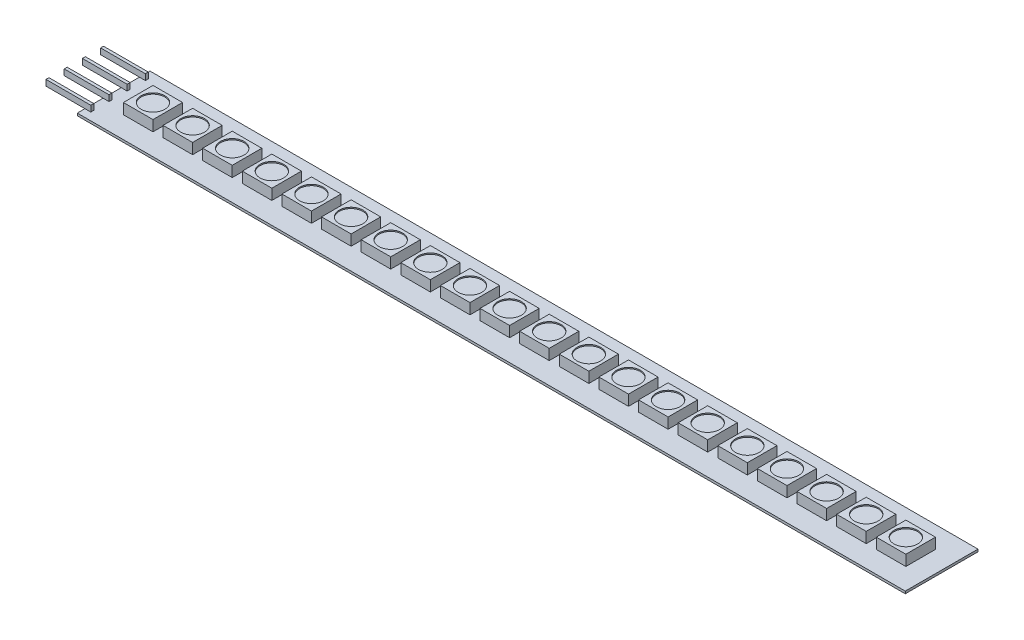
ISO-10303-21;
HEADER;
FILE_DESCRIPTION(('STEP AP214'),'2;1');
FILE_NAME('part.step','',(''),(''),'','','');
FILE_SCHEMA(('AUTOMOTIVE_DESIGN { 1 0 10303 214 1 1 1 1 }'));
ENDSEC;
DATA;
#1=APPLICATION_CONTEXT('core data for automotive mechanical design processes');
#2=APPLICATION_PROTOCOL_DEFINITION('international standard','automotive_design',2000,#1);
#3=PRODUCT_CONTEXT('',#1,'mechanical');
#4=PRODUCT('Part','Part','',(#3));
#5=PRODUCT_RELATED_PRODUCT_CATEGORY('part','',(#4));
#6=PRODUCT_DEFINITION_FORMATION('','',#4);
#7=PRODUCT_DEFINITION_CONTEXT('part definition',#1,'design');
#8=PRODUCT_DEFINITION('design','',#6,#7);
#9=PRODUCT_DEFINITION_SHAPE('','',#8);
#10=(LENGTH_UNIT() NAMED_UNIT(*) SI_UNIT(.MILLI.,.METRE.));
#11=(NAMED_UNIT(*) PLANE_ANGLE_UNIT() SI_UNIT($,.RADIAN.));
#12=(NAMED_UNIT(*) SI_UNIT($,.STERADIAN.) SOLID_ANGLE_UNIT());
#13=UNCERTAINTY_MEASURE_WITH_UNIT(LENGTH_MEASURE(1.E-05),#10,'distance_accuracy_value','');
#14=(GEOMETRIC_REPRESENTATION_CONTEXT(3) GLOBAL_UNCERTAINTY_ASSIGNED_CONTEXT((#13)) GLOBAL_UNIT_ASSIGNED_CONTEXT((#10,
#11,#12)) REPRESENTATION_CONTEXT('',''));
#15=CARTESIAN_POINT('',(0.,0.,0.));
#16=DIRECTION('',(0.,0.,1.));
#17=DIRECTION('',(1.,0.,0.));
#18=AXIS2_PLACEMENT_3D('',#15,#16,#17);
#19=CARTESIAN_POINT('',(0.,0.4,0.));
#20=DIRECTION('',(0.,-1.,0.));
#21=DIRECTION('',(0.,0.,-1.));
#22=AXIS2_PLACEMENT_3D('',#19,#20,#21);
#23=PLANE('',#22);
#24=DIRECTION('',(0.,0.,-1.));
#25=VECTOR('',#24,1.);
#26=CARTESIAN_POINT('',(9.15000000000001,0.4,-3.65));
#27=LINE('',#26,#25);
#28=CARTESIAN_POINT('',(9.15000000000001,0.4,-3.65));
#29=VERTEX_POINT('',#28);
#30=CARTESIAN_POINT('',(9.15000000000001,0.4,-8.65));
#31=VERTEX_POINT('',#30);
#32=EDGE_CURVE('E952',#29,#31,#27,.T.);
#33=ORIENTED_EDGE('',*,*,#32,.F.);
#34=DIRECTION('',(-1.,0.,0.));
#35=VECTOR('',#34,1.);
#36=CARTESIAN_POINT('',(9.15000000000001,0.4,-3.65));
#37=LINE('',#36,#35);
#38=CARTESIAN_POINT('',(4.15000000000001,0.4,-3.65));
#39=VERTEX_POINT('',#38);
#40=EDGE_CURVE('E960',#29,#39,#37,.T.);
#41=ORIENTED_EDGE('',*,*,#40,.T.);
#42=DIRECTION('',(0.,0.,-1.));
#43=VECTOR('',#42,1.);
#44=CARTESIAN_POINT('',(4.15000000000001,0.4,-3.65));
#45=LINE('',#44,#43);
#46=CARTESIAN_POINT('',(4.15000000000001,0.4,-8.65000000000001));
#47=VERTEX_POINT('',#46);
#48=EDGE_CURVE('E957',#39,#47,#45,.T.);
#49=ORIENTED_EDGE('',*,*,#48,.T.);
#50=DIRECTION('',(-1.,0.,0.));
#51=VECTOR('',#50,1.);
#52=CARTESIAN_POINT('',(9.15000000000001,0.4,-8.65));
#53=LINE('',#52,#51);
#54=EDGE_CURVE('E954',#31,#47,#53,.T.);
#55=ORIENTED_EDGE('',*,*,#54,.F.);
#56=EDGE_LOOP('',(#33,#41,#49,#55));
#57=FACE_BOUND('',#56,.T.);
#58=DIRECTION('',(0.,0.,-1.));
#59=VECTOR('',#58,1.);
#60=CARTESIAN_POINT('',(131.45,0.4,0.));
#61=LINE('',#60,#59);
#62=CARTESIAN_POINT('',(131.45,0.4,-3.65));
#63=VERTEX_POINT('',#62);
#64=CARTESIAN_POINT('',(131.45,0.4,-8.65));
#65=VERTEX_POINT('',#64);
#66=EDGE_CURVE('E991',#63,#65,#61,.T.);
#67=ORIENTED_EDGE('',*,*,#66,.T.);
#68=DIRECTION('',(1.,0.,0.));
#69=VECTOR('',#68,1.);
#70=CARTESIAN_POINT('',(0.,0.4,-8.65));
#71=LINE('',#70,#69);
#72=CARTESIAN_POINT('',(136.45,0.4,-8.65));
#73=VERTEX_POINT('',#72);
#74=EDGE_CURVE('E993',#65,#73,#71,.T.);
#75=ORIENTED_EDGE('',*,*,#74,.T.);
#76=DIRECTION('',(0.,0.,-1.));
#77=VECTOR('',#76,1.);
#78=CARTESIAN_POINT('',(136.45,0.4,0.));
#79=LINE('',#78,#77);
#80=CARTESIAN_POINT('',(136.45,0.4,-3.65));
#81=VERTEX_POINT('',#80);
#82=EDGE_CURVE('E984',#81,#73,#79,.T.);
#83=ORIENTED_EDGE('',*,*,#82,.F.);
#84=DIRECTION('',(1.,0.,0.));
#85=VECTOR('',#84,1.);
#86=CARTESIAN_POINT('',(0.,0.4,-3.65));
#87=LINE('',#86,#85);
#88=EDGE_CURVE('E987',#63,#81,#87,.T.);
#89=ORIENTED_EDGE('',*,*,#88,.F.);
#90=EDGE_LOOP('',(#67,#75,#83,#89));
#91=FACE_BOUND('',#90,.T.);
#92=DIRECTION('',(0.,0.,-1.));
#93=VECTOR('',#92,1.);
#94=CARTESIAN_POINT('',(124.75,0.4,0.));
#95=LINE('',#94,#93);
#96=CARTESIAN_POINT('',(124.75,0.4,-3.65));
#97=VERTEX_POINT('',#96);
#98=CARTESIAN_POINT('',(124.75,0.4,-8.65));
#99=VERTEX_POINT('',#98);
#100=EDGE_CURVE('E1023',#97,#99,#95,.T.);
#101=ORIENTED_EDGE('',*,*,#100,.T.);
#102=DIRECTION('',(1.,0.,0.));
#103=VECTOR('',#102,1.);
#104=CARTESIAN_POINT('',(0.,0.4,-8.65));
#105=LINE('',#104,#103);
#106=CARTESIAN_POINT('',(129.75,0.4,-8.65));
#107=VERTEX_POINT('',#106);
#108=EDGE_CURVE('E1025',#99,#107,#105,.T.);
#109=ORIENTED_EDGE('',*,*,#108,.T.);
#110=DIRECTION('',(0.,0.,-1.));
#111=VECTOR('',#110,1.);
#112=CARTESIAN_POINT('',(129.75,0.4,0.));
#113=LINE('',#112,#111);
#114=CARTESIAN_POINT('',(129.75,0.4,-3.65));
#115=VERTEX_POINT('',#114);
#116=EDGE_CURVE('E1016',#115,#107,#113,.T.);
#117=ORIENTED_EDGE('',*,*,#116,.F.);
#118=DIRECTION('',(1.,0.,0.));
#119=VECTOR('',#118,1.);
#120=CARTESIAN_POINT('',(0.,0.4,-3.65));
#121=LINE('',#120,#119);
#122=EDGE_CURVE('E1019',#97,#115,#121,.T.);
#123=ORIENTED_EDGE('',*,*,#122,.F.);
#124=EDGE_LOOP('',(#101,#109,#117,#123));
#125=FACE_BOUND('',#124,.T.);
#126=DIRECTION('',(0.,0.,-1.));
#127=VECTOR('',#126,1.);
#128=CARTESIAN_POINT('',(118.05,0.4,0.));
#129=LINE('',#128,#127);
#130=CARTESIAN_POINT('',(118.05,0.4,-3.65));
#131=VERTEX_POINT('',#130);
#132=CARTESIAN_POINT('',(118.05,0.4,-8.65));
#133=VERTEX_POINT('',#132);
#134=EDGE_CURVE('E1055',#131,#133,#129,.T.);
#135=ORIENTED_EDGE('',*,*,#134,.T.);
#136=DIRECTION('',(1.,0.,0.));
#137=VECTOR('',#136,1.);
#138=CARTESIAN_POINT('',(0.,0.4,-8.65));
#139=LINE('',#138,#137);
#140=CARTESIAN_POINT('',(123.05,0.4,-8.65));
#141=VERTEX_POINT('',#140);
#142=EDGE_CURVE('E1057',#133,#141,#139,.T.);
#143=ORIENTED_EDGE('',*,*,#142,.T.);
#144=DIRECTION('',(0.,0.,-1.));
#145=VECTOR('',#144,1.);
#146=CARTESIAN_POINT('',(123.05,0.4,0.));
#147=LINE('',#146,#145);
#148=CARTESIAN_POINT('',(123.05,0.4,-3.65));
#149=VERTEX_POINT('',#148);
#150=EDGE_CURVE('E1048',#149,#141,#147,.T.);
#151=ORIENTED_EDGE('',*,*,#150,.F.);
#152=DIRECTION('',(1.,0.,0.));
#153=VECTOR('',#152,1.);
#154=CARTESIAN_POINT('',(0.,0.4,-3.65));
#155=LINE('',#154,#153);
#156=EDGE_CURVE('E1051',#131,#149,#155,.T.);
#157=ORIENTED_EDGE('',*,*,#156,.F.);
#158=EDGE_LOOP('',(#135,#143,#151,#157));
#159=FACE_BOUND('',#158,.T.);
#160=DIRECTION('',(0.,0.,-1.));
#161=VECTOR('',#160,1.);
#162=CARTESIAN_POINT('',(111.35,0.4,0.));
#163=LINE('',#162,#161);
#164=CARTESIAN_POINT('',(111.35,0.4,-3.65));
#165=VERTEX_POINT('',#164);
#166=CARTESIAN_POINT('',(111.35,0.4,-8.65));
#167=VERTEX_POINT('',#166);
#168=EDGE_CURVE('E1087',#165,#167,#163,.T.);
#169=ORIENTED_EDGE('',*,*,#168,.T.);
#170=DIRECTION('',(1.,0.,0.));
#171=VECTOR('',#170,1.);
#172=CARTESIAN_POINT('',(0.,0.4,-8.65));
#173=LINE('',#172,#171);
#174=CARTESIAN_POINT('',(116.35,0.4,-8.65));
#175=VERTEX_POINT('',#174);
#176=EDGE_CURVE('E1089',#167,#175,#173,.T.);
#177=ORIENTED_EDGE('',*,*,#176,.T.);
#178=DIRECTION('',(0.,0.,-1.));
#179=VECTOR('',#178,1.);
#180=CARTESIAN_POINT('',(116.35,0.4,0.));
#181=LINE('',#180,#179);
#182=CARTESIAN_POINT('',(116.35,0.4,-3.65));
#183=VERTEX_POINT('',#182);
#184=EDGE_CURVE('E1080',#183,#175,#181,.T.);
#185=ORIENTED_EDGE('',*,*,#184,.F.);
#186=DIRECTION('',(1.,0.,0.));
#187=VECTOR('',#186,1.);
#188=CARTESIAN_POINT('',(0.,0.4,-3.65));
#189=LINE('',#188,#187);
#190=EDGE_CURVE('E1083',#165,#183,#189,.T.);
#191=ORIENTED_EDGE('',*,*,#190,.F.);
#192=EDGE_LOOP('',(#169,#177,#185,#191));
#193=FACE_BOUND('',#192,.T.);
#194=DIRECTION('',(0.,0.,-1.));
#195=VECTOR('',#194,1.);
#196=CARTESIAN_POINT('',(104.65,0.4,0.));
#197=LINE('',#196,#195);
#198=CARTESIAN_POINT('',(104.65,0.4,-3.65));
#199=VERTEX_POINT('',#198);
#200=CARTESIAN_POINT('',(104.65,0.4,-8.65));
#201=VERTEX_POINT('',#200);
#202=EDGE_CURVE('E1119',#199,#201,#197,.T.);
#203=ORIENTED_EDGE('',*,*,#202,.T.);
#204=DIRECTION('',(1.,0.,0.));
#205=VECTOR('',#204,1.);
#206=CARTESIAN_POINT('',(0.,0.4,-8.65));
#207=LINE('',#206,#205);
#208=CARTESIAN_POINT('',(109.65,0.4,-8.65));
#209=VERTEX_POINT('',#208);
#210=EDGE_CURVE('E1121',#201,#209,#207,.T.);
#211=ORIENTED_EDGE('',*,*,#210,.T.);
#212=DIRECTION('',(0.,0.,-1.));
#213=VECTOR('',#212,1.);
#214=CARTESIAN_POINT('',(109.65,0.4,0.));
#215=LINE('',#214,#213);
#216=CARTESIAN_POINT('',(109.65,0.4,-3.65));
#217=VERTEX_POINT('',#216);
#218=EDGE_CURVE('E1112',#217,#209,#215,.T.);
#219=ORIENTED_EDGE('',*,*,#218,.F.);
#220=DIRECTION('',(1.,0.,0.));
#221=VECTOR('',#220,1.);
#222=CARTESIAN_POINT('',(0.,0.4,-3.65));
#223=LINE('',#222,#221);
#224=EDGE_CURVE('E1115',#199,#217,#223,.T.);
#225=ORIENTED_EDGE('',*,*,#224,.F.);
#226=EDGE_LOOP('',(#203,#211,#219,#225));
#227=FACE_BOUND('',#226,.T.);
#228=DIRECTION('',(0.,0.,-1.));
#229=VECTOR('',#228,1.);
#230=CARTESIAN_POINT('',(97.95,0.4,0.));
#231=LINE('',#230,#229);
#232=CARTESIAN_POINT('',(97.95,0.4,-3.65));
#233=VERTEX_POINT('',#232);
#234=CARTESIAN_POINT('',(97.95,0.4,-8.65));
#235=VERTEX_POINT('',#234);
#236=EDGE_CURVE('E1151',#233,#235,#231,.T.);
#237=ORIENTED_EDGE('',*,*,#236,.T.);
#238=DIRECTION('',(1.,0.,0.));
#239=VECTOR('',#238,1.);
#240=CARTESIAN_POINT('',(0.,0.4,-8.65));
#241=LINE('',#240,#239);
#242=CARTESIAN_POINT('',(102.95,0.4,-8.65));
#243=VERTEX_POINT('',#242);
#244=EDGE_CURVE('E1153',#235,#243,#241,.T.);
#245=ORIENTED_EDGE('',*,*,#244,.T.);
#246=DIRECTION('',(0.,0.,-1.));
#247=VECTOR('',#246,1.);
#248=CARTESIAN_POINT('',(102.95,0.4,0.));
#249=LINE('',#248,#247);
#250=CARTESIAN_POINT('',(102.95,0.4,-3.65));
#251=VERTEX_POINT('',#250);
#252=EDGE_CURVE('E1144',#251,#243,#249,.T.);
#253=ORIENTED_EDGE('',*,*,#252,.F.);
#254=DIRECTION('',(1.,0.,0.));
#255=VECTOR('',#254,1.);
#256=CARTESIAN_POINT('',(0.,0.4,-3.65));
#257=LINE('',#256,#255);
#258=EDGE_CURVE('E1147',#233,#251,#257,.T.);
#259=ORIENTED_EDGE('',*,*,#258,.F.);
#260=EDGE_LOOP('',(#237,#245,#253,#259));
#261=FACE_BOUND('',#260,.T.);
#262=DIRECTION('',(0.,0.,-1.));
#263=VECTOR('',#262,1.);
#264=CARTESIAN_POINT('',(91.25,0.4,0.));
#265=LINE('',#264,#263);
#266=CARTESIAN_POINT('',(91.25,0.4,-3.65));
#267=VERTEX_POINT('',#266);
#268=CARTESIAN_POINT('',(91.25,0.4,-8.65));
#269=VERTEX_POINT('',#268);
#270=EDGE_CURVE('E1183',#267,#269,#265,.T.);
#271=ORIENTED_EDGE('',*,*,#270,.T.);
#272=DIRECTION('',(1.,0.,0.));
#273=VECTOR('',#272,1.);
#274=CARTESIAN_POINT('',(0.,0.4,-8.65));
#275=LINE('',#274,#273);
#276=CARTESIAN_POINT('',(96.25,0.4,-8.65));
#277=VERTEX_POINT('',#276);
#278=EDGE_CURVE('E1185',#269,#277,#275,.T.);
#279=ORIENTED_EDGE('',*,*,#278,.T.);
#280=DIRECTION('',(0.,0.,-1.));
#281=VECTOR('',#280,1.);
#282=CARTESIAN_POINT('',(96.25,0.4,0.));
#283=LINE('',#282,#281);
#284=CARTESIAN_POINT('',(96.25,0.4,-3.65));
#285=VERTEX_POINT('',#284);
#286=EDGE_CURVE('E1176',#285,#277,#283,.T.);
#287=ORIENTED_EDGE('',*,*,#286,.F.);
#288=DIRECTION('',(1.,0.,0.));
#289=VECTOR('',#288,1.);
#290=CARTESIAN_POINT('',(0.,0.4,-3.65));
#291=LINE('',#290,#289);
#292=EDGE_CURVE('E1179',#267,#285,#291,.T.);
#293=ORIENTED_EDGE('',*,*,#292,.F.);
#294=EDGE_LOOP('',(#271,#279,#287,#293));
#295=FACE_BOUND('',#294,.T.);
#296=DIRECTION('',(0.,0.,-1.));
#297=VECTOR('',#296,1.);
#298=CARTESIAN_POINT('',(84.55,0.4,0.));
#299=LINE('',#298,#297);
#300=CARTESIAN_POINT('',(84.55,0.4,-3.65));
#301=VERTEX_POINT('',#300);
#302=CARTESIAN_POINT('',(84.55,0.4,-8.65));
#303=VERTEX_POINT('',#302);
#304=EDGE_CURVE('E1215',#301,#303,#299,.T.);
#305=ORIENTED_EDGE('',*,*,#304,.T.);
#306=DIRECTION('',(1.,0.,0.));
#307=VECTOR('',#306,1.);
#308=CARTESIAN_POINT('',(0.,0.4,-8.65));
#309=LINE('',#308,#307);
#310=CARTESIAN_POINT('',(89.55,0.4,-8.65));
#311=VERTEX_POINT('',#310);
#312=EDGE_CURVE('E1217',#303,#311,#309,.T.);
#313=ORIENTED_EDGE('',*,*,#312,.T.);
#314=DIRECTION('',(0.,0.,-1.));
#315=VECTOR('',#314,1.);
#316=CARTESIAN_POINT('',(89.55,0.4,0.));
#317=LINE('',#316,#315);
#318=CARTESIAN_POINT('',(89.55,0.4,-3.65));
#319=VERTEX_POINT('',#318);
#320=EDGE_CURVE('E1208',#319,#311,#317,.T.);
#321=ORIENTED_EDGE('',*,*,#320,.F.);
#322=DIRECTION('',(1.,0.,0.));
#323=VECTOR('',#322,1.);
#324=CARTESIAN_POINT('',(0.,0.4,-3.65));
#325=LINE('',#324,#323);
#326=EDGE_CURVE('E1211',#301,#319,#325,.T.);
#327=ORIENTED_EDGE('',*,*,#326,.F.);
#328=EDGE_LOOP('',(#305,#313,#321,#327));
#329=FACE_BOUND('',#328,.T.);
#330=DIRECTION('',(0.,0.,-1.));
#331=VECTOR('',#330,1.);
#332=CARTESIAN_POINT('',(77.85,0.4,0.));
#333=LINE('',#332,#331);
#334=CARTESIAN_POINT('',(77.85,0.4,-3.65));
#335=VERTEX_POINT('',#334);
#336=CARTESIAN_POINT('',(77.85,0.4,-8.65));
#337=VERTEX_POINT('',#336);
#338=EDGE_CURVE('E1247',#335,#337,#333,.T.);
#339=ORIENTED_EDGE('',*,*,#338,.T.);
#340=DIRECTION('',(1.,0.,0.));
#341=VECTOR('',#340,1.);
#342=CARTESIAN_POINT('',(0.,0.4,-8.65));
#343=LINE('',#342,#341);
#344=CARTESIAN_POINT('',(82.85,0.4,-8.65));
#345=VERTEX_POINT('',#344);
#346=EDGE_CURVE('E1249',#337,#345,#343,.T.);
#347=ORIENTED_EDGE('',*,*,#346,.T.);
#348=DIRECTION('',(0.,0.,-1.));
#349=VECTOR('',#348,1.);
#350=CARTESIAN_POINT('',(82.85,0.4,0.));
#351=LINE('',#350,#349);
#352=CARTESIAN_POINT('',(82.85,0.4,-3.65));
#353=VERTEX_POINT('',#352);
#354=EDGE_CURVE('E1240',#353,#345,#351,.T.);
#355=ORIENTED_EDGE('',*,*,#354,.F.);
#356=DIRECTION('',(1.,0.,0.));
#357=VECTOR('',#356,1.);
#358=CARTESIAN_POINT('',(0.,0.4,-3.65));
#359=LINE('',#358,#357);
#360=EDGE_CURVE('E1243',#335,#353,#359,.T.);
#361=ORIENTED_EDGE('',*,*,#360,.F.);
#362=EDGE_LOOP('',(#339,#347,#355,#361));
#363=FACE_BOUND('',#362,.T.);
#364=DIRECTION('',(0.,0.,-1.));
#365=VECTOR('',#364,1.);
#366=CARTESIAN_POINT('',(71.15,0.4,0.));
#367=LINE('',#366,#365);
#368=CARTESIAN_POINT('',(71.15,0.4,-3.65));
#369=VERTEX_POINT('',#368);
#370=CARTESIAN_POINT('',(71.15,0.4,-8.65));
#371=VERTEX_POINT('',#370);
#372=EDGE_CURVE('E1279',#369,#371,#367,.T.);
#373=ORIENTED_EDGE('',*,*,#372,.T.);
#374=DIRECTION('',(1.,0.,0.));
#375=VECTOR('',#374,1.);
#376=CARTESIAN_POINT('',(0.,0.4,-8.65));
#377=LINE('',#376,#375);
#378=CARTESIAN_POINT('',(76.15,0.4,-8.65));
#379=VERTEX_POINT('',#378);
#380=EDGE_CURVE('E1281',#371,#379,#377,.T.);
#381=ORIENTED_EDGE('',*,*,#380,.T.);
#382=DIRECTION('',(0.,0.,-1.));
#383=VECTOR('',#382,1.);
#384=CARTESIAN_POINT('',(76.15,0.4,0.));
#385=LINE('',#384,#383);
#386=CARTESIAN_POINT('',(76.15,0.4,-3.65));
#387=VERTEX_POINT('',#386);
#388=EDGE_CURVE('E1272',#387,#379,#385,.T.);
#389=ORIENTED_EDGE('',*,*,#388,.F.);
#390=DIRECTION('',(1.,0.,0.));
#391=VECTOR('',#390,1.);
#392=CARTESIAN_POINT('',(0.,0.4,-3.65));
#393=LINE('',#392,#391);
#394=EDGE_CURVE('E1275',#369,#387,#393,.T.);
#395=ORIENTED_EDGE('',*,*,#394,.F.);
#396=EDGE_LOOP('',(#373,#381,#389,#395));
#397=FACE_BOUND('',#396,.T.);
#398=DIRECTION('',(0.,0.,-1.));
#399=VECTOR('',#398,1.);
#400=CARTESIAN_POINT('',(64.45,0.4,0.));
#401=LINE('',#400,#399);
#402=CARTESIAN_POINT('',(64.45,0.4,-3.65));
#403=VERTEX_POINT('',#402);
#404=CARTESIAN_POINT('',(64.45,0.4,-8.65));
#405=VERTEX_POINT('',#404);
#406=EDGE_CURVE('E1311',#403,#405,#401,.T.);
#407=ORIENTED_EDGE('',*,*,#406,.T.);
#408=DIRECTION('',(1.,0.,0.));
#409=VECTOR('',#408,1.);
#410=CARTESIAN_POINT('',(0.,0.4,-8.65));
#411=LINE('',#410,#409);
#412=CARTESIAN_POINT('',(69.45,0.4,-8.65));
#413=VERTEX_POINT('',#412);
#414=EDGE_CURVE('E1313',#405,#413,#411,.T.);
#415=ORIENTED_EDGE('',*,*,#414,.T.);
#416=DIRECTION('',(0.,0.,-1.));
#417=VECTOR('',#416,1.);
#418=CARTESIAN_POINT('',(69.45,0.4,0.));
#419=LINE('',#418,#417);
#420=CARTESIAN_POINT('',(69.45,0.4,-3.65));
#421=VERTEX_POINT('',#420);
#422=EDGE_CURVE('E1304',#421,#413,#419,.T.);
#423=ORIENTED_EDGE('',*,*,#422,.F.);
#424=DIRECTION('',(1.,0.,0.));
#425=VECTOR('',#424,1.);
#426=CARTESIAN_POINT('',(0.,0.4,-3.65));
#427=LINE('',#426,#425);
#428=EDGE_CURVE('E1307',#403,#421,#427,.T.);
#429=ORIENTED_EDGE('',*,*,#428,.F.);
#430=EDGE_LOOP('',(#407,#415,#423,#429));
#431=FACE_BOUND('',#430,.T.);
#432=DIRECTION('',(0.,0.,-1.));
#433=VECTOR('',#432,1.);
#434=CARTESIAN_POINT('',(57.75,0.4,0.));
#435=LINE('',#434,#433);
#436=CARTESIAN_POINT('',(57.75,0.4,-3.65));
#437=VERTEX_POINT('',#436);
#438=CARTESIAN_POINT('',(57.75,0.4,-8.65));
#439=VERTEX_POINT('',#438);
#440=EDGE_CURVE('E1343',#437,#439,#435,.T.);
#441=ORIENTED_EDGE('',*,*,#440,.T.);
#442=DIRECTION('',(1.,0.,0.));
#443=VECTOR('',#442,1.);
#444=CARTESIAN_POINT('',(0.,0.4,-8.65));
#445=LINE('',#444,#443);
#446=CARTESIAN_POINT('',(62.75,0.4,-8.65));
#447=VERTEX_POINT('',#446);
#448=EDGE_CURVE('E1345',#439,#447,#445,.T.);
#449=ORIENTED_EDGE('',*,*,#448,.T.);
#450=DIRECTION('',(0.,0.,-1.));
#451=VECTOR('',#450,1.);
#452=CARTESIAN_POINT('',(62.75,0.4,0.));
#453=LINE('',#452,#451);
#454=CARTESIAN_POINT('',(62.75,0.4,-3.65));
#455=VERTEX_POINT('',#454);
#456=EDGE_CURVE('E1336',#455,#447,#453,.T.);
#457=ORIENTED_EDGE('',*,*,#456,.F.);
#458=DIRECTION('',(1.,0.,0.));
#459=VECTOR('',#458,1.);
#460=CARTESIAN_POINT('',(0.,0.4,-3.65));
#461=LINE('',#460,#459);
#462=EDGE_CURVE('E1339',#437,#455,#461,.T.);
#463=ORIENTED_EDGE('',*,*,#462,.F.);
#464=EDGE_LOOP('',(#441,#449,#457,#463));
#465=FACE_BOUND('',#464,.T.);
#466=DIRECTION('',(0.,0.,-1.));
#467=VECTOR('',#466,1.);
#468=CARTESIAN_POINT('',(51.05,0.4,0.));
#469=LINE('',#468,#467);
#470=CARTESIAN_POINT('',(51.05,0.4,-3.65));
#471=VERTEX_POINT('',#470);
#472=CARTESIAN_POINT('',(51.05,0.4,-8.65));
#473=VERTEX_POINT('',#472);
#474=EDGE_CURVE('E1375',#471,#473,#469,.T.);
#475=ORIENTED_EDGE('',*,*,#474,.T.);
#476=DIRECTION('',(1.,0.,0.));
#477=VECTOR('',#476,1.);
#478=CARTESIAN_POINT('',(0.,0.4,-8.65));
#479=LINE('',#478,#477);
#480=CARTESIAN_POINT('',(56.05,0.4,-8.65));
#481=VERTEX_POINT('',#480);
#482=EDGE_CURVE('E1377',#473,#481,#479,.T.);
#483=ORIENTED_EDGE('',*,*,#482,.T.);
#484=DIRECTION('',(0.,0.,-1.));
#485=VECTOR('',#484,1.);
#486=CARTESIAN_POINT('',(56.05,0.4,0.));
#487=LINE('',#486,#485);
#488=CARTESIAN_POINT('',(56.05,0.4,-3.65));
#489=VERTEX_POINT('',#488);
#490=EDGE_CURVE('E1368',#489,#481,#487,.T.);
#491=ORIENTED_EDGE('',*,*,#490,.F.);
#492=DIRECTION('',(1.,0.,0.));
#493=VECTOR('',#492,1.);
#494=CARTESIAN_POINT('',(0.,0.4,-3.65));
#495=LINE('',#494,#493);
#496=EDGE_CURVE('E1371',#471,#489,#495,.T.);
#497=ORIENTED_EDGE('',*,*,#496,.F.);
#498=EDGE_LOOP('',(#475,#483,#491,#497));
#499=FACE_BOUND('',#498,.T.);
#500=DIRECTION('',(0.,0.,-1.));
#501=VECTOR('',#500,1.);
#502=CARTESIAN_POINT('',(44.35,0.4,0.));
#503=LINE('',#502,#501);
#504=CARTESIAN_POINT('',(44.35,0.4,-3.65));
#505=VERTEX_POINT('',#504);
#506=CARTESIAN_POINT('',(44.35,0.4,-8.65));
#507=VERTEX_POINT('',#506);
#508=EDGE_CURVE('E1407',#505,#507,#503,.T.);
#509=ORIENTED_EDGE('',*,*,#508,.T.);
#510=DIRECTION('',(1.,0.,0.));
#511=VECTOR('',#510,1.);
#512=CARTESIAN_POINT('',(0.,0.4,-8.65));
#513=LINE('',#512,#511);
#514=CARTESIAN_POINT('',(49.35,0.4,-8.65));
#515=VERTEX_POINT('',#514);
#516=EDGE_CURVE('E1409',#507,#515,#513,.T.);
#517=ORIENTED_EDGE('',*,*,#516,.T.);
#518=DIRECTION('',(0.,0.,-1.));
#519=VECTOR('',#518,1.);
#520=CARTESIAN_POINT('',(49.35,0.4,0.));
#521=LINE('',#520,#519);
#522=CARTESIAN_POINT('',(49.35,0.4,-3.65));
#523=VERTEX_POINT('',#522);
#524=EDGE_CURVE('E1400',#523,#515,#521,.T.);
#525=ORIENTED_EDGE('',*,*,#524,.F.);
#526=DIRECTION('',(1.,0.,0.));
#527=VECTOR('',#526,1.);
#528=CARTESIAN_POINT('',(0.,0.4,-3.65));
#529=LINE('',#528,#527);
#530=EDGE_CURVE('E1403',#505,#523,#529,.T.);
#531=ORIENTED_EDGE('',*,*,#530,.F.);
#532=EDGE_LOOP('',(#509,#517,#525,#531));
#533=FACE_BOUND('',#532,.T.);
#534=DIRECTION('',(0.,0.,-1.));
#535=VECTOR('',#534,1.);
#536=CARTESIAN_POINT('',(37.65,0.4,0.));
#537=LINE('',#536,#535);
#538=CARTESIAN_POINT('',(37.65,0.4,-3.65));
#539=VERTEX_POINT('',#538);
#540=CARTESIAN_POINT('',(37.65,0.4,-8.65));
#541=VERTEX_POINT('',#540);
#542=EDGE_CURVE('E1439',#539,#541,#537,.T.);
#543=ORIENTED_EDGE('',*,*,#542,.T.);
#544=DIRECTION('',(1.,0.,0.));
#545=VECTOR('',#544,1.);
#546=CARTESIAN_POINT('',(0.,0.4,-8.65));
#547=LINE('',#546,#545);
#548=CARTESIAN_POINT('',(42.65,0.4,-8.65));
#549=VERTEX_POINT('',#548);
#550=EDGE_CURVE('E1441',#541,#549,#547,.T.);
#551=ORIENTED_EDGE('',*,*,#550,.T.);
#552=DIRECTION('',(0.,0.,-1.));
#553=VECTOR('',#552,1.);
#554=CARTESIAN_POINT('',(42.65,0.4,0.));
#555=LINE('',#554,#553);
#556=CARTESIAN_POINT('',(42.65,0.4,-3.65));
#557=VERTEX_POINT('',#556);
#558=EDGE_CURVE('E1432',#557,#549,#555,.T.);
#559=ORIENTED_EDGE('',*,*,#558,.F.);
#560=DIRECTION('',(1.,0.,0.));
#561=VECTOR('',#560,1.);
#562=CARTESIAN_POINT('',(0.,0.4,-3.65));
#563=LINE('',#562,#561);
#564=EDGE_CURVE('E1435',#539,#557,#563,.T.);
#565=ORIENTED_EDGE('',*,*,#564,.F.);
#566=EDGE_LOOP('',(#543,#551,#559,#565));
#567=FACE_BOUND('',#566,.T.);
#568=DIRECTION('',(0.,0.,-1.));
#569=VECTOR('',#568,1.);
#570=CARTESIAN_POINT('',(30.95,0.4,0.));
#571=LINE('',#570,#569);
#572=CARTESIAN_POINT('',(30.95,0.4,-3.65));
#573=VERTEX_POINT('',#572);
#574=CARTESIAN_POINT('',(30.95,0.4,-8.65));
#575=VERTEX_POINT('',#574);
#576=EDGE_CURVE('E1471',#573,#575,#571,.T.);
#577=ORIENTED_EDGE('',*,*,#576,.T.);
#578=DIRECTION('',(1.,0.,0.));
#579=VECTOR('',#578,1.);
#580=CARTESIAN_POINT('',(0.,0.4,-8.65));
#581=LINE('',#580,#579);
#582=CARTESIAN_POINT('',(35.95,0.4,-8.65));
#583=VERTEX_POINT('',#582);
#584=EDGE_CURVE('E1473',#575,#583,#581,.T.);
#585=ORIENTED_EDGE('',*,*,#584,.T.);
#586=DIRECTION('',(0.,0.,-1.));
#587=VECTOR('',#586,1.);
#588=CARTESIAN_POINT('',(35.95,0.4,0.));
#589=LINE('',#588,#587);
#590=CARTESIAN_POINT('',(35.95,0.4,-3.65));
#591=VERTEX_POINT('',#590);
#592=EDGE_CURVE('E1464',#591,#583,#589,.T.);
#593=ORIENTED_EDGE('',*,*,#592,.F.);
#594=DIRECTION('',(1.,0.,0.));
#595=VECTOR('',#594,1.);
#596=CARTESIAN_POINT('',(0.,0.4,-3.65));
#597=LINE('',#596,#595);
#598=EDGE_CURVE('E1467',#573,#591,#597,.T.);
#599=ORIENTED_EDGE('',*,*,#598,.F.);
#600=EDGE_LOOP('',(#577,#585,#593,#599));
#601=FACE_BOUND('',#600,.T.);
#602=DIRECTION('',(0.,0.,-1.));
#603=VECTOR('',#602,1.);
#604=CARTESIAN_POINT('',(24.25,0.4,0.));
#605=LINE('',#604,#603);
#606=CARTESIAN_POINT('',(24.25,0.4,-3.65));
#607=VERTEX_POINT('',#606);
#608=CARTESIAN_POINT('',(24.25,0.4,-8.65));
#609=VERTEX_POINT('',#608);
#610=EDGE_CURVE('E1503',#607,#609,#605,.T.);
#611=ORIENTED_EDGE('',*,*,#610,.T.);
#612=DIRECTION('',(1.,0.,0.));
#613=VECTOR('',#612,1.);
#614=CARTESIAN_POINT('',(0.,0.4,-8.65));
#615=LINE('',#614,#613);
#616=CARTESIAN_POINT('',(29.25,0.4,-8.65));
#617=VERTEX_POINT('',#616);
#618=EDGE_CURVE('E1505',#609,#617,#615,.T.);
#619=ORIENTED_EDGE('',*,*,#618,.T.);
#620=DIRECTION('',(0.,0.,-1.));
#621=VECTOR('',#620,1.);
#622=CARTESIAN_POINT('',(29.25,0.4,0.));
#623=LINE('',#622,#621);
#624=CARTESIAN_POINT('',(29.25,0.4,-3.65));
#625=VERTEX_POINT('',#624);
#626=EDGE_CURVE('E1496',#625,#617,#623,.T.);
#627=ORIENTED_EDGE('',*,*,#626,.F.);
#628=DIRECTION('',(1.,0.,0.));
#629=VECTOR('',#628,1.);
#630=CARTESIAN_POINT('',(0.,0.4,-3.65));
#631=LINE('',#630,#629);
#632=EDGE_CURVE('E1499',#607,#625,#631,.T.);
#633=ORIENTED_EDGE('',*,*,#632,.F.);
#634=EDGE_LOOP('',(#611,#619,#627,#633));
#635=FACE_BOUND('',#634,.T.);
#636=DIRECTION('',(0.,0.,-1.));
#637=VECTOR('',#636,1.);
#638=CARTESIAN_POINT('',(17.55,0.4,0.));
#639=LINE('',#638,#637);
#640=CARTESIAN_POINT('',(17.55,0.4,-3.65));
#641=VERTEX_POINT('',#640);
#642=CARTESIAN_POINT('',(17.55,0.4,-8.65));
#643=VERTEX_POINT('',#642);
#644=EDGE_CURVE('E1535',#641,#643,#639,.T.);
#645=ORIENTED_EDGE('',*,*,#644,.T.);
#646=DIRECTION('',(1.,0.,0.));
#647=VECTOR('',#646,1.);
#648=CARTESIAN_POINT('',(0.,0.4,-8.65));
#649=LINE('',#648,#647);
#650=CARTESIAN_POINT('',(22.55,0.4,-8.65));
#651=VERTEX_POINT('',#650);
#652=EDGE_CURVE('E1537',#643,#651,#649,.T.);
#653=ORIENTED_EDGE('',*,*,#652,.T.);
#654=DIRECTION('',(0.,0.,-1.));
#655=VECTOR('',#654,1.);
#656=CARTESIAN_POINT('',(22.55,0.4,0.));
#657=LINE('',#656,#655);
#658=CARTESIAN_POINT('',(22.55,0.4,-3.65));
#659=VERTEX_POINT('',#658);
#660=EDGE_CURVE('E1528',#659,#651,#657,.T.);
#661=ORIENTED_EDGE('',*,*,#660,.F.);
#662=DIRECTION('',(1.,0.,0.));
#663=VECTOR('',#662,1.);
#664=CARTESIAN_POINT('',(0.,0.4,-3.65));
#665=LINE('',#664,#663);
#666=EDGE_CURVE('E1531',#641,#659,#665,.T.);
#667=ORIENTED_EDGE('',*,*,#666,.F.);
#668=EDGE_LOOP('',(#645,#653,#661,#667));
#669=FACE_BOUND('',#668,.T.);
#670=DIRECTION('',(1.,0.,0.));
#671=VECTOR('',#670,1.);
#672=CARTESIAN_POINT('',(0.,0.4,-3.65));
#673=LINE('',#672,#671);
#674=CARTESIAN_POINT('',(10.85,0.4,-3.65));
#675=VERTEX_POINT('',#674);
#676=CARTESIAN_POINT('',(15.85,0.4,-3.65));
#677=VERTEX_POINT('',#676);
#678=EDGE_CURVE('E1539',#675,#677,#673,.T.);
#679=ORIENTED_EDGE('',*,*,#678,.F.);
#680=DIRECTION('',(0.,0.,-1.));
#681=VECTOR('',#680,1.);
#682=CARTESIAN_POINT('',(10.85,0.4,0.));
#683=LINE('',#682,#681);
#684=CARTESIAN_POINT('',(10.85,0.4,-8.65));
#685=VERTEX_POINT('',#684);
#686=EDGE_CURVE('E1552',#675,#685,#683,.T.);
#687=ORIENTED_EDGE('',*,*,#686,.T.);
#688=DIRECTION('',(1.,0.,0.));
#689=VECTOR('',#688,1.);
#690=CARTESIAN_POINT('',(0.,0.4,-8.65));
#691=LINE('',#690,#689);
#692=CARTESIAN_POINT('',(15.85,0.4,-8.65));
#693=VERTEX_POINT('',#692);
#694=EDGE_CURVE('E1566',#685,#693,#691,.T.);
#695=ORIENTED_EDGE('',*,*,#694,.T.);
#696=DIRECTION('',(0.,0.,-1.));
#697=VECTOR('',#696,1.);
#698=CARTESIAN_POINT('',(15.85,0.4,0.));
#699=LINE('',#698,#697);
#700=EDGE_CURVE('E1563',#677,#693,#699,.T.);
#701=ORIENTED_EDGE('',*,*,#700,.F.);
#702=EDGE_LOOP('',(#679,#687,#695,#701));
#703=FACE_BOUND('',#702,.T.);
#704=DIRECTION('',(-1.,0.,0.));
#705=VECTOR('',#704,1.);
#706=CARTESIAN_POINT('',(0.,0.4,-1.7875));
#707=LINE('',#706,#705);
#708=CARTESIAN_POINT('',(1.,0.4,-1.7875));
#709=VERTEX_POINT('',#708);
#710=CARTESIAN_POINT('',(0.,0.4,-1.7875));
#711=VERTEX_POINT('',#710);
#712=EDGE_CURVE('E61',#709,#711,#707,.T.);
#713=ORIENTED_EDGE('',*,*,#712,.F.);
#714=DIRECTION('',(0.,0.,1.));
#715=VECTOR('',#714,1.);
#716=CARTESIAN_POINT('',(1.,0.4,0.));
#717=LINE('',#716,#715);
#718=CARTESIAN_POINT('',(1.,0.4,-1.2875));
#719=VERTEX_POINT('',#718);
#720=EDGE_CURVE('E56',#709,#719,#717,.T.);
#721=ORIENTED_EDGE('',*,*,#720,.T.);
#722=DIRECTION('',(-1.,0.,0.));
#723=VECTOR('',#722,1.);
#724=CARTESIAN_POINT('',(0.,0.4,-1.2875));
#725=LINE('',#724,#723);
#726=CARTESIAN_POINT('',(0.,0.4,-1.2875));
#727=VERTEX_POINT('',#726);
#728=EDGE_CURVE('E1688',#719,#727,#725,.T.);
#729=ORIENTED_EDGE('',*,*,#728,.T.);
#730=DIRECTION('',(0.,0.,1.));
#731=VECTOR('',#730,1.);
#732=CARTESIAN_POINT('',(0.,0.4,0.));
#733=LINE('',#732,#731);
#734=CARTESIAN_POINT('',(0.,0.4,0.));
#735=VERTEX_POINT('',#734);
#736=EDGE_CURVE('E1585',#727,#735,#733,.T.);
#737=ORIENTED_EDGE('',*,*,#736,.T.);
#738=DIRECTION('',(1.,0.,0.));
#739=VECTOR('',#738,1.);
#740=CARTESIAN_POINT('',(0.,0.4,0.));
#741=LINE('',#740,#739);
#742=CARTESIAN_POINT('',(140.,0.4,0.));
#743=VERTEX_POINT('',#742);
#744=EDGE_CURVE('E1583',#735,#743,#741,.T.);
#745=ORIENTED_EDGE('',*,*,#744,.T.);
#746=DIRECTION('',(0.,0.,-1.));
#747=VECTOR('',#746,1.);
#748=CARTESIAN_POINT('',(140.,0.4,0.));
#749=LINE('',#748,#747);
#750=CARTESIAN_POINT('',(140.,0.4,-12.3));
#751=VERTEX_POINT('',#750);
#752=EDGE_CURVE('E1588',#743,#751,#749,.T.);
#753=ORIENTED_EDGE('',*,*,#752,.T.);
#754=DIRECTION('',(-1.,0.,0.));
#755=VECTOR('',#754,1.);
#756=CARTESIAN_POINT('',(0.,0.4,-12.3));
#757=LINE('',#756,#755);
#758=CARTESIAN_POINT('',(0.,0.4,-12.3));
#759=VERTEX_POINT('',#758);
#760=EDGE_CURVE('E1590',#751,#759,#757,.T.);
#761=ORIENTED_EDGE('',*,*,#760,.T.);
#762=CARTESIAN_POINT('',(0.,0.4,-11.0125));
#763=VERTEX_POINT('',#762);
#764=EDGE_CURVE('E1580',#759,#763,#733,.T.);
#765=ORIENTED_EDGE('',*,*,#764,.T.);
#766=DIRECTION('',(-1.,0.,0.));
#767=VECTOR('',#766,1.);
#768=CARTESIAN_POINT('',(0.,0.4,-11.0125));
#769=LINE('',#768,#767);
#770=CARTESIAN_POINT('',(1.,0.4,-11.0125));
#771=VERTEX_POINT('',#770);
#772=EDGE_CURVE('E754',#771,#763,#769,.T.);
#773=ORIENTED_EDGE('',*,*,#772,.F.);
#774=DIRECTION('',(0.,0.,1.));
#775=VECTOR('',#774,1.);
#776=CARTESIAN_POINT('',(1.,0.4,0.));
#777=LINE('',#776,#775);
#778=CARTESIAN_POINT('',(1.,0.4,-10.5125));
#779=VERTEX_POINT('',#778);
#780=EDGE_CURVE('E769',#771,#779,#777,.T.);
#781=ORIENTED_EDGE('',*,*,#780,.T.);
#782=DIRECTION('',(-1.,0.,0.));
#783=VECTOR('',#782,1.);
#784=CARTESIAN_POINT('',(0.,0.4,-10.5125));
#785=LINE('',#784,#783);
#786=CARTESIAN_POINT('',(0.,0.4,-10.5125));
#787=VERTEX_POINT('',#786);
#788=EDGE_CURVE('E766',#779,#787,#785,.T.);
#789=ORIENTED_EDGE('',*,*,#788,.T.);
#790=CARTESIAN_POINT('',(0.,0.4,-7.9375));
#791=VERTEX_POINT('',#790);
#792=EDGE_CURVE('E1640',#787,#791,#733,.T.);
#793=ORIENTED_EDGE('',*,*,#792,.T.);
#794=DIRECTION('',(-1.,0.,0.));
#795=VECTOR('',#794,1.);
#796=CARTESIAN_POINT('',(0.,0.4,-7.9375));
#797=LINE('',#796,#795);
#798=CARTESIAN_POINT('',(1.,0.4,-7.9375));
#799=VERTEX_POINT('',#798);
#800=EDGE_CURVE('E790',#799,#791,#797,.T.);
#801=ORIENTED_EDGE('',*,*,#800,.F.);
#802=DIRECTION('',(0.,0.,1.));
#803=VECTOR('',#802,1.);
#804=CARTESIAN_POINT('',(1.,0.4,0.));
#805=LINE('',#804,#803);
#806=CARTESIAN_POINT('',(1.,0.4,-7.4375));
#807=VERTEX_POINT('',#806);
#808=EDGE_CURVE('E805',#799,#807,#805,.T.);
#809=ORIENTED_EDGE('',*,*,#808,.T.);
#810=DIRECTION('',(-1.,0.,0.));
#811=VECTOR('',#810,1.);
#812=CARTESIAN_POINT('',(0.,0.4,-7.4375));
#813=LINE('',#812,#811);
#814=CARTESIAN_POINT('',(0.,0.4,-7.4375));
#815=VERTEX_POINT('',#814);
#816=EDGE_CURVE('E802',#807,#815,#813,.T.);
#817=ORIENTED_EDGE('',*,*,#816,.T.);
#818=CARTESIAN_POINT('',(0.,0.4,-4.8625));
#819=VERTEX_POINT('',#818);
#820=EDGE_CURVE('E1746',#815,#819,#733,.T.);
#821=ORIENTED_EDGE('',*,*,#820,.T.);
#822=DIRECTION('',(-1.,0.,0.));
#823=VECTOR('',#822,1.);
#824=CARTESIAN_POINT('',(0.,0.4,-4.8625));
#825=LINE('',#824,#823);
#826=CARTESIAN_POINT('',(1.,0.4,-4.8625));
#827=VERTEX_POINT('',#826);
#828=EDGE_CURVE('E710',#827,#819,#825,.T.);
#829=ORIENTED_EDGE('',*,*,#828,.F.);
#830=DIRECTION('',(0.,0.,1.));
#831=VECTOR('',#830,1.);
#832=CARTESIAN_POINT('',(1.,0.4,0.));
#833=LINE('',#832,#831);
#834=CARTESIAN_POINT('',(1.,0.4,-4.3625));
#835=VERTEX_POINT('',#834);
#836=EDGE_CURVE('E720',#827,#835,#833,.T.);
#837=ORIENTED_EDGE('',*,*,#836,.T.);
#838=DIRECTION('',(-1.,0.,0.));
#839=VECTOR('',#838,1.);
#840=CARTESIAN_POINT('',(0.,0.4,-4.3625));
#841=LINE('',#840,#839);
#842=CARTESIAN_POINT('',(0.,0.4,-4.3625));
#843=VERTEX_POINT('',#842);
#844=EDGE_CURVE('E734',#835,#843,#841,.T.);
#845=ORIENTED_EDGE('',*,*,#844,.T.);
#846=EDGE_CURVE('E1695',#843,#711,#733,.T.);
#847=ORIENTED_EDGE('',*,*,#846,.T.);
#848=EDGE_LOOP('',(#713,#721,#729,#737,#745,#753,#761,#765,#773,#781,#789,#793,#801,#809,#817,
#821,#829,#837,#845,#847));
#849=FACE_BOUND('',#848,.T.);
#850=ADVANCED_FACE('F41',(#57,#91,#125,#159,#193,#227,#261,#295,#329,#363,#397,#431,#465,#499,
#533,#567,#601,#635,#669,#703,#849),#23,.F.);
#851=CARTESIAN_POINT('',(0.,0.4,0.));
#852=DIRECTION('',(1.,0.,0.));
#853=DIRECTION('',(0.,0.,-1.));
#854=AXIS2_PLACEMENT_3D('',#851,#852,#853);
#855=PLANE('',#854);
#856=DIRECTION('',(0.,0.,1.));
#857=VECTOR('',#856,1.);
#858=CARTESIAN_POINT('',(0.,0.,0.));
#859=LINE('',#858,#857);
#860=CARTESIAN_POINT('',(0.,0.,-12.3));
#861=VERTEX_POINT('',#860);
#862=CARTESIAN_POINT('',(0.,0.,0.));
#863=VERTEX_POINT('',#862);
#864=EDGE_CURVE('E1579',#861,#863,#859,.T.);
#865=ORIENTED_EDGE('',*,*,#864,.T.);
#866=DIRECTION('',(0.,-1.,0.));
#867=VECTOR('',#866,1.);
#868=CARTESIAN_POINT('',(0.,0.4,0.));
#869=LINE('',#868,#867);
#870=EDGE_CURVE('E11',#735,#863,#869,.T.);
#871=ORIENTED_EDGE('',*,*,#870,.F.);
#872=ORIENTED_EDGE('',*,*,#736,.F.);
#873=EDGE_CURVE('E1686',#711,#727,#733,.T.);
#874=ORIENTED_EDGE('',*,*,#873,.F.);
#875=ORIENTED_EDGE('',*,*,#846,.F.);
#876=EDGE_CURVE('E1749',#819,#843,#733,.T.);
#877=ORIENTED_EDGE('',*,*,#876,.F.);
#878=ORIENTED_EDGE('',*,*,#820,.F.);
#879=EDGE_CURVE('E1586',#791,#815,#733,.T.);
#880=ORIENTED_EDGE('',*,*,#879,.F.);
#881=ORIENTED_EDGE('',*,*,#792,.F.);
#882=EDGE_CURVE('E1584',#763,#787,#733,.T.);
#883=ORIENTED_EDGE('',*,*,#882,.F.);
#884=ORIENTED_EDGE('',*,*,#764,.F.);
#885=DIRECTION('',(0.,-1.,0.));
#886=VECTOR('',#885,1.);
#887=CARTESIAN_POINT('',(0.,0.4,-12.3));
#888=LINE('',#887,#886);
#889=EDGE_CURVE('E1592',#759,#861,#888,.T.);
#890=ORIENTED_EDGE('',*,*,#889,.T.);
#891=EDGE_LOOP('',(#865,#871,#872,#874,#875,#877,#878,#880,#881,#883,#884,#890));
#892=FACE_BOUND('',#891,.T.);
#893=ADVANCED_FACE('F43',(#892),#855,.F.);
#894=CARTESIAN_POINT('',(0.,0.4,0.));
#895=DIRECTION('',(0.,0.,-1.));
#896=DIRECTION('',(-1.,0.,0.));
#897=AXIS2_PLACEMENT_3D('',#894,#895,#896);
#898=PLANE('',#897);
#899=DIRECTION('',(1.,0.,0.));
#900=VECTOR('',#899,1.);
#901=CARTESIAN_POINT('',(0.,0.,0.));
#902=LINE('',#901,#900);
#903=CARTESIAN_POINT('',(140.,0.,0.));
#904=VERTEX_POINT('',#903);
#905=EDGE_CURVE('E1595',#863,#904,#902,.T.);
#906=ORIENTED_EDGE('',*,*,#905,.T.);
#907=DIRECTION('',(0.,-1.,0.));
#908=VECTOR('',#907,1.);
#909=CARTESIAN_POINT('',(140.,0.4,0.));
#910=LINE('',#909,#908);
#911=EDGE_CURVE('E49',#743,#904,#910,.T.);
#912=ORIENTED_EDGE('',*,*,#911,.F.);
#913=ORIENTED_EDGE('',*,*,#744,.F.);
#914=ORIENTED_EDGE('',*,*,#870,.T.);
#915=EDGE_LOOP('',(#906,#912,#913,#914));
#916=FACE_BOUND('',#915,.T.);
#917=ADVANCED_FACE('F1670',(#916),#898,.F.);
#918=CARTESIAN_POINT('',(140.,0.4,0.));
#919=DIRECTION('',(-1.,0.,0.));
#920=DIRECTION('',(0.,0.,1.));
#921=AXIS2_PLACEMENT_3D('',#918,#919,#920);
#922=PLANE('',#921);
#923=DIRECTION('',(0.,0.,-1.));
#924=VECTOR('',#923,1.);
#925=CARTESIAN_POINT('',(140.,0.,0.));
#926=LINE('',#925,#924);
#927=CARTESIAN_POINT('',(140.,0.,-12.3));
#928=VERTEX_POINT('',#927);
#929=EDGE_CURVE('E1597',#904,#928,#926,.T.);
#930=ORIENTED_EDGE('',*,*,#929,.T.);
#931=DIRECTION('',(0.,-1.,0.));
#932=VECTOR('',#931,1.);
#933=CARTESIAN_POINT('',(140.,0.4,-12.3));
#934=LINE('',#933,#932);
#935=EDGE_CURVE('E1603',#751,#928,#934,.T.);
#936=ORIENTED_EDGE('',*,*,#935,.F.);
#937=ORIENTED_EDGE('',*,*,#752,.F.);
#938=ORIENTED_EDGE('',*,*,#911,.T.);
#939=EDGE_LOOP('',(#930,#936,#937,#938));
#940=FACE_BOUND('',#939,.T.);
#941=ADVANCED_FACE('F1610',(#940),#922,.F.);
#942=CARTESIAN_POINT('',(0.,0.4,-12.3));
#943=DIRECTION('',(0.,0.,1.));
#944=DIRECTION('',(1.,0.,0.));
#945=AXIS2_PLACEMENT_3D('',#942,#943,#944);
#946=PLANE('',#945);
#947=DIRECTION('',(-1.,0.,0.));
#948=VECTOR('',#947,1.);
#949=CARTESIAN_POINT('',(0.,0.,-12.3));
#950=LINE('',#949,#948);
#951=EDGE_CURVE('E1599',#928,#861,#950,.T.);
#952=ORIENTED_EDGE('',*,*,#951,.T.);
#953=ORIENTED_EDGE('',*,*,#889,.F.);
#954=ORIENTED_EDGE('',*,*,#760,.F.);
#955=ORIENTED_EDGE('',*,*,#935,.T.);
#956=EDGE_LOOP('',(#952,#953,#954,#955));
#957=FACE_BOUND('',#956,.T.);
#958=ADVANCED_FACE('F1620',(#957),#946,.F.);
#959=CARTESIAN_POINT('',(0.,0.,0.));
#960=DIRECTION('',(0.,-1.,0.));
#961=DIRECTION('',(0.,0.,-1.));
#962=AXIS2_PLACEMENT_3D('',#959,#960,#961);
#963=PLANE('',#962);
#964=ORIENTED_EDGE('',*,*,#864,.F.);
#965=ORIENTED_EDGE('',*,*,#951,.F.);
#966=ORIENTED_EDGE('',*,*,#929,.F.);
#967=ORIENTED_EDGE('',*,*,#905,.F.);
#968=EDGE_LOOP('',(#964,#965,#966,#967));
#969=FACE_BOUND('',#968,.T.);
#970=ADVANCED_FACE('F1617',(#969),#963,.T.);
#971=CARTESIAN_POINT('',(0.,2.2,-3.65));
#972=DIRECTION('',(0.,0.,-1.));
#973=DIRECTION('',(-1.,0.,0.));
#974=AXIS2_PLACEMENT_3D('',#971,#972,#973);
#975=PLANE('',#974);
#976=ORIENTED_EDGE('',*,*,#678,.T.);
#977=DIRECTION('',(0.,-1.,0.));
#978=VECTOR('',#977,1.);
#979=CARTESIAN_POINT('',(15.85,2.2,-3.65));
#980=LINE('',#979,#978);
#981=CARTESIAN_POINT('',(15.85,2.2,-3.65));
#982=VERTEX_POINT('',#981);
#983=EDGE_CURVE('E1577',#982,#677,#980,.T.);
#984=ORIENTED_EDGE('',*,*,#983,.F.);
#985=DIRECTION('',(1.,0.,0.));
#986=VECTOR('',#985,1.);
#987=CARTESIAN_POINT('',(0.,2.2,-3.65));
#988=LINE('',#987,#986);
#989=CARTESIAN_POINT('',(10.85,2.2,-3.65));
#990=VERTEX_POINT('',#989);
#991=EDGE_CURVE('E1548',#990,#982,#988,.T.);
#992=ORIENTED_EDGE('',*,*,#991,.F.);
#993=DIRECTION('',(0.,-1.,0.));
#994=VECTOR('',#993,1.);
#995=CARTESIAN_POINT('',(10.85,2.2,-3.65));
#996=LINE('',#995,#994);
#997=EDGE_CURVE('E1560',#990,#675,#996,.T.);
#998=ORIENTED_EDGE('',*,*,#997,.T.);
#999=EDGE_LOOP('',(#976,#984,#992,#998));
#1000=FACE_BOUND('',#999,.T.);
#1001=ADVANCED_FACE('F1675',(#1000),#975,.F.);
#1002=CARTESIAN_POINT('',(15.85,2.2,0.));
#1003=DIRECTION('',(-1.,0.,0.));
#1004=DIRECTION('',(0.,0.,1.));
#1005=AXIS2_PLACEMENT_3D('',#1002,#1003,#1004);
#1006=PLANE('',#1005);
#1007=ORIENTED_EDGE('',*,*,#700,.T.);
#1008=DIRECTION('',(0.,-1.,0.));
#1009=VECTOR('',#1008,1.);
#1010=CARTESIAN_POINT('',(15.85,2.2,-8.65));
#1011=LINE('',#1010,#1009);
#1012=CARTESIAN_POINT('',(15.85,2.2,-8.65));
#1013=VERTEX_POINT('',#1012);
#1014=EDGE_CURVE('E1575',#1013,#693,#1011,.T.);
#1015=ORIENTED_EDGE('',*,*,#1014,.F.);
#1016=DIRECTION('',(0.,0.,-1.));
#1017=VECTOR('',#1016,1.);
#1018=CARTESIAN_POINT('',(15.85,2.2,0.));
#1019=LINE('',#1018,#1017);
#1020=EDGE_CURVE('E1551',#982,#1013,#1019,.T.);
#1021=ORIENTED_EDGE('',*,*,#1020,.F.);
#1022=ORIENTED_EDGE('',*,*,#983,.T.);
#1023=EDGE_LOOP('',(#1007,#1015,#1021,#1022));
#1024=FACE_BOUND('',#1023,.T.);
#1025=ADVANCED_FACE('F2344',(#1024),#1006,.F.);
#1026=CARTESIAN_POINT('',(0.,2.2,-8.65));
#1027=DIRECTION('',(0.,0.,-1.));
#1028=DIRECTION('',(-1.,0.,0.));
#1029=AXIS2_PLACEMENT_3D('',#1026,#1027,#1028);
#1030=PLANE('',#1029);
#1031=ORIENTED_EDGE('',*,*,#694,.F.);
#1032=DIRECTION('',(0.,-1.,0.));
#1033=VECTOR('',#1032,1.);
#1034=CARTESIAN_POINT('',(10.85,2.2,-8.65));
#1035=LINE('',#1034,#1033);
#1036=CARTESIAN_POINT('',(10.85,2.2,-8.65));
#1037=VERTEX_POINT('',#1036);
#1038=EDGE_CURVE('E1572',#1037,#685,#1035,.T.);
#1039=ORIENTED_EDGE('',*,*,#1038,.F.);
#1040=DIRECTION('',(1.,0.,0.));
#1041=VECTOR('',#1040,1.);
#1042=CARTESIAN_POINT('',(0.,2.2,-8.65));
#1043=LINE('',#1042,#1041);
#1044=EDGE_CURVE('E1554',#1037,#1013,#1043,.T.);
#1045=ORIENTED_EDGE('',*,*,#1044,.T.);
#1046=ORIENTED_EDGE('',*,*,#1014,.T.);
#1047=EDGE_LOOP('',(#1031,#1039,#1045,#1046));
#1048=FACE_BOUND('',#1047,.T.);
#1049=ADVANCED_FACE('F2341',(#1048),#1030,.T.);
#1050=CARTESIAN_POINT('',(10.85,2.2,0.));
#1051=DIRECTION('',(-1.,0.,0.));
#1052=DIRECTION('',(0.,0.,1.));
#1053=AXIS2_PLACEMENT_3D('',#1050,#1051,#1052);
#1054=PLANE('',#1053);
#1055=ORIENTED_EDGE('',*,*,#686,.F.);
#1056=ORIENTED_EDGE('',*,*,#997,.F.);
#1057=DIRECTION('',(0.,0.,-1.));
#1058=VECTOR('',#1057,1.);
#1059=CARTESIAN_POINT('',(10.85,2.2,0.));
#1060=LINE('',#1059,#1058);
#1061=EDGE_CURVE('E1557',#990,#1037,#1060,.T.);
#1062=ORIENTED_EDGE('',*,*,#1061,.T.);
#1063=ORIENTED_EDGE('',*,*,#1038,.T.);
#1064=EDGE_LOOP('',(#1055,#1056,#1062,#1063));
#1065=FACE_BOUND('',#1064,.T.);
#1066=ADVANCED_FACE('F2337',(#1065),#1054,.T.);
#1067=CARTESIAN_POINT('',(0.,2.2,0.));
#1068=DIRECTION('',(0.,1.,0.));
#1069=DIRECTION('',(0.,0.,1.));
#1070=AXIS2_PLACEMENT_3D('',#1067,#1068,#1069);
#1071=PLANE('',#1070);
#1072=CARTESIAN_POINT('',(13.35,2.2,-6.15));
#1073=DIRECTION('',(0.,1.,0.));
#1074=DIRECTION('',(0.,0.,1.));
#1075=AXIS2_PLACEMENT_3D('',#1072,#1073,#1074);
#1076=CIRCLE('',#1075,2.);
#1077=CARTESIAN_POINT('',(13.35,2.2,-4.15));
#1078=VERTEX_POINT('',#1077);
#1079=EDGE_CURVE('E829',#1078,#1078,#1076,.T.);
#1080=ORIENTED_EDGE('',*,*,#1079,.F.);
#1081=EDGE_LOOP('',(#1080));
#1082=FACE_BOUND('',#1081,.T.);
#1083=ORIENTED_EDGE('',*,*,#991,.T.);
#1084=ORIENTED_EDGE('',*,*,#1020,.T.);
#1085=ORIENTED_EDGE('',*,*,#1044,.F.);
#1086=ORIENTED_EDGE('',*,*,#1061,.F.);
#1087=EDGE_LOOP('',(#1083,#1084,#1085,#1086));
#1088=FACE_BOUND('',#1087,.T.);
#1089=ADVANCED_FACE('F2319',(#1082,#1088),#1071,.T.);
#1090=CARTESIAN_POINT('',(0.,2.2,-8.65));
#1091=DIRECTION('',(0.,0.,-1.));
#1092=DIRECTION('',(-1.,0.,0.));
#1093=AXIS2_PLACEMENT_3D('',#1090,#1091,#1092);
#1094=PLANE('',#1093);
#1095=ORIENTED_EDGE('',*,*,#652,.F.);
#1096=DIRECTION('',(0.,-1.,0.));
#1097=VECTOR('',#1096,1.);
#1098=CARTESIAN_POINT('',(17.55,2.2,-8.65));
#1099=LINE('',#1098,#1097);
#1100=CARTESIAN_POINT('',(17.55,2.2,-8.65));
#1101=VERTEX_POINT('',#1100);
#1102=EDGE_CURVE('E1507',#1101,#643,#1099,.T.);
#1103=ORIENTED_EDGE('',*,*,#1102,.F.);
#1104=DIRECTION('',(1.,0.,0.));
#1105=VECTOR('',#1104,1.);
#1106=CARTESIAN_POINT('',(0.,2.2,-8.65));
#1107=LINE('',#1106,#1105);
#1108=CARTESIAN_POINT('',(22.55,2.2,-8.65));
#1109=VERTEX_POINT('',#1108);
#1110=EDGE_CURVE('E1532',#1101,#1109,#1107,.T.);
#1111=ORIENTED_EDGE('',*,*,#1110,.T.);
#1112=DIRECTION('',(0.,-1.,0.));
#1113=VECTOR('',#1112,1.);
#1114=CARTESIAN_POINT('',(22.55,2.2,-8.65));
#1115=LINE('',#1114,#1113);
#1116=EDGE_CURVE('E1524',#1109,#651,#1115,.T.);
#1117=ORIENTED_EDGE('',*,*,#1116,.T.);
#1118=EDGE_LOOP('',(#1095,#1103,#1111,#1117));
#1119=FACE_BOUND('',#1118,.T.);
#1120=ADVANCED_FACE('F2315',(#1119),#1094,.T.);
#1121=CARTESIAN_POINT('',(17.55,2.2,0.));
#1122=DIRECTION('',(-1.,0.,0.));
#1123=DIRECTION('',(0.,0.,1.));
#1124=AXIS2_PLACEMENT_3D('',#1121,#1122,#1123);
#1125=PLANE('',#1124);
#1126=ORIENTED_EDGE('',*,*,#644,.F.);
#1127=DIRECTION('',(0.,-1.,0.));
#1128=VECTOR('',#1127,1.);
#1129=CARTESIAN_POINT('',(17.55,2.2,-3.65));
#1130=LINE('',#1129,#1128);
#1131=CARTESIAN_POINT('',(17.55,2.2,-3.65));
#1132=VERTEX_POINT('',#1131);
#1133=EDGE_CURVE('E1518',#1132,#641,#1130,.T.);
#1134=ORIENTED_EDGE('',*,*,#1133,.F.);
#1135=DIRECTION('',(0.,0.,-1.));
#1136=VECTOR('',#1135,1.);
#1137=CARTESIAN_POINT('',(17.55,2.2,0.));
#1138=LINE('',#1137,#1136);
#1139=EDGE_CURVE('E1543',#1132,#1101,#1138,.T.);
#1140=ORIENTED_EDGE('',*,*,#1139,.T.);
#1141=ORIENTED_EDGE('',*,*,#1102,.T.);
#1142=EDGE_LOOP('',(#1126,#1134,#1140,#1141));
#1143=FACE_BOUND('',#1142,.T.);
#1144=ADVANCED_FACE('F2318',(#1143),#1125,.T.);
#1145=CARTESIAN_POINT('',(0.,2.2,-3.65));
#1146=DIRECTION('',(0.,0.,-1.));
#1147=DIRECTION('',(-1.,0.,0.));
#1148=AXIS2_PLACEMENT_3D('',#1145,#1146,#1147);
#1149=PLANE('',#1148);
#1150=ORIENTED_EDGE('',*,*,#666,.T.);
#1151=DIRECTION('',(0.,-1.,0.));
#1152=VECTOR('',#1151,1.);
#1153=CARTESIAN_POINT('',(22.55,2.2,-3.65));
#1154=LINE('',#1153,#1152);
#1155=CARTESIAN_POINT('',(22.55,2.2,-3.65));
#1156=VERTEX_POINT('',#1155);
#1157=EDGE_CURVE('E1521',#1156,#659,#1154,.T.);
#1158=ORIENTED_EDGE('',*,*,#1157,.F.);
#1159=DIRECTION('',(1.,0.,0.));
#1160=VECTOR('',#1159,1.);
#1161=CARTESIAN_POINT('',(0.,2.2,-3.65));
#1162=LINE('',#1161,#1160);
#1163=EDGE_CURVE('E1541',#1132,#1156,#1162,.T.);
#1164=ORIENTED_EDGE('',*,*,#1163,.F.);
#1165=ORIENTED_EDGE('',*,*,#1133,.T.);
#1166=EDGE_LOOP('',(#1150,#1158,#1164,#1165));
#1167=FACE_BOUND('',#1166,.T.);
#1168=ADVANCED_FACE('F2323',(#1167),#1149,.F.);
#1169=CARTESIAN_POINT('',(22.55,2.2,0.));
#1170=DIRECTION('',(-1.,0.,0.));
#1171=DIRECTION('',(0.,0.,1.));
#1172=AXIS2_PLACEMENT_3D('',#1169,#1170,#1171);
#1173=PLANE('',#1172);
#1174=ORIENTED_EDGE('',*,*,#660,.T.);
#1175=ORIENTED_EDGE('',*,*,#1116,.F.);
#1176=DIRECTION('',(0.,0.,-1.));
#1177=VECTOR('',#1176,1.);
#1178=CARTESIAN_POINT('',(22.55,2.2,0.));
#1179=LINE('',#1178,#1177);
#1180=EDGE_CURVE('E1527',#1156,#1109,#1179,.T.);
#1181=ORIENTED_EDGE('',*,*,#1180,.F.);
#1182=ORIENTED_EDGE('',*,*,#1157,.T.);
#1183=EDGE_LOOP('',(#1174,#1175,#1181,#1182));
#1184=FACE_BOUND('',#1183,.T.);
#1185=ADVANCED_FACE('F2327',(#1184),#1173,.F.);
#1186=CARTESIAN_POINT('',(0.,2.2,0.));
#1187=DIRECTION('',(0.,1.,0.));
#1188=DIRECTION('',(0.,0.,1.));
#1189=AXIS2_PLACEMENT_3D('',#1186,#1187,#1188);
#1190=PLANE('',#1189);
#1191=CARTESIAN_POINT('',(20.05,2.2,-6.15));
#1192=DIRECTION('',(0.,1.,0.));
#1193=DIRECTION('',(0.,0.,1.));
#1194=AXIS2_PLACEMENT_3D('',#1191,#1192,#1193);
#1195=CIRCLE('',#1194,2.);
#1196=CARTESIAN_POINT('',(20.05,2.2,-4.15));
#1197=VERTEX_POINT('',#1196);
#1198=EDGE_CURVE('E835',#1197,#1197,#1195,.T.);
#1199=ORIENTED_EDGE('',*,*,#1198,.F.);
#1200=EDGE_LOOP('',(#1199));
#1201=FACE_BOUND('',#1200,.T.);
#1202=ORIENTED_EDGE('',*,*,#1110,.F.);
#1203=ORIENTED_EDGE('',*,*,#1139,.F.);
#1204=ORIENTED_EDGE('',*,*,#1163,.T.);
#1205=ORIENTED_EDGE('',*,*,#1180,.T.);
#1206=EDGE_LOOP('',(#1202,#1203,#1204,#1205));
#1207=FACE_BOUND('',#1206,.T.);
#1208=ADVANCED_FACE('F2299',(#1201,#1207),#1190,.T.);
#1209=CARTESIAN_POINT('',(0.,2.2,-8.65));
#1210=DIRECTION('',(0.,0.,-1.));
#1211=DIRECTION('',(-1.,0.,0.));
#1212=AXIS2_PLACEMENT_3D('',#1209,#1210,#1211);
#1213=PLANE('',#1212);
#1214=ORIENTED_EDGE('',*,*,#618,.F.);
#1215=DIRECTION('',(0.,-1.,0.));
#1216=VECTOR('',#1215,1.);
#1217=CARTESIAN_POINT('',(24.25,2.2,-8.65));
#1218=LINE('',#1217,#1216);
#1219=CARTESIAN_POINT('',(24.25,2.2,-8.65));
#1220=VERTEX_POINT('',#1219);
#1221=EDGE_CURVE('E1475',#1220,#609,#1218,.T.);
#1222=ORIENTED_EDGE('',*,*,#1221,.F.);
#1223=DIRECTION('',(1.,0.,0.));
#1224=VECTOR('',#1223,1.);
#1225=CARTESIAN_POINT('',(0.,2.2,-8.65));
#1226=LINE('',#1225,#1224);
#1227=CARTESIAN_POINT('',(29.25,2.2,-8.65));
#1228=VERTEX_POINT('',#1227);
#1229=EDGE_CURVE('E1500',#1220,#1228,#1226,.T.);
#1230=ORIENTED_EDGE('',*,*,#1229,.T.);
#1231=DIRECTION('',(0.,-1.,0.));
#1232=VECTOR('',#1231,1.);
#1233=CARTESIAN_POINT('',(29.25,2.2,-8.65));
#1234=LINE('',#1233,#1232);
#1235=EDGE_CURVE('E1492',#1228,#617,#1234,.T.);
#1236=ORIENTED_EDGE('',*,*,#1235,.T.);
#1237=EDGE_LOOP('',(#1214,#1222,#1230,#1236));
#1238=FACE_BOUND('',#1237,.T.);
#1239=ADVANCED_FACE('F2295',(#1238),#1213,.T.);
#1240=CARTESIAN_POINT('',(24.25,2.2,0.));
#1241=DIRECTION('',(-1.,0.,0.));
#1242=DIRECTION('',(0.,0.,1.));
#1243=AXIS2_PLACEMENT_3D('',#1240,#1241,#1242);
#1244=PLANE('',#1243);
#1245=ORIENTED_EDGE('',*,*,#610,.F.);
#1246=DIRECTION('',(0.,-1.,0.));
#1247=VECTOR('',#1246,1.);
#1248=CARTESIAN_POINT('',(24.25,2.2,-3.65));
#1249=LINE('',#1248,#1247);
#1250=CARTESIAN_POINT('',(24.25,2.2,-3.65));
#1251=VERTEX_POINT('',#1250);
#1252=EDGE_CURVE('E1486',#1251,#607,#1249,.T.);
#1253=ORIENTED_EDGE('',*,*,#1252,.F.);
#1254=DIRECTION('',(0.,0.,-1.));
#1255=VECTOR('',#1254,1.);
#1256=CARTESIAN_POINT('',(24.25,2.2,0.));
#1257=LINE('',#1256,#1255);
#1258=EDGE_CURVE('E1511',#1251,#1220,#1257,.T.);
#1259=ORIENTED_EDGE('',*,*,#1258,.T.);
#1260=ORIENTED_EDGE('',*,*,#1221,.T.);
#1261=EDGE_LOOP('',(#1245,#1253,#1259,#1260));
#1262=FACE_BOUND('',#1261,.T.);
#1263=ADVANCED_FACE('F2298',(#1262),#1244,.T.);
#1264=CARTESIAN_POINT('',(0.,2.2,-3.65));
#1265=DIRECTION('',(0.,0.,-1.));
#1266=DIRECTION('',(-1.,0.,0.));
#1267=AXIS2_PLACEMENT_3D('',#1264,#1265,#1266);
#1268=PLANE('',#1267);
#1269=ORIENTED_EDGE('',*,*,#632,.T.);
#1270=DIRECTION('',(0.,-1.,0.));
#1271=VECTOR('',#1270,1.);
#1272=CARTESIAN_POINT('',(29.25,2.2,-3.65));
#1273=LINE('',#1272,#1271);
#1274=CARTESIAN_POINT('',(29.25,2.2,-3.65));
#1275=VERTEX_POINT('',#1274);
#1276=EDGE_CURVE('E1489',#1275,#625,#1273,.T.);
#1277=ORIENTED_EDGE('',*,*,#1276,.F.);
#1278=DIRECTION('',(1.,0.,0.));
#1279=VECTOR('',#1278,1.);
#1280=CARTESIAN_POINT('',(0.,2.2,-3.65));
#1281=LINE('',#1280,#1279);
#1282=EDGE_CURVE('E1509',#1251,#1275,#1281,.T.);
#1283=ORIENTED_EDGE('',*,*,#1282,.F.);
#1284=ORIENTED_EDGE('',*,*,#1252,.T.);
#1285=EDGE_LOOP('',(#1269,#1277,#1283,#1284));
#1286=FACE_BOUND('',#1285,.T.);
#1287=ADVANCED_FACE('F2303',(#1286),#1268,.F.);
#1288=CARTESIAN_POINT('',(29.25,2.2,0.));
#1289=DIRECTION('',(-1.,0.,0.));
#1290=DIRECTION('',(0.,0.,1.));
#1291=AXIS2_PLACEMENT_3D('',#1288,#1289,#1290);
#1292=PLANE('',#1291);
#1293=ORIENTED_EDGE('',*,*,#626,.T.);
#1294=ORIENTED_EDGE('',*,*,#1235,.F.);
#1295=DIRECTION('',(0.,0.,-1.));
#1296=VECTOR('',#1295,1.);
#1297=CARTESIAN_POINT('',(29.25,2.2,0.));
#1298=LINE('',#1297,#1296);
#1299=EDGE_CURVE('E1495',#1275,#1228,#1298,.T.);
#1300=ORIENTED_EDGE('',*,*,#1299,.F.);
#1301=ORIENTED_EDGE('',*,*,#1276,.T.);
#1302=EDGE_LOOP('',(#1293,#1294,#1300,#1301));
#1303=FACE_BOUND('',#1302,.T.);
#1304=ADVANCED_FACE('F2307',(#1303),#1292,.F.);
#1305=CARTESIAN_POINT('',(0.,2.2,0.));
#1306=DIRECTION('',(0.,1.,0.));
#1307=DIRECTION('',(0.,0.,1.));
#1308=AXIS2_PLACEMENT_3D('',#1305,#1306,#1307);
#1309=PLANE('',#1308);
#1310=CARTESIAN_POINT('',(26.75,2.2,-6.15));
#1311=DIRECTION('',(0.,1.,0.));
#1312=DIRECTION('',(0.,0.,1.));
#1313=AXIS2_PLACEMENT_3D('',#1310,#1311,#1312);
#1314=CIRCLE('',#1313,2.);
#1315=CARTESIAN_POINT('',(26.75,2.2,-4.15000000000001));
#1316=VERTEX_POINT('',#1315);
#1317=EDGE_CURVE('E841',#1316,#1316,#1314,.T.);
#1318=ORIENTED_EDGE('',*,*,#1317,.F.);
#1319=EDGE_LOOP('',(#1318));
#1320=FACE_BOUND('',#1319,.T.);
#1321=ORIENTED_EDGE('',*,*,#1229,.F.);
#1322=ORIENTED_EDGE('',*,*,#1258,.F.);
#1323=ORIENTED_EDGE('',*,*,#1282,.T.);
#1324=ORIENTED_EDGE('',*,*,#1299,.T.);
#1325=EDGE_LOOP('',(#1321,#1322,#1323,#1324));
#1326=FACE_BOUND('',#1325,.T.);
#1327=ADVANCED_FACE('F2279',(#1320,#1326),#1309,.T.);
#1328=CARTESIAN_POINT('',(0.,2.2,-8.65));
#1329=DIRECTION('',(0.,0.,-1.));
#1330=DIRECTION('',(-1.,0.,0.));
#1331=AXIS2_PLACEMENT_3D('',#1328,#1329,#1330);
#1332=PLANE('',#1331);
#1333=ORIENTED_EDGE('',*,*,#584,.F.);
#1334=DIRECTION('',(0.,-1.,0.));
#1335=VECTOR('',#1334,1.);
#1336=CARTESIAN_POINT('',(30.95,2.2,-8.65));
#1337=LINE('',#1336,#1335);
#1338=CARTESIAN_POINT('',(30.95,2.2,-8.65));
#1339=VERTEX_POINT('',#1338);
#1340=EDGE_CURVE('E1443',#1339,#575,#1337,.T.);
#1341=ORIENTED_EDGE('',*,*,#1340,.F.);
#1342=DIRECTION('',(1.,0.,0.));
#1343=VECTOR('',#1342,1.);
#1344=CARTESIAN_POINT('',(0.,2.2,-8.65));
#1345=LINE('',#1344,#1343);
#1346=CARTESIAN_POINT('',(35.95,2.2,-8.65));
#1347=VERTEX_POINT('',#1346);
#1348=EDGE_CURVE('E1468',#1339,#1347,#1345,.T.);
#1349=ORIENTED_EDGE('',*,*,#1348,.T.);
#1350=DIRECTION('',(0.,-1.,0.));
#1351=VECTOR('',#1350,1.);
#1352=CARTESIAN_POINT('',(35.95,2.2,-8.65));
#1353=LINE('',#1352,#1351);
#1354=EDGE_CURVE('E1460',#1347,#583,#1353,.T.);
#1355=ORIENTED_EDGE('',*,*,#1354,.T.);
#1356=EDGE_LOOP('',(#1333,#1341,#1349,#1355));
#1357=FACE_BOUND('',#1356,.T.);
#1358=ADVANCED_FACE('F2275',(#1357),#1332,.T.);
#1359=CARTESIAN_POINT('',(30.95,2.2,0.));
#1360=DIRECTION('',(-1.,0.,0.));
#1361=DIRECTION('',(0.,0.,1.));
#1362=AXIS2_PLACEMENT_3D('',#1359,#1360,#1361);
#1363=PLANE('',#1362);
#1364=ORIENTED_EDGE('',*,*,#576,.F.);
#1365=DIRECTION('',(0.,-1.,0.));
#1366=VECTOR('',#1365,1.);
#1367=CARTESIAN_POINT('',(30.95,2.2,-3.65));
#1368=LINE('',#1367,#1366);
#1369=CARTESIAN_POINT('',(30.95,2.2,-3.65));
#1370=VERTEX_POINT('',#1369);
#1371=EDGE_CURVE('E1454',#1370,#573,#1368,.T.);
#1372=ORIENTED_EDGE('',*,*,#1371,.F.);
#1373=DIRECTION('',(0.,0.,-1.));
#1374=VECTOR('',#1373,1.);
#1375=CARTESIAN_POINT('',(30.95,2.2,0.));
#1376=LINE('',#1375,#1374);
#1377=EDGE_CURVE('E1479',#1370,#1339,#1376,.T.);
#1378=ORIENTED_EDGE('',*,*,#1377,.T.);
#1379=ORIENTED_EDGE('',*,*,#1340,.T.);
#1380=EDGE_LOOP('',(#1364,#1372,#1378,#1379));
#1381=FACE_BOUND('',#1380,.T.);
#1382=ADVANCED_FACE('F2278',(#1381),#1363,.T.);
#1383=CARTESIAN_POINT('',(0.,2.2,-3.65));
#1384=DIRECTION('',(0.,0.,-1.));
#1385=DIRECTION('',(-1.,0.,0.));
#1386=AXIS2_PLACEMENT_3D('',#1383,#1384,#1385);
#1387=PLANE('',#1386);
#1388=ORIENTED_EDGE('',*,*,#598,.T.);
#1389=DIRECTION('',(0.,-1.,0.));
#1390=VECTOR('',#1389,1.);
#1391=CARTESIAN_POINT('',(35.95,2.2,-3.65));
#1392=LINE('',#1391,#1390);
#1393=CARTESIAN_POINT('',(35.95,2.2,-3.65));
#1394=VERTEX_POINT('',#1393);
#1395=EDGE_CURVE('E1457',#1394,#591,#1392,.T.);
#1396=ORIENTED_EDGE('',*,*,#1395,.F.);
#1397=DIRECTION('',(1.,0.,0.));
#1398=VECTOR('',#1397,1.);
#1399=CARTESIAN_POINT('',(0.,2.2,-3.65));
#1400=LINE('',#1399,#1398);
#1401=EDGE_CURVE('E1477',#1370,#1394,#1400,.T.);
#1402=ORIENTED_EDGE('',*,*,#1401,.F.);
#1403=ORIENTED_EDGE('',*,*,#1371,.T.);
#1404=EDGE_LOOP('',(#1388,#1396,#1402,#1403));
#1405=FACE_BOUND('',#1404,.T.);
#1406=ADVANCED_FACE('F2283',(#1405),#1387,.F.);
#1407=CARTESIAN_POINT('',(35.95,2.2,0.));
#1408=DIRECTION('',(-1.,0.,0.));
#1409=DIRECTION('',(0.,0.,1.));
#1410=AXIS2_PLACEMENT_3D('',#1407,#1408,#1409);
#1411=PLANE('',#1410);
#1412=ORIENTED_EDGE('',*,*,#592,.T.);
#1413=ORIENTED_EDGE('',*,*,#1354,.F.);
#1414=DIRECTION('',(0.,0.,-1.));
#1415=VECTOR('',#1414,1.);
#1416=CARTESIAN_POINT('',(35.95,2.2,0.));
#1417=LINE('',#1416,#1415);
#1418=EDGE_CURVE('E1463',#1394,#1347,#1417,.T.);
#1419=ORIENTED_EDGE('',*,*,#1418,.F.);
#1420=ORIENTED_EDGE('',*,*,#1395,.T.);
#1421=EDGE_LOOP('',(#1412,#1413,#1419,#1420));
#1422=FACE_BOUND('',#1421,.T.);
#1423=ADVANCED_FACE('F2287',(#1422),#1411,.F.);
#1424=CARTESIAN_POINT('',(0.,2.2,0.));
#1425=DIRECTION('',(0.,1.,0.));
#1426=DIRECTION('',(0.,0.,1.));
#1427=AXIS2_PLACEMENT_3D('',#1424,#1425,#1426);
#1428=PLANE('',#1427);
#1429=CARTESIAN_POINT('',(33.45,2.2,-6.15));
#1430=DIRECTION('',(0.,1.,0.));
#1431=DIRECTION('',(0.,0.,1.));
#1432=AXIS2_PLACEMENT_3D('',#1429,#1430,#1431);
#1433=CIRCLE('',#1432,2.);
#1434=CARTESIAN_POINT('',(33.45,2.2,-4.15));
#1435=VERTEX_POINT('',#1434);
#1436=EDGE_CURVE('E847',#1435,#1435,#1433,.T.);
#1437=ORIENTED_EDGE('',*,*,#1436,.F.);
#1438=EDGE_LOOP('',(#1437));
#1439=FACE_BOUND('',#1438,.T.);
#1440=ORIENTED_EDGE('',*,*,#1348,.F.);
#1441=ORIENTED_EDGE('',*,*,#1377,.F.);
#1442=ORIENTED_EDGE('',*,*,#1401,.T.);
#1443=ORIENTED_EDGE('',*,*,#1418,.T.);
#1444=EDGE_LOOP('',(#1440,#1441,#1442,#1443));
#1445=FACE_BOUND('',#1444,.T.);
#1446=ADVANCED_FACE('F2259',(#1439,#1445),#1428,.T.);
#1447=CARTESIAN_POINT('',(0.,2.2,-8.65));
#1448=DIRECTION('',(0.,0.,-1.));
#1449=DIRECTION('',(-1.,0.,0.));
#1450=AXIS2_PLACEMENT_3D('',#1447,#1448,#1449);
#1451=PLANE('',#1450);
#1452=ORIENTED_EDGE('',*,*,#550,.F.);
#1453=DIRECTION('',(0.,-1.,0.));
#1454=VECTOR('',#1453,1.);
#1455=CARTESIAN_POINT('',(37.65,2.2,-8.65));
#1456=LINE('',#1455,#1454);
#1457=CARTESIAN_POINT('',(37.65,2.2,-8.65));
#1458=VERTEX_POINT('',#1457);
#1459=EDGE_CURVE('E1411',#1458,#541,#1456,.T.);
#1460=ORIENTED_EDGE('',*,*,#1459,.F.);
#1461=DIRECTION('',(1.,0.,0.));
#1462=VECTOR('',#1461,1.);
#1463=CARTESIAN_POINT('',(0.,2.2,-8.65));
#1464=LINE('',#1463,#1462);
#1465=CARTESIAN_POINT('',(42.65,2.2,-8.65));
#1466=VERTEX_POINT('',#1465);
#1467=EDGE_CURVE('E1436',#1458,#1466,#1464,.T.);
#1468=ORIENTED_EDGE('',*,*,#1467,.T.);
#1469=DIRECTION('',(0.,-1.,0.));
#1470=VECTOR('',#1469,1.);
#1471=CARTESIAN_POINT('',(42.65,2.2,-8.65));
#1472=LINE('',#1471,#1470);
#1473=EDGE_CURVE('E1428',#1466,#549,#1472,.T.);
#1474=ORIENTED_EDGE('',*,*,#1473,.T.);
#1475=EDGE_LOOP('',(#1452,#1460,#1468,#1474));
#1476=FACE_BOUND('',#1475,.T.);
#1477=ADVANCED_FACE('F2255',(#1476),#1451,.T.);
#1478=CARTESIAN_POINT('',(37.65,2.2,0.));
#1479=DIRECTION('',(-1.,0.,0.));
#1480=DIRECTION('',(0.,0.,1.));
#1481=AXIS2_PLACEMENT_3D('',#1478,#1479,#1480);
#1482=PLANE('',#1481);
#1483=ORIENTED_EDGE('',*,*,#542,.F.);
#1484=DIRECTION('',(0.,-1.,0.));
#1485=VECTOR('',#1484,1.);
#1486=CARTESIAN_POINT('',(37.65,2.2,-3.65));
#1487=LINE('',#1486,#1485);
#1488=CARTESIAN_POINT('',(37.65,2.2,-3.65));
#1489=VERTEX_POINT('',#1488);
#1490=EDGE_CURVE('E1422',#1489,#539,#1487,.T.);
#1491=ORIENTED_EDGE('',*,*,#1490,.F.);
#1492=DIRECTION('',(0.,0.,-1.));
#1493=VECTOR('',#1492,1.);
#1494=CARTESIAN_POINT('',(37.65,2.2,0.));
#1495=LINE('',#1494,#1493);
#1496=EDGE_CURVE('E1447',#1489,#1458,#1495,.T.);
#1497=ORIENTED_EDGE('',*,*,#1496,.T.);
#1498=ORIENTED_EDGE('',*,*,#1459,.T.);
#1499=EDGE_LOOP('',(#1483,#1491,#1497,#1498));
#1500=FACE_BOUND('',#1499,.T.);
#1501=ADVANCED_FACE('F2258',(#1500),#1482,.T.);
#1502=CARTESIAN_POINT('',(0.,2.2,-3.65));
#1503=DIRECTION('',(0.,0.,-1.));
#1504=DIRECTION('',(-1.,0.,0.));
#1505=AXIS2_PLACEMENT_3D('',#1502,#1503,#1504);
#1506=PLANE('',#1505);
#1507=ORIENTED_EDGE('',*,*,#564,.T.);
#1508=DIRECTION('',(0.,-1.,0.));
#1509=VECTOR('',#1508,1.);
#1510=CARTESIAN_POINT('',(42.65,2.2,-3.65));
#1511=LINE('',#1510,#1509);
#1512=CARTESIAN_POINT('',(42.65,2.2,-3.65));
#1513=VERTEX_POINT('',#1512);
#1514=EDGE_CURVE('E1425',#1513,#557,#1511,.T.);
#1515=ORIENTED_EDGE('',*,*,#1514,.F.);
#1516=DIRECTION('',(1.,0.,0.));
#1517=VECTOR('',#1516,1.);
#1518=CARTESIAN_POINT('',(0.,2.2,-3.65));
#1519=LINE('',#1518,#1517);
#1520=EDGE_CURVE('E1445',#1489,#1513,#1519,.T.);
#1521=ORIENTED_EDGE('',*,*,#1520,.F.);
#1522=ORIENTED_EDGE('',*,*,#1490,.T.);
#1523=EDGE_LOOP('',(#1507,#1515,#1521,#1522));
#1524=FACE_BOUND('',#1523,.T.);
#1525=ADVANCED_FACE('F2263',(#1524),#1506,.F.);
#1526=CARTESIAN_POINT('',(42.65,2.2,0.));
#1527=DIRECTION('',(-1.,0.,0.));
#1528=DIRECTION('',(0.,0.,1.));
#1529=AXIS2_PLACEMENT_3D('',#1526,#1527,#1528);
#1530=PLANE('',#1529);
#1531=ORIENTED_EDGE('',*,*,#558,.T.);
#1532=ORIENTED_EDGE('',*,*,#1473,.F.);
#1533=DIRECTION('',(0.,0.,-1.));
#1534=VECTOR('',#1533,1.);
#1535=CARTESIAN_POINT('',(42.65,2.2,0.));
#1536=LINE('',#1535,#1534);
#1537=EDGE_CURVE('E1431',#1513,#1466,#1536,.T.);
#1538=ORIENTED_EDGE('',*,*,#1537,.F.);
#1539=ORIENTED_EDGE('',*,*,#1514,.T.);
#1540=EDGE_LOOP('',(#1531,#1532,#1538,#1539));
#1541=FACE_BOUND('',#1540,.T.);
#1542=ADVANCED_FACE('F2267',(#1541),#1530,.F.);
#1543=CARTESIAN_POINT('',(0.,2.2,0.));
#1544=DIRECTION('',(0.,1.,0.));
#1545=DIRECTION('',(0.,0.,1.));
#1546=AXIS2_PLACEMENT_3D('',#1543,#1544,#1545);
#1547=PLANE('',#1546);
#1548=CARTESIAN_POINT('',(40.15,2.2,-6.15));
#1549=DIRECTION('',(0.,1.,0.));
#1550=DIRECTION('',(0.,0.,1.));
#1551=AXIS2_PLACEMENT_3D('',#1548,#1549,#1550);
#1552=CIRCLE('',#1551,2.);
#1553=CARTESIAN_POINT('',(40.15,2.2,-4.15000000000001));
#1554=VERTEX_POINT('',#1553);
#1555=EDGE_CURVE('E853',#1554,#1554,#1552,.T.);
#1556=ORIENTED_EDGE('',*,*,#1555,.F.);
#1557=EDGE_LOOP('',(#1556));
#1558=FACE_BOUND('',#1557,.T.);
#1559=ORIENTED_EDGE('',*,*,#1467,.F.);
#1560=ORIENTED_EDGE('',*,*,#1496,.F.);
#1561=ORIENTED_EDGE('',*,*,#1520,.T.);
#1562=ORIENTED_EDGE('',*,*,#1537,.T.);
#1563=EDGE_LOOP('',(#1559,#1560,#1561,#1562));
#1564=FACE_BOUND('',#1563,.T.);
#1565=ADVANCED_FACE('F2239',(#1558,#1564),#1547,.T.);
#1566=CARTESIAN_POINT('',(0.,2.2,-8.65));
#1567=DIRECTION('',(0.,0.,-1.));
#1568=DIRECTION('',(-1.,0.,0.));
#1569=AXIS2_PLACEMENT_3D('',#1566,#1567,#1568);
#1570=PLANE('',#1569);
#1571=ORIENTED_EDGE('',*,*,#516,.F.);
#1572=DIRECTION('',(0.,-1.,0.));
#1573=VECTOR('',#1572,1.);
#1574=CARTESIAN_POINT('',(44.35,2.2,-8.65));
#1575=LINE('',#1574,#1573);
#1576=CARTESIAN_POINT('',(44.35,2.2,-8.65));
#1577=VERTEX_POINT('',#1576);
#1578=EDGE_CURVE('E1379',#1577,#507,#1575,.T.);
#1579=ORIENTED_EDGE('',*,*,#1578,.F.);
#1580=DIRECTION('',(1.,0.,0.));
#1581=VECTOR('',#1580,1.);
#1582=CARTESIAN_POINT('',(0.,2.2,-8.65));
#1583=LINE('',#1582,#1581);
#1584=CARTESIAN_POINT('',(49.35,2.2,-8.65));
#1585=VERTEX_POINT('',#1584);
#1586=EDGE_CURVE('E1404',#1577,#1585,#1583,.T.);
#1587=ORIENTED_EDGE('',*,*,#1586,.T.);
#1588=DIRECTION('',(0.,-1.,0.));
#1589=VECTOR('',#1588,1.);
#1590=CARTESIAN_POINT('',(49.35,2.2,-8.65));
#1591=LINE('',#1590,#1589);
#1592=EDGE_CURVE('E1396',#1585,#515,#1591,.T.);
#1593=ORIENTED_EDGE('',*,*,#1592,.T.);
#1594=EDGE_LOOP('',(#1571,#1579,#1587,#1593));
#1595=FACE_BOUND('',#1594,.T.);
#1596=ADVANCED_FACE('F2235',(#1595),#1570,.T.);
#1597=CARTESIAN_POINT('',(44.35,2.2,0.));
#1598=DIRECTION('',(-1.,0.,0.));
#1599=DIRECTION('',(0.,0.,1.));
#1600=AXIS2_PLACEMENT_3D('',#1597,#1598,#1599);
#1601=PLANE('',#1600);
#1602=ORIENTED_EDGE('',*,*,#508,.F.);
#1603=DIRECTION('',(0.,-1.,0.));
#1604=VECTOR('',#1603,1.);
#1605=CARTESIAN_POINT('',(44.35,2.2,-3.65));
#1606=LINE('',#1605,#1604);
#1607=CARTESIAN_POINT('',(44.35,2.2,-3.65));
#1608=VERTEX_POINT('',#1607);
#1609=EDGE_CURVE('E1390',#1608,#505,#1606,.T.);
#1610=ORIENTED_EDGE('',*,*,#1609,.F.);
#1611=DIRECTION('',(0.,0.,-1.));
#1612=VECTOR('',#1611,1.);
#1613=CARTESIAN_POINT('',(44.35,2.2,0.));
#1614=LINE('',#1613,#1612);
#1615=EDGE_CURVE('E1415',#1608,#1577,#1614,.T.);
#1616=ORIENTED_EDGE('',*,*,#1615,.T.);
#1617=ORIENTED_EDGE('',*,*,#1578,.T.);
#1618=EDGE_LOOP('',(#1602,#1610,#1616,#1617));
#1619=FACE_BOUND('',#1618,.T.);
#1620=ADVANCED_FACE('F2238',(#1619),#1601,.T.);
#1621=CARTESIAN_POINT('',(0.,2.2,-3.65));
#1622=DIRECTION('',(0.,0.,-1.));
#1623=DIRECTION('',(-1.,0.,0.));
#1624=AXIS2_PLACEMENT_3D('',#1621,#1622,#1623);
#1625=PLANE('',#1624);
#1626=ORIENTED_EDGE('',*,*,#530,.T.);
#1627=DIRECTION('',(0.,-1.,0.));
#1628=VECTOR('',#1627,1.);
#1629=CARTESIAN_POINT('',(49.35,2.2,-3.65));
#1630=LINE('',#1629,#1628);
#1631=CARTESIAN_POINT('',(49.35,2.2,-3.65));
#1632=VERTEX_POINT('',#1631);
#1633=EDGE_CURVE('E1393',#1632,#523,#1630,.T.);
#1634=ORIENTED_EDGE('',*,*,#1633,.F.);
#1635=DIRECTION('',(1.,0.,0.));
#1636=VECTOR('',#1635,1.);
#1637=CARTESIAN_POINT('',(0.,2.2,-3.65));
#1638=LINE('',#1637,#1636);
#1639=EDGE_CURVE('E1413',#1608,#1632,#1638,.T.);
#1640=ORIENTED_EDGE('',*,*,#1639,.F.);
#1641=ORIENTED_EDGE('',*,*,#1609,.T.);
#1642=EDGE_LOOP('',(#1626,#1634,#1640,#1641));
#1643=FACE_BOUND('',#1642,.T.);
#1644=ADVANCED_FACE('F2243',(#1643),#1625,.F.);
#1645=CARTESIAN_POINT('',(49.35,2.2,0.));
#1646=DIRECTION('',(-1.,0.,0.));
#1647=DIRECTION('',(0.,0.,1.));
#1648=AXIS2_PLACEMENT_3D('',#1645,#1646,#1647);
#1649=PLANE('',#1648);
#1650=ORIENTED_EDGE('',*,*,#524,.T.);
#1651=ORIENTED_EDGE('',*,*,#1592,.F.);
#1652=DIRECTION('',(0.,0.,-1.));
#1653=VECTOR('',#1652,1.);
#1654=CARTESIAN_POINT('',(49.35,2.2,0.));
#1655=LINE('',#1654,#1653);
#1656=EDGE_CURVE('E1399',#1632,#1585,#1655,.T.);
#1657=ORIENTED_EDGE('',*,*,#1656,.F.);
#1658=ORIENTED_EDGE('',*,*,#1633,.T.);
#1659=EDGE_LOOP('',(#1650,#1651,#1657,#1658));
#1660=FACE_BOUND('',#1659,.T.);
#1661=ADVANCED_FACE('F2247',(#1660),#1649,.F.);
#1662=CARTESIAN_POINT('',(0.,2.2,0.));
#1663=DIRECTION('',(0.,1.,0.));
#1664=DIRECTION('',(0.,0.,1.));
#1665=AXIS2_PLACEMENT_3D('',#1662,#1663,#1664);
#1666=PLANE('',#1665);
#1667=CARTESIAN_POINT('',(46.85,2.2,-6.15));
#1668=DIRECTION('',(0.,1.,0.));
#1669=DIRECTION('',(0.,0.,1.));
#1670=AXIS2_PLACEMENT_3D('',#1667,#1668,#1669);
#1671=CIRCLE('',#1670,2.);
#1672=CARTESIAN_POINT('',(46.85,2.2,-4.15000000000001));
#1673=VERTEX_POINT('',#1672);
#1674=EDGE_CURVE('E859',#1673,#1673,#1671,.T.);
#1675=ORIENTED_EDGE('',*,*,#1674,.F.);
#1676=EDGE_LOOP('',(#1675));
#1677=FACE_BOUND('',#1676,.T.);
#1678=ORIENTED_EDGE('',*,*,#1586,.F.);
#1679=ORIENTED_EDGE('',*,*,#1615,.F.);
#1680=ORIENTED_EDGE('',*,*,#1639,.T.);
#1681=ORIENTED_EDGE('',*,*,#1656,.T.);
#1682=EDGE_LOOP('',(#1678,#1679,#1680,#1681));
#1683=FACE_BOUND('',#1682,.T.);
#1684=ADVANCED_FACE('F2219',(#1677,#1683),#1666,.T.);
#1685=CARTESIAN_POINT('',(0.,2.2,-8.65));
#1686=DIRECTION('',(0.,0.,-1.));
#1687=DIRECTION('',(-1.,0.,0.));
#1688=AXIS2_PLACEMENT_3D('',#1685,#1686,#1687);
#1689=PLANE('',#1688);
#1690=ORIENTED_EDGE('',*,*,#482,.F.);
#1691=DIRECTION('',(0.,-1.,0.));
#1692=VECTOR('',#1691,1.);
#1693=CARTESIAN_POINT('',(51.05,2.2,-8.65));
#1694=LINE('',#1693,#1692);
#1695=CARTESIAN_POINT('',(51.05,2.2,-8.65));
#1696=VERTEX_POINT('',#1695);
#1697=EDGE_CURVE('E1347',#1696,#473,#1694,.T.);
#1698=ORIENTED_EDGE('',*,*,#1697,.F.);
#1699=DIRECTION('',(1.,0.,0.));
#1700=VECTOR('',#1699,1.);
#1701=CARTESIAN_POINT('',(0.,2.2,-8.65));
#1702=LINE('',#1701,#1700);
#1703=CARTESIAN_POINT('',(56.05,2.2,-8.65));
#1704=VERTEX_POINT('',#1703);
#1705=EDGE_CURVE('E1372',#1696,#1704,#1702,.T.);
#1706=ORIENTED_EDGE('',*,*,#1705,.T.);
#1707=DIRECTION('',(0.,-1.,0.));
#1708=VECTOR('',#1707,1.);
#1709=CARTESIAN_POINT('',(56.05,2.2,-8.65));
#1710=LINE('',#1709,#1708);
#1711=EDGE_CURVE('E1364',#1704,#481,#1710,.T.);
#1712=ORIENTED_EDGE('',*,*,#1711,.T.);
#1713=EDGE_LOOP('',(#1690,#1698,#1706,#1712));
#1714=FACE_BOUND('',#1713,.T.);
#1715=ADVANCED_FACE('F2215',(#1714),#1689,.T.);
#1716=CARTESIAN_POINT('',(51.05,2.2,0.));
#1717=DIRECTION('',(-1.,0.,0.));
#1718=DIRECTION('',(0.,0.,1.));
#1719=AXIS2_PLACEMENT_3D('',#1716,#1717,#1718);
#1720=PLANE('',#1719);
#1721=ORIENTED_EDGE('',*,*,#474,.F.);
#1722=DIRECTION('',(0.,-1.,0.));
#1723=VECTOR('',#1722,1.);
#1724=CARTESIAN_POINT('',(51.05,2.2,-3.65));
#1725=LINE('',#1724,#1723);
#1726=CARTESIAN_POINT('',(51.05,2.2,-3.65));
#1727=VERTEX_POINT('',#1726);
#1728=EDGE_CURVE('E1358',#1727,#471,#1725,.T.);
#1729=ORIENTED_EDGE('',*,*,#1728,.F.);
#1730=DIRECTION('',(0.,0.,-1.));
#1731=VECTOR('',#1730,1.);
#1732=CARTESIAN_POINT('',(51.05,2.2,0.));
#1733=LINE('',#1732,#1731);
#1734=EDGE_CURVE('E1383',#1727,#1696,#1733,.T.);
#1735=ORIENTED_EDGE('',*,*,#1734,.T.);
#1736=ORIENTED_EDGE('',*,*,#1697,.T.);
#1737=EDGE_LOOP('',(#1721,#1729,#1735,#1736));
#1738=FACE_BOUND('',#1737,.T.);
#1739=ADVANCED_FACE('F2218',(#1738),#1720,.T.);
#1740=CARTESIAN_POINT('',(0.,2.2,-3.65));
#1741=DIRECTION('',(0.,0.,-1.));
#1742=DIRECTION('',(-1.,0.,0.));
#1743=AXIS2_PLACEMENT_3D('',#1740,#1741,#1742);
#1744=PLANE('',#1743);
#1745=ORIENTED_EDGE('',*,*,#496,.T.);
#1746=DIRECTION('',(0.,-1.,0.));
#1747=VECTOR('',#1746,1.);
#1748=CARTESIAN_POINT('',(56.05,2.2,-3.65));
#1749=LINE('',#1748,#1747);
#1750=CARTESIAN_POINT('',(56.05,2.2,-3.65));
#1751=VERTEX_POINT('',#1750);
#1752=EDGE_CURVE('E1361',#1751,#489,#1749,.T.);
#1753=ORIENTED_EDGE('',*,*,#1752,.F.);
#1754=DIRECTION('',(1.,0.,0.));
#1755=VECTOR('',#1754,1.);
#1756=CARTESIAN_POINT('',(0.,2.2,-3.65));
#1757=LINE('',#1756,#1755);
#1758=EDGE_CURVE('E1381',#1727,#1751,#1757,.T.);
#1759=ORIENTED_EDGE('',*,*,#1758,.F.);
#1760=ORIENTED_EDGE('',*,*,#1728,.T.);
#1761=EDGE_LOOP('',(#1745,#1753,#1759,#1760));
#1762=FACE_BOUND('',#1761,.T.);
#1763=ADVANCED_FACE('F2223',(#1762),#1744,.F.);
#1764=CARTESIAN_POINT('',(56.05,2.2,0.));
#1765=DIRECTION('',(-1.,0.,0.));
#1766=DIRECTION('',(0.,0.,1.));
#1767=AXIS2_PLACEMENT_3D('',#1764,#1765,#1766);
#1768=PLANE('',#1767);
#1769=ORIENTED_EDGE('',*,*,#490,.T.);
#1770=ORIENTED_EDGE('',*,*,#1711,.F.);
#1771=DIRECTION('',(0.,0.,-1.));
#1772=VECTOR('',#1771,1.);
#1773=CARTESIAN_POINT('',(56.05,2.2,0.));
#1774=LINE('',#1773,#1772);
#1775=EDGE_CURVE('E1367',#1751,#1704,#1774,.T.);
#1776=ORIENTED_EDGE('',*,*,#1775,.F.);
#1777=ORIENTED_EDGE('',*,*,#1752,.T.);
#1778=EDGE_LOOP('',(#1769,#1770,#1776,#1777));
#1779=FACE_BOUND('',#1778,.T.);
#1780=ADVANCED_FACE('F2227',(#1779),#1768,.F.);
#1781=CARTESIAN_POINT('',(0.,2.2,0.));
#1782=DIRECTION('',(0.,1.,0.));
#1783=DIRECTION('',(0.,0.,1.));
#1784=AXIS2_PLACEMENT_3D('',#1781,#1782,#1783);
#1785=PLANE('',#1784);
#1786=CARTESIAN_POINT('',(53.55,2.2,-6.15));
#1787=DIRECTION('',(0.,1.,0.));
#1788=DIRECTION('',(0.,0.,1.));
#1789=AXIS2_PLACEMENT_3D('',#1786,#1787,#1788);
#1790=CIRCLE('',#1789,2.);
#1791=CARTESIAN_POINT('',(53.55,2.2,-4.15000000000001));
#1792=VERTEX_POINT('',#1791);
#1793=EDGE_CURVE('E865',#1792,#1792,#1790,.T.);
#1794=ORIENTED_EDGE('',*,*,#1793,.F.);
#1795=EDGE_LOOP('',(#1794));
#1796=FACE_BOUND('',#1795,.T.);
#1797=ORIENTED_EDGE('',*,*,#1705,.F.);
#1798=ORIENTED_EDGE('',*,*,#1734,.F.);
#1799=ORIENTED_EDGE('',*,*,#1758,.T.);
#1800=ORIENTED_EDGE('',*,*,#1775,.T.);
#1801=EDGE_LOOP('',(#1797,#1798,#1799,#1800));
#1802=FACE_BOUND('',#1801,.T.);
#1803=ADVANCED_FACE('F2199',(#1796,#1802),#1785,.T.);
#1804=CARTESIAN_POINT('',(0.,2.2,-8.65));
#1805=DIRECTION('',(0.,0.,-1.));
#1806=DIRECTION('',(-1.,0.,0.));
#1807=AXIS2_PLACEMENT_3D('',#1804,#1805,#1806);
#1808=PLANE('',#1807);
#1809=ORIENTED_EDGE('',*,*,#448,.F.);
#1810=DIRECTION('',(0.,-1.,0.));
#1811=VECTOR('',#1810,1.);
#1812=CARTESIAN_POINT('',(57.75,2.2,-8.65));
#1813=LINE('',#1812,#1811);
#1814=CARTESIAN_POINT('',(57.75,2.2,-8.65));
#1815=VERTEX_POINT('',#1814);
#1816=EDGE_CURVE('E1315',#1815,#439,#1813,.T.);
#1817=ORIENTED_EDGE('',*,*,#1816,.F.);
#1818=DIRECTION('',(1.,0.,0.));
#1819=VECTOR('',#1818,1.);
#1820=CARTESIAN_POINT('',(0.,2.2,-8.65));
#1821=LINE('',#1820,#1819);
#1822=CARTESIAN_POINT('',(62.75,2.2,-8.65));
#1823=VERTEX_POINT('',#1822);
#1824=EDGE_CURVE('E1340',#1815,#1823,#1821,.T.);
#1825=ORIENTED_EDGE('',*,*,#1824,.T.);
#1826=DIRECTION('',(0.,-1.,0.));
#1827=VECTOR('',#1826,1.);
#1828=CARTESIAN_POINT('',(62.75,2.2,-8.65));
#1829=LINE('',#1828,#1827);
#1830=EDGE_CURVE('E1332',#1823,#447,#1829,.T.);
#1831=ORIENTED_EDGE('',*,*,#1830,.T.);
#1832=EDGE_LOOP('',(#1809,#1817,#1825,#1831));
#1833=FACE_BOUND('',#1832,.T.);
#1834=ADVANCED_FACE('F2195',(#1833),#1808,.T.);
#1835=CARTESIAN_POINT('',(57.75,2.2,0.));
#1836=DIRECTION('',(-1.,0.,0.));
#1837=DIRECTION('',(0.,0.,1.));
#1838=AXIS2_PLACEMENT_3D('',#1835,#1836,#1837);
#1839=PLANE('',#1838);
#1840=ORIENTED_EDGE('',*,*,#440,.F.);
#1841=DIRECTION('',(0.,-1.,0.));
#1842=VECTOR('',#1841,1.);
#1843=CARTESIAN_POINT('',(57.75,2.2,-3.65));
#1844=LINE('',#1843,#1842);
#1845=CARTESIAN_POINT('',(57.75,2.2,-3.65));
#1846=VERTEX_POINT('',#1845);
#1847=EDGE_CURVE('E1326',#1846,#437,#1844,.T.);
#1848=ORIENTED_EDGE('',*,*,#1847,.F.);
#1849=DIRECTION('',(0.,0.,-1.));
#1850=VECTOR('',#1849,1.);
#1851=CARTESIAN_POINT('',(57.75,2.2,0.));
#1852=LINE('',#1851,#1850);
#1853=EDGE_CURVE('E1351',#1846,#1815,#1852,.T.);
#1854=ORIENTED_EDGE('',*,*,#1853,.T.);
#1855=ORIENTED_EDGE('',*,*,#1816,.T.);
#1856=EDGE_LOOP('',(#1840,#1848,#1854,#1855));
#1857=FACE_BOUND('',#1856,.T.);
#1858=ADVANCED_FACE('F2198',(#1857),#1839,.T.);
#1859=CARTESIAN_POINT('',(0.,2.2,-3.65));
#1860=DIRECTION('',(0.,0.,-1.));
#1861=DIRECTION('',(-1.,0.,0.));
#1862=AXIS2_PLACEMENT_3D('',#1859,#1860,#1861);
#1863=PLANE('',#1862);
#1864=ORIENTED_EDGE('',*,*,#462,.T.);
#1865=DIRECTION('',(0.,-1.,0.));
#1866=VECTOR('',#1865,1.);
#1867=CARTESIAN_POINT('',(62.75,2.2,-3.65));
#1868=LINE('',#1867,#1866);
#1869=CARTESIAN_POINT('',(62.75,2.2,-3.65));
#1870=VERTEX_POINT('',#1869);
#1871=EDGE_CURVE('E1329',#1870,#455,#1868,.T.);
#1872=ORIENTED_EDGE('',*,*,#1871,.F.);
#1873=DIRECTION('',(1.,0.,0.));
#1874=VECTOR('',#1873,1.);
#1875=CARTESIAN_POINT('',(0.,2.2,-3.65));
#1876=LINE('',#1875,#1874);
#1877=EDGE_CURVE('E1349',#1846,#1870,#1876,.T.);
#1878=ORIENTED_EDGE('',*,*,#1877,.F.);
#1879=ORIENTED_EDGE('',*,*,#1847,.T.);
#1880=EDGE_LOOP('',(#1864,#1872,#1878,#1879));
#1881=FACE_BOUND('',#1880,.T.);
#1882=ADVANCED_FACE('F2203',(#1881),#1863,.F.);
#1883=CARTESIAN_POINT('',(62.75,2.2,0.));
#1884=DIRECTION('',(-1.,0.,0.));
#1885=DIRECTION('',(0.,0.,1.));
#1886=AXIS2_PLACEMENT_3D('',#1883,#1884,#1885);
#1887=PLANE('',#1886);
#1888=ORIENTED_EDGE('',*,*,#456,.T.);
#1889=ORIENTED_EDGE('',*,*,#1830,.F.);
#1890=DIRECTION('',(0.,0.,-1.));
#1891=VECTOR('',#1890,1.);
#1892=CARTESIAN_POINT('',(62.75,2.2,0.));
#1893=LINE('',#1892,#1891);
#1894=EDGE_CURVE('E1335',#1870,#1823,#1893,.T.);
#1895=ORIENTED_EDGE('',*,*,#1894,.F.);
#1896=ORIENTED_EDGE('',*,*,#1871,.T.);
#1897=EDGE_LOOP('',(#1888,#1889,#1895,#1896));
#1898=FACE_BOUND('',#1897,.T.);
#1899=ADVANCED_FACE('F2207',(#1898),#1887,.F.);
#1900=CARTESIAN_POINT('',(0.,2.2,0.));
#1901=DIRECTION('',(0.,1.,0.));
#1902=DIRECTION('',(0.,0.,1.));
#1903=AXIS2_PLACEMENT_3D('',#1900,#1901,#1902);
#1904=PLANE('',#1903);
#1905=CARTESIAN_POINT('',(60.25,2.2,-6.15));
#1906=DIRECTION('',(0.,1.,0.));
#1907=DIRECTION('',(0.,0.,1.));
#1908=AXIS2_PLACEMENT_3D('',#1905,#1906,#1907);
#1909=CIRCLE('',#1908,2.);
#1910=CARTESIAN_POINT('',(60.25,2.2,-4.15000000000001));
#1911=VERTEX_POINT('',#1910);
#1912=EDGE_CURVE('E871',#1911,#1911,#1909,.T.);
#1913=ORIENTED_EDGE('',*,*,#1912,.F.);
#1914=EDGE_LOOP('',(#1913));
#1915=FACE_BOUND('',#1914,.T.);
#1916=ORIENTED_EDGE('',*,*,#1824,.F.);
#1917=ORIENTED_EDGE('',*,*,#1853,.F.);
#1918=ORIENTED_EDGE('',*,*,#1877,.T.);
#1919=ORIENTED_EDGE('',*,*,#1894,.T.);
#1920=EDGE_LOOP('',(#1916,#1917,#1918,#1919));
#1921=FACE_BOUND('',#1920,.T.);
#1922=ADVANCED_FACE('F2179',(#1915,#1921),#1904,.T.);
#1923=CARTESIAN_POINT('',(0.,2.2,-8.65));
#1924=DIRECTION('',(0.,0.,-1.));
#1925=DIRECTION('',(-1.,0.,0.));
#1926=AXIS2_PLACEMENT_3D('',#1923,#1924,#1925);
#1927=PLANE('',#1926);
#1928=ORIENTED_EDGE('',*,*,#414,.F.);
#1929=DIRECTION('',(0.,-1.,0.));
#1930=VECTOR('',#1929,1.);
#1931=CARTESIAN_POINT('',(64.45,2.2,-8.65));
#1932=LINE('',#1931,#1930);
#1933=CARTESIAN_POINT('',(64.45,2.2,-8.65));
#1934=VERTEX_POINT('',#1933);
#1935=EDGE_CURVE('E1283',#1934,#405,#1932,.T.);
#1936=ORIENTED_EDGE('',*,*,#1935,.F.);
#1937=DIRECTION('',(1.,0.,0.));
#1938=VECTOR('',#1937,1.);
#1939=CARTESIAN_POINT('',(0.,2.2,-8.65));
#1940=LINE('',#1939,#1938);
#1941=CARTESIAN_POINT('',(69.45,2.2,-8.65));
#1942=VERTEX_POINT('',#1941);
#1943=EDGE_CURVE('E1308',#1934,#1942,#1940,.T.);
#1944=ORIENTED_EDGE('',*,*,#1943,.T.);
#1945=DIRECTION('',(0.,-1.,0.));
#1946=VECTOR('',#1945,1.);
#1947=CARTESIAN_POINT('',(69.45,2.2,-8.65));
#1948=LINE('',#1947,#1946);
#1949=EDGE_CURVE('E1300',#1942,#413,#1948,.T.);
#1950=ORIENTED_EDGE('',*,*,#1949,.T.);
#1951=EDGE_LOOP('',(#1928,#1936,#1944,#1950));
#1952=FACE_BOUND('',#1951,.T.);
#1953=ADVANCED_FACE('F2175',(#1952),#1927,.T.);
#1954=CARTESIAN_POINT('',(64.45,2.2,0.));
#1955=DIRECTION('',(-1.,0.,0.));
#1956=DIRECTION('',(0.,0.,1.));
#1957=AXIS2_PLACEMENT_3D('',#1954,#1955,#1956);
#1958=PLANE('',#1957);
#1959=ORIENTED_EDGE('',*,*,#406,.F.);
#1960=DIRECTION('',(0.,-1.,0.));
#1961=VECTOR('',#1960,1.);
#1962=CARTESIAN_POINT('',(64.45,2.2,-3.65));
#1963=LINE('',#1962,#1961);
#1964=CARTESIAN_POINT('',(64.45,2.2,-3.65));
#1965=VERTEX_POINT('',#1964);
#1966=EDGE_CURVE('E1294',#1965,#403,#1963,.T.);
#1967=ORIENTED_EDGE('',*,*,#1966,.F.);
#1968=DIRECTION('',(0.,0.,-1.));
#1969=VECTOR('',#1968,1.);
#1970=CARTESIAN_POINT('',(64.45,2.2,0.));
#1971=LINE('',#1970,#1969);
#1972=EDGE_CURVE('E1319',#1965,#1934,#1971,.T.);
#1973=ORIENTED_EDGE('',*,*,#1972,.T.);
#1974=ORIENTED_EDGE('',*,*,#1935,.T.);
#1975=EDGE_LOOP('',(#1959,#1967,#1973,#1974));
#1976=FACE_BOUND('',#1975,.T.);
#1977=ADVANCED_FACE('F2178',(#1976),#1958,.T.);
#1978=CARTESIAN_POINT('',(0.,2.2,-3.65));
#1979=DIRECTION('',(0.,0.,-1.));
#1980=DIRECTION('',(-1.,0.,0.));
#1981=AXIS2_PLACEMENT_3D('',#1978,#1979,#1980);
#1982=PLANE('',#1981);
#1983=ORIENTED_EDGE('',*,*,#428,.T.);
#1984=DIRECTION('',(0.,-1.,0.));
#1985=VECTOR('',#1984,1.);
#1986=CARTESIAN_POINT('',(69.45,2.2,-3.65));
#1987=LINE('',#1986,#1985);
#1988=CARTESIAN_POINT('',(69.45,2.2,-3.65));
#1989=VERTEX_POINT('',#1988);
#1990=EDGE_CURVE('E1297',#1989,#421,#1987,.T.);
#1991=ORIENTED_EDGE('',*,*,#1990,.F.);
#1992=DIRECTION('',(1.,0.,0.));
#1993=VECTOR('',#1992,1.);
#1994=CARTESIAN_POINT('',(0.,2.2,-3.65));
#1995=LINE('',#1994,#1993);
#1996=EDGE_CURVE('E1317',#1965,#1989,#1995,.T.);
#1997=ORIENTED_EDGE('',*,*,#1996,.F.);
#1998=ORIENTED_EDGE('',*,*,#1966,.T.);
#1999=EDGE_LOOP('',(#1983,#1991,#1997,#1998));
#2000=FACE_BOUND('',#1999,.T.);
#2001=ADVANCED_FACE('F2183',(#2000),#1982,.F.);
#2002=CARTESIAN_POINT('',(69.45,2.2,0.));
#2003=DIRECTION('',(-1.,0.,0.));
#2004=DIRECTION('',(0.,0.,1.));
#2005=AXIS2_PLACEMENT_3D('',#2002,#2003,#2004);
#2006=PLANE('',#2005);
#2007=ORIENTED_EDGE('',*,*,#422,.T.);
#2008=ORIENTED_EDGE('',*,*,#1949,.F.);
#2009=DIRECTION('',(0.,0.,-1.));
#2010=VECTOR('',#2009,1.);
#2011=CARTESIAN_POINT('',(69.45,2.2,0.));
#2012=LINE('',#2011,#2010);
#2013=EDGE_CURVE('E1303',#1989,#1942,#2012,.T.);
#2014=ORIENTED_EDGE('',*,*,#2013,.F.);
#2015=ORIENTED_EDGE('',*,*,#1990,.T.);
#2016=EDGE_LOOP('',(#2007,#2008,#2014,#2015));
#2017=FACE_BOUND('',#2016,.T.);
#2018=ADVANCED_FACE('F2187',(#2017),#2006,.F.);
#2019=CARTESIAN_POINT('',(0.,2.2,0.));
#2020=DIRECTION('',(0.,1.,0.));
#2021=DIRECTION('',(0.,0.,1.));
#2022=AXIS2_PLACEMENT_3D('',#2019,#2020,#2021);
#2023=PLANE('',#2022);
#2024=CARTESIAN_POINT('',(66.95,2.2,-6.15));
#2025=DIRECTION('',(0.,1.,0.));
#2026=DIRECTION('',(0.,0.,1.));
#2027=AXIS2_PLACEMENT_3D('',#2024,#2025,#2026);
#2028=CIRCLE('',#2027,2.);
#2029=CARTESIAN_POINT('',(66.95,2.2,-4.15000000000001));
#2030=VERTEX_POINT('',#2029);
#2031=EDGE_CURVE('E877',#2030,#2030,#2028,.T.);
#2032=ORIENTED_EDGE('',*,*,#2031,.F.);
#2033=EDGE_LOOP('',(#2032));
#2034=FACE_BOUND('',#2033,.T.);
#2035=ORIENTED_EDGE('',*,*,#1943,.F.);
#2036=ORIENTED_EDGE('',*,*,#1972,.F.);
#2037=ORIENTED_EDGE('',*,*,#1996,.T.);
#2038=ORIENTED_EDGE('',*,*,#2013,.T.);
#2039=EDGE_LOOP('',(#2035,#2036,#2037,#2038));
#2040=FACE_BOUND('',#2039,.T.);
#2041=ADVANCED_FACE('F2159',(#2034,#2040),#2023,.T.);
#2042=CARTESIAN_POINT('',(0.,2.2,-8.65));
#2043=DIRECTION('',(0.,0.,-1.));
#2044=DIRECTION('',(-1.,0.,0.));
#2045=AXIS2_PLACEMENT_3D('',#2042,#2043,#2044);
#2046=PLANE('',#2045);
#2047=ORIENTED_EDGE('',*,*,#380,.F.);
#2048=DIRECTION('',(0.,-1.,0.));
#2049=VECTOR('',#2048,1.);
#2050=CARTESIAN_POINT('',(71.15,2.2,-8.65));
#2051=LINE('',#2050,#2049);
#2052=CARTESIAN_POINT('',(71.15,2.2,-8.65));
#2053=VERTEX_POINT('',#2052);
#2054=EDGE_CURVE('E1251',#2053,#371,#2051,.T.);
#2055=ORIENTED_EDGE('',*,*,#2054,.F.);
#2056=DIRECTION('',(1.,0.,0.));
#2057=VECTOR('',#2056,1.);
#2058=CARTESIAN_POINT('',(0.,2.2,-8.65));
#2059=LINE('',#2058,#2057);
#2060=CARTESIAN_POINT('',(76.15,2.2,-8.65));
#2061=VERTEX_POINT('',#2060);
#2062=EDGE_CURVE('E1276',#2053,#2061,#2059,.T.);
#2063=ORIENTED_EDGE('',*,*,#2062,.T.);
#2064=DIRECTION('',(0.,-1.,0.));
#2065=VECTOR('',#2064,1.);
#2066=CARTESIAN_POINT('',(76.15,2.2,-8.65));
#2067=LINE('',#2066,#2065);
#2068=EDGE_CURVE('E1268',#2061,#379,#2067,.T.);
#2069=ORIENTED_EDGE('',*,*,#2068,.T.);
#2070=EDGE_LOOP('',(#2047,#2055,#2063,#2069));
#2071=FACE_BOUND('',#2070,.T.);
#2072=ADVANCED_FACE('F2155',(#2071),#2046,.T.);
#2073=CARTESIAN_POINT('',(71.15,2.2,0.));
#2074=DIRECTION('',(-1.,0.,0.));
#2075=DIRECTION('',(0.,0.,1.));
#2076=AXIS2_PLACEMENT_3D('',#2073,#2074,#2075);
#2077=PLANE('',#2076);
#2078=ORIENTED_EDGE('',*,*,#372,.F.);
#2079=DIRECTION('',(0.,-1.,0.));
#2080=VECTOR('',#2079,1.);
#2081=CARTESIAN_POINT('',(71.15,2.2,-3.65));
#2082=LINE('',#2081,#2080);
#2083=CARTESIAN_POINT('',(71.15,2.2,-3.65));
#2084=VERTEX_POINT('',#2083);
#2085=EDGE_CURVE('E1262',#2084,#369,#2082,.T.);
#2086=ORIENTED_EDGE('',*,*,#2085,.F.);
#2087=DIRECTION('',(0.,0.,-1.));
#2088=VECTOR('',#2087,1.);
#2089=CARTESIAN_POINT('',(71.15,2.2,0.));
#2090=LINE('',#2089,#2088);
#2091=EDGE_CURVE('E1287',#2084,#2053,#2090,.T.);
#2092=ORIENTED_EDGE('',*,*,#2091,.T.);
#2093=ORIENTED_EDGE('',*,*,#2054,.T.);
#2094=EDGE_LOOP('',(#2078,#2086,#2092,#2093));
#2095=FACE_BOUND('',#2094,.T.);
#2096=ADVANCED_FACE('F2158',(#2095),#2077,.T.);
#2097=CARTESIAN_POINT('',(0.,2.2,-3.65));
#2098=DIRECTION('',(0.,0.,-1.));
#2099=DIRECTION('',(-1.,0.,0.));
#2100=AXIS2_PLACEMENT_3D('',#2097,#2098,#2099);
#2101=PLANE('',#2100);
#2102=ORIENTED_EDGE('',*,*,#394,.T.);
#2103=DIRECTION('',(0.,-1.,0.));
#2104=VECTOR('',#2103,1.);
#2105=CARTESIAN_POINT('',(76.15,2.2,-3.65));
#2106=LINE('',#2105,#2104);
#2107=CARTESIAN_POINT('',(76.15,2.2,-3.65));
#2108=VERTEX_POINT('',#2107);
#2109=EDGE_CURVE('E1265',#2108,#387,#2106,.T.);
#2110=ORIENTED_EDGE('',*,*,#2109,.F.);
#2111=DIRECTION('',(1.,0.,0.));
#2112=VECTOR('',#2111,1.);
#2113=CARTESIAN_POINT('',(0.,2.2,-3.65));
#2114=LINE('',#2113,#2112);
#2115=EDGE_CURVE('E1285',#2084,#2108,#2114,.T.);
#2116=ORIENTED_EDGE('',*,*,#2115,.F.);
#2117=ORIENTED_EDGE('',*,*,#2085,.T.);
#2118=EDGE_LOOP('',(#2102,#2110,#2116,#2117));
#2119=FACE_BOUND('',#2118,.T.);
#2120=ADVANCED_FACE('F2163',(#2119),#2101,.F.);
#2121=CARTESIAN_POINT('',(76.15,2.2,0.));
#2122=DIRECTION('',(-1.,0.,0.));
#2123=DIRECTION('',(0.,0.,1.));
#2124=AXIS2_PLACEMENT_3D('',#2121,#2122,#2123);
#2125=PLANE('',#2124);
#2126=ORIENTED_EDGE('',*,*,#388,.T.);
#2127=ORIENTED_EDGE('',*,*,#2068,.F.);
#2128=DIRECTION('',(0.,0.,-1.));
#2129=VECTOR('',#2128,1.);
#2130=CARTESIAN_POINT('',(76.15,2.2,0.));
#2131=LINE('',#2130,#2129);
#2132=EDGE_CURVE('E1271',#2108,#2061,#2131,.T.);
#2133=ORIENTED_EDGE('',*,*,#2132,.F.);
#2134=ORIENTED_EDGE('',*,*,#2109,.T.);
#2135=EDGE_LOOP('',(#2126,#2127,#2133,#2134));
#2136=FACE_BOUND('',#2135,.T.);
#2137=ADVANCED_FACE('F2167',(#2136),#2125,.F.);
#2138=CARTESIAN_POINT('',(0.,2.2,0.));
#2139=DIRECTION('',(0.,1.,0.));
#2140=DIRECTION('',(0.,0.,1.));
#2141=AXIS2_PLACEMENT_3D('',#2138,#2139,#2140);
#2142=PLANE('',#2141);
#2143=CARTESIAN_POINT('',(73.65,2.2,-6.15));
#2144=DIRECTION('',(0.,1.,0.));
#2145=DIRECTION('',(0.,0.,1.));
#2146=AXIS2_PLACEMENT_3D('',#2143,#2144,#2145);
#2147=CIRCLE('',#2146,2.00000000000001);
#2148=CARTESIAN_POINT('',(73.65,2.2,-4.14999999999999));
#2149=VERTEX_POINT('',#2148);
#2150=EDGE_CURVE('E883',#2149,#2149,#2147,.T.);
#2151=ORIENTED_EDGE('',*,*,#2150,.F.);
#2152=EDGE_LOOP('',(#2151));
#2153=FACE_BOUND('',#2152,.T.);
#2154=ORIENTED_EDGE('',*,*,#2062,.F.);
#2155=ORIENTED_EDGE('',*,*,#2091,.F.);
#2156=ORIENTED_EDGE('',*,*,#2115,.T.);
#2157=ORIENTED_EDGE('',*,*,#2132,.T.);
#2158=EDGE_LOOP('',(#2154,#2155,#2156,#2157));
#2159=FACE_BOUND('',#2158,.T.);
#2160=ADVANCED_FACE('F2139',(#2153,#2159),#2142,.T.);
#2161=CARTESIAN_POINT('',(0.,2.2,-8.65));
#2162=DIRECTION('',(0.,0.,-1.));
#2163=DIRECTION('',(-1.,0.,0.));
#2164=AXIS2_PLACEMENT_3D('',#2161,#2162,#2163);
#2165=PLANE('',#2164);
#2166=ORIENTED_EDGE('',*,*,#346,.F.);
#2167=DIRECTION('',(0.,-1.,0.));
#2168=VECTOR('',#2167,1.);
#2169=CARTESIAN_POINT('',(77.85,2.2,-8.65));
#2170=LINE('',#2169,#2168);
#2171=CARTESIAN_POINT('',(77.85,2.2,-8.65));
#2172=VERTEX_POINT('',#2171);
#2173=EDGE_CURVE('E1219',#2172,#337,#2170,.T.);
#2174=ORIENTED_EDGE('',*,*,#2173,.F.);
#2175=DIRECTION('',(1.,0.,0.));
#2176=VECTOR('',#2175,1.);
#2177=CARTESIAN_POINT('',(0.,2.2,-8.65));
#2178=LINE('',#2177,#2176);
#2179=CARTESIAN_POINT('',(82.85,2.2,-8.65));
#2180=VERTEX_POINT('',#2179);
#2181=EDGE_CURVE('E1244',#2172,#2180,#2178,.T.);
#2182=ORIENTED_EDGE('',*,*,#2181,.T.);
#2183=DIRECTION('',(0.,-1.,0.));
#2184=VECTOR('',#2183,1.);
#2185=CARTESIAN_POINT('',(82.85,2.2,-8.65));
#2186=LINE('',#2185,#2184);
#2187=EDGE_CURVE('E1236',#2180,#345,#2186,.T.);
#2188=ORIENTED_EDGE('',*,*,#2187,.T.);
#2189=EDGE_LOOP('',(#2166,#2174,#2182,#2188));
#2190=FACE_BOUND('',#2189,.T.);
#2191=ADVANCED_FACE('F2135',(#2190),#2165,.T.);
#2192=CARTESIAN_POINT('',(77.85,2.2,0.));
#2193=DIRECTION('',(-1.,0.,0.));
#2194=DIRECTION('',(0.,0.,1.));
#2195=AXIS2_PLACEMENT_3D('',#2192,#2193,#2194);
#2196=PLANE('',#2195);
#2197=ORIENTED_EDGE('',*,*,#338,.F.);
#2198=DIRECTION('',(0.,-1.,0.));
#2199=VECTOR('',#2198,1.);
#2200=CARTESIAN_POINT('',(77.85,2.2,-3.65));
#2201=LINE('',#2200,#2199);
#2202=CARTESIAN_POINT('',(77.85,2.2,-3.65));
#2203=VERTEX_POINT('',#2202);
#2204=EDGE_CURVE('E1230',#2203,#335,#2201,.T.);
#2205=ORIENTED_EDGE('',*,*,#2204,.F.);
#2206=DIRECTION('',(0.,0.,-1.));
#2207=VECTOR('',#2206,1.);
#2208=CARTESIAN_POINT('',(77.85,2.2,0.));
#2209=LINE('',#2208,#2207);
#2210=EDGE_CURVE('E1255',#2203,#2172,#2209,.T.);
#2211=ORIENTED_EDGE('',*,*,#2210,.T.);
#2212=ORIENTED_EDGE('',*,*,#2173,.T.);
#2213=EDGE_LOOP('',(#2197,#2205,#2211,#2212));
#2214=FACE_BOUND('',#2213,.T.);
#2215=ADVANCED_FACE('F2138',(#2214),#2196,.T.);
#2216=CARTESIAN_POINT('',(0.,2.2,-3.65));
#2217=DIRECTION('',(0.,0.,-1.));
#2218=DIRECTION('',(-1.,0.,0.));
#2219=AXIS2_PLACEMENT_3D('',#2216,#2217,#2218);
#2220=PLANE('',#2219);
#2221=ORIENTED_EDGE('',*,*,#360,.T.);
#2222=DIRECTION('',(0.,-1.,0.));
#2223=VECTOR('',#2222,1.);
#2224=CARTESIAN_POINT('',(82.85,2.2,-3.65));
#2225=LINE('',#2224,#2223);
#2226=CARTESIAN_POINT('',(82.85,2.2,-3.65));
#2227=VERTEX_POINT('',#2226);
#2228=EDGE_CURVE('E1233',#2227,#353,#2225,.T.);
#2229=ORIENTED_EDGE('',*,*,#2228,.F.);
#2230=DIRECTION('',(1.,0.,0.));
#2231=VECTOR('',#2230,1.);
#2232=CARTESIAN_POINT('',(0.,2.2,-3.65));
#2233=LINE('',#2232,#2231);
#2234=EDGE_CURVE('E1253',#2203,#2227,#2233,.T.);
#2235=ORIENTED_EDGE('',*,*,#2234,.F.);
#2236=ORIENTED_EDGE('',*,*,#2204,.T.);
#2237=EDGE_LOOP('',(#2221,#2229,#2235,#2236));
#2238=FACE_BOUND('',#2237,.T.);
#2239=ADVANCED_FACE('F2143',(#2238),#2220,.F.);
#2240=CARTESIAN_POINT('',(82.85,2.2,0.));
#2241=DIRECTION('',(-1.,0.,0.));
#2242=DIRECTION('',(0.,0.,1.));
#2243=AXIS2_PLACEMENT_3D('',#2240,#2241,#2242);
#2244=PLANE('',#2243);
#2245=ORIENTED_EDGE('',*,*,#354,.T.);
#2246=ORIENTED_EDGE('',*,*,#2187,.F.);
#2247=DIRECTION('',(0.,0.,-1.));
#2248=VECTOR('',#2247,1.);
#2249=CARTESIAN_POINT('',(82.85,2.2,0.));
#2250=LINE('',#2249,#2248);
#2251=EDGE_CURVE('E1239',#2227,#2180,#2250,.T.);
#2252=ORIENTED_EDGE('',*,*,#2251,.F.);
#2253=ORIENTED_EDGE('',*,*,#2228,.T.);
#2254=EDGE_LOOP('',(#2245,#2246,#2252,#2253));
#2255=FACE_BOUND('',#2254,.T.);
#2256=ADVANCED_FACE('F2147',(#2255),#2244,.F.);
#2257=CARTESIAN_POINT('',(0.,2.2,0.));
#2258=DIRECTION('',(0.,1.,0.));
#2259=DIRECTION('',(0.,0.,1.));
#2260=AXIS2_PLACEMENT_3D('',#2257,#2258,#2259);
#2261=PLANE('',#2260);
#2262=CARTESIAN_POINT('',(80.35,2.2,-6.15));
#2263=DIRECTION('',(0.,1.,0.));
#2264=DIRECTION('',(0.,0.,1.));
#2265=AXIS2_PLACEMENT_3D('',#2262,#2263,#2264);
#2266=CIRCLE('',#2265,2.00000000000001);
#2267=CARTESIAN_POINT('',(80.35,2.2,-4.14999999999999));
#2268=VERTEX_POINT('',#2267);
#2269=EDGE_CURVE('E889',#2268,#2268,#2266,.T.);
#2270=ORIENTED_EDGE('',*,*,#2269,.F.);
#2271=EDGE_LOOP('',(#2270));
#2272=FACE_BOUND('',#2271,.T.);
#2273=ORIENTED_EDGE('',*,*,#2181,.F.);
#2274=ORIENTED_EDGE('',*,*,#2210,.F.);
#2275=ORIENTED_EDGE('',*,*,#2234,.T.);
#2276=ORIENTED_EDGE('',*,*,#2251,.T.);
#2277=EDGE_LOOP('',(#2273,#2274,#2275,#2276));
#2278=FACE_BOUND('',#2277,.T.);
#2279=ADVANCED_FACE('F2119',(#2272,#2278),#2261,.T.);
#2280=CARTESIAN_POINT('',(0.,2.2,-8.65));
#2281=DIRECTION('',(0.,0.,-1.));
#2282=DIRECTION('',(-1.,0.,0.));
#2283=AXIS2_PLACEMENT_3D('',#2280,#2281,#2282);
#2284=PLANE('',#2283);
#2285=ORIENTED_EDGE('',*,*,#312,.F.);
#2286=DIRECTION('',(0.,-1.,0.));
#2287=VECTOR('',#2286,1.);
#2288=CARTESIAN_POINT('',(84.55,2.2,-8.65));
#2289=LINE('',#2288,#2287);
#2290=CARTESIAN_POINT('',(84.55,2.2,-8.65));
#2291=VERTEX_POINT('',#2290);
#2292=EDGE_CURVE('E1187',#2291,#303,#2289,.T.);
#2293=ORIENTED_EDGE('',*,*,#2292,.F.);
#2294=DIRECTION('',(1.,0.,0.));
#2295=VECTOR('',#2294,1.);
#2296=CARTESIAN_POINT('',(0.,2.2,-8.65));
#2297=LINE('',#2296,#2295);
#2298=CARTESIAN_POINT('',(89.55,2.2,-8.65));
#2299=VERTEX_POINT('',#2298);
#2300=EDGE_CURVE('E1212',#2291,#2299,#2297,.T.);
#2301=ORIENTED_EDGE('',*,*,#2300,.T.);
#2302=DIRECTION('',(0.,-1.,0.));
#2303=VECTOR('',#2302,1.);
#2304=CARTESIAN_POINT('',(89.55,2.2,-8.65));
#2305=LINE('',#2304,#2303);
#2306=EDGE_CURVE('E1204',#2299,#311,#2305,.T.);
#2307=ORIENTED_EDGE('',*,*,#2306,.T.);
#2308=EDGE_LOOP('',(#2285,#2293,#2301,#2307));
#2309=FACE_BOUND('',#2308,.T.);
#2310=ADVANCED_FACE('F2115',(#2309),#2284,.T.);
#2311=CARTESIAN_POINT('',(84.55,2.2,0.));
#2312=DIRECTION('',(-1.,0.,0.));
#2313=DIRECTION('',(0.,0.,1.));
#2314=AXIS2_PLACEMENT_3D('',#2311,#2312,#2313);
#2315=PLANE('',#2314);
#2316=ORIENTED_EDGE('',*,*,#304,.F.);
#2317=DIRECTION('',(0.,-1.,0.));
#2318=VECTOR('',#2317,1.);
#2319=CARTESIAN_POINT('',(84.55,2.2,-3.65));
#2320=LINE('',#2319,#2318);
#2321=CARTESIAN_POINT('',(84.55,2.2,-3.65));
#2322=VERTEX_POINT('',#2321);
#2323=EDGE_CURVE('E1198',#2322,#301,#2320,.T.);
#2324=ORIENTED_EDGE('',*,*,#2323,.F.);
#2325=DIRECTION('',(0.,0.,-1.));
#2326=VECTOR('',#2325,1.);
#2327=CARTESIAN_POINT('',(84.55,2.2,0.));
#2328=LINE('',#2327,#2326);
#2329=EDGE_CURVE('E1223',#2322,#2291,#2328,.T.);
#2330=ORIENTED_EDGE('',*,*,#2329,.T.);
#2331=ORIENTED_EDGE('',*,*,#2292,.T.);
#2332=EDGE_LOOP('',(#2316,#2324,#2330,#2331));
#2333=FACE_BOUND('',#2332,.T.);
#2334=ADVANCED_FACE('F2118',(#2333),#2315,.T.);
#2335=CARTESIAN_POINT('',(0.,2.2,-3.65));
#2336=DIRECTION('',(0.,0.,-1.));
#2337=DIRECTION('',(-1.,0.,0.));
#2338=AXIS2_PLACEMENT_3D('',#2335,#2336,#2337);
#2339=PLANE('',#2338);
#2340=ORIENTED_EDGE('',*,*,#326,.T.);
#2341=DIRECTION('',(0.,-1.,0.));
#2342=VECTOR('',#2341,1.);
#2343=CARTESIAN_POINT('',(89.55,2.2,-3.65));
#2344=LINE('',#2343,#2342);
#2345=CARTESIAN_POINT('',(89.55,2.2,-3.65));
#2346=VERTEX_POINT('',#2345);
#2347=EDGE_CURVE('E1201',#2346,#319,#2344,.T.);
#2348=ORIENTED_EDGE('',*,*,#2347,.F.);
#2349=DIRECTION('',(1.,0.,0.));
#2350=VECTOR('',#2349,1.);
#2351=CARTESIAN_POINT('',(0.,2.2,-3.65));
#2352=LINE('',#2351,#2350);
#2353=EDGE_CURVE('E1221',#2322,#2346,#2352,.T.);
#2354=ORIENTED_EDGE('',*,*,#2353,.F.);
#2355=ORIENTED_EDGE('',*,*,#2323,.T.);
#2356=EDGE_LOOP('',(#2340,#2348,#2354,#2355));
#2357=FACE_BOUND('',#2356,.T.);
#2358=ADVANCED_FACE('F2123',(#2357),#2339,.F.);
#2359=CARTESIAN_POINT('',(89.55,2.2,0.));
#2360=DIRECTION('',(-1.,0.,0.));
#2361=DIRECTION('',(0.,0.,1.));
#2362=AXIS2_PLACEMENT_3D('',#2359,#2360,#2361);
#2363=PLANE('',#2362);
#2364=ORIENTED_EDGE('',*,*,#320,.T.);
#2365=ORIENTED_EDGE('',*,*,#2306,.F.);
#2366=DIRECTION('',(0.,0.,-1.));
#2367=VECTOR('',#2366,1.);
#2368=CARTESIAN_POINT('',(89.55,2.2,0.));
#2369=LINE('',#2368,#2367);
#2370=EDGE_CURVE('E1207',#2346,#2299,#2369,.T.);
#2371=ORIENTED_EDGE('',*,*,#2370,.F.);
#2372=ORIENTED_EDGE('',*,*,#2347,.T.);
#2373=EDGE_LOOP('',(#2364,#2365,#2371,#2372));
#2374=FACE_BOUND('',#2373,.T.);
#2375=ADVANCED_FACE('F2127',(#2374),#2363,.F.);
#2376=CARTESIAN_POINT('',(0.,2.2,0.));
#2377=DIRECTION('',(0.,1.,0.));
#2378=DIRECTION('',(0.,0.,1.));
#2379=AXIS2_PLACEMENT_3D('',#2376,#2377,#2378);
#2380=PLANE('',#2379);
#2381=CARTESIAN_POINT('',(87.05,2.2,-6.15));
#2382=DIRECTION('',(0.,1.,0.));
#2383=DIRECTION('',(0.,0.,1.));
#2384=AXIS2_PLACEMENT_3D('',#2381,#2382,#2383);
#2385=CIRCLE('',#2384,2.00000000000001);
#2386=CARTESIAN_POINT('',(87.05,2.2,-4.14999999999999));
#2387=VERTEX_POINT('',#2386);
#2388=EDGE_CURVE('E895',#2387,#2387,#2385,.T.);
#2389=ORIENTED_EDGE('',*,*,#2388,.F.);
#2390=EDGE_LOOP('',(#2389));
#2391=FACE_BOUND('',#2390,.T.);
#2392=ORIENTED_EDGE('',*,*,#2300,.F.);
#2393=ORIENTED_EDGE('',*,*,#2329,.F.);
#2394=ORIENTED_EDGE('',*,*,#2353,.T.);
#2395=ORIENTED_EDGE('',*,*,#2370,.T.);
#2396=EDGE_LOOP('',(#2392,#2393,#2394,#2395));
#2397=FACE_BOUND('',#2396,.T.);
#2398=ADVANCED_FACE('F2099',(#2391,#2397),#2380,.T.);
#2399=CARTESIAN_POINT('',(0.,2.2,-8.65));
#2400=DIRECTION('',(0.,0.,-1.));
#2401=DIRECTION('',(-1.,0.,0.));
#2402=AXIS2_PLACEMENT_3D('',#2399,#2400,#2401);
#2403=PLANE('',#2402);
#2404=ORIENTED_EDGE('',*,*,#278,.F.);
#2405=DIRECTION('',(0.,-1.,0.));
#2406=VECTOR('',#2405,1.);
#2407=CARTESIAN_POINT('',(91.25,2.2,-8.65));
#2408=LINE('',#2407,#2406);
#2409=CARTESIAN_POINT('',(91.25,2.2,-8.65));
#2410=VERTEX_POINT('',#2409);
#2411=EDGE_CURVE('E1155',#2410,#269,#2408,.T.);
#2412=ORIENTED_EDGE('',*,*,#2411,.F.);
#2413=DIRECTION('',(1.,0.,0.));
#2414=VECTOR('',#2413,1.);
#2415=CARTESIAN_POINT('',(0.,2.2,-8.65));
#2416=LINE('',#2415,#2414);
#2417=CARTESIAN_POINT('',(96.25,2.2,-8.65));
#2418=VERTEX_POINT('',#2417);
#2419=EDGE_CURVE('E1180',#2410,#2418,#2416,.T.);
#2420=ORIENTED_EDGE('',*,*,#2419,.T.);
#2421=DIRECTION('',(0.,-1.,0.));
#2422=VECTOR('',#2421,1.);
#2423=CARTESIAN_POINT('',(96.25,2.2,-8.65));
#2424=LINE('',#2423,#2422);
#2425=EDGE_CURVE('E1172',#2418,#277,#2424,.T.);
#2426=ORIENTED_EDGE('',*,*,#2425,.T.);
#2427=EDGE_LOOP('',(#2404,#2412,#2420,#2426));
#2428=FACE_BOUND('',#2427,.T.);
#2429=ADVANCED_FACE('F2095',(#2428),#2403,.T.);
#2430=CARTESIAN_POINT('',(91.25,2.2,0.));
#2431=DIRECTION('',(-1.,0.,0.));
#2432=DIRECTION('',(0.,0.,1.));
#2433=AXIS2_PLACEMENT_3D('',#2430,#2431,#2432);
#2434=PLANE('',#2433);
#2435=ORIENTED_EDGE('',*,*,#270,.F.);
#2436=DIRECTION('',(0.,-1.,0.));
#2437=VECTOR('',#2436,1.);
#2438=CARTESIAN_POINT('',(91.25,2.2,-3.65));
#2439=LINE('',#2438,#2437);
#2440=CARTESIAN_POINT('',(91.25,2.2,-3.65));
#2441=VERTEX_POINT('',#2440);
#2442=EDGE_CURVE('E1166',#2441,#267,#2439,.T.);
#2443=ORIENTED_EDGE('',*,*,#2442,.F.);
#2444=DIRECTION('',(0.,0.,-1.));
#2445=VECTOR('',#2444,1.);
#2446=CARTESIAN_POINT('',(91.25,2.2,0.));
#2447=LINE('',#2446,#2445);
#2448=EDGE_CURVE('E1191',#2441,#2410,#2447,.T.);
#2449=ORIENTED_EDGE('',*,*,#2448,.T.);
#2450=ORIENTED_EDGE('',*,*,#2411,.T.);
#2451=EDGE_LOOP('',(#2435,#2443,#2449,#2450));
#2452=FACE_BOUND('',#2451,.T.);
#2453=ADVANCED_FACE('F2098',(#2452),#2434,.T.);
#2454=CARTESIAN_POINT('',(0.,2.2,-3.65));
#2455=DIRECTION('',(0.,0.,-1.));
#2456=DIRECTION('',(-1.,0.,0.));
#2457=AXIS2_PLACEMENT_3D('',#2454,#2455,#2456);
#2458=PLANE('',#2457);
#2459=ORIENTED_EDGE('',*,*,#292,.T.);
#2460=DIRECTION('',(0.,-1.,0.));
#2461=VECTOR('',#2460,1.);
#2462=CARTESIAN_POINT('',(96.25,2.2,-3.65));
#2463=LINE('',#2462,#2461);
#2464=CARTESIAN_POINT('',(96.25,2.2,-3.65));
#2465=VERTEX_POINT('',#2464);
#2466=EDGE_CURVE('E1169',#2465,#285,#2463,.T.);
#2467=ORIENTED_EDGE('',*,*,#2466,.F.);
#2468=DIRECTION('',(1.,0.,0.));
#2469=VECTOR('',#2468,1.);
#2470=CARTESIAN_POINT('',(0.,2.2,-3.65));
#2471=LINE('',#2470,#2469);
#2472=EDGE_CURVE('E1189',#2441,#2465,#2471,.T.);
#2473=ORIENTED_EDGE('',*,*,#2472,.F.);
#2474=ORIENTED_EDGE('',*,*,#2442,.T.);
#2475=EDGE_LOOP('',(#2459,#2467,#2473,#2474));
#2476=FACE_BOUND('',#2475,.T.);
#2477=ADVANCED_FACE('F2103',(#2476),#2458,.F.);
#2478=CARTESIAN_POINT('',(96.25,2.2,0.));
#2479=DIRECTION('',(-1.,0.,0.));
#2480=DIRECTION('',(0.,0.,1.));
#2481=AXIS2_PLACEMENT_3D('',#2478,#2479,#2480);
#2482=PLANE('',#2481);
#2483=ORIENTED_EDGE('',*,*,#286,.T.);
#2484=ORIENTED_EDGE('',*,*,#2425,.F.);
#2485=DIRECTION('',(0.,0.,-1.));
#2486=VECTOR('',#2485,1.);
#2487=CARTESIAN_POINT('',(96.25,2.2,0.));
#2488=LINE('',#2487,#2486);
#2489=EDGE_CURVE('E1175',#2465,#2418,#2488,.T.);
#2490=ORIENTED_EDGE('',*,*,#2489,.F.);
#2491=ORIENTED_EDGE('',*,*,#2466,.T.);
#2492=EDGE_LOOP('',(#2483,#2484,#2490,#2491));
#2493=FACE_BOUND('',#2492,.T.);
#2494=ADVANCED_FACE('F2107',(#2493),#2482,.F.);
#2495=CARTESIAN_POINT('',(0.,2.2,0.));
#2496=DIRECTION('',(0.,1.,0.));
#2497=DIRECTION('',(0.,0.,1.));
#2498=AXIS2_PLACEMENT_3D('',#2495,#2496,#2497);
#2499=PLANE('',#2498);
#2500=CARTESIAN_POINT('',(93.75,2.2,-6.15));
#2501=DIRECTION('',(0.,1.,0.));
#2502=DIRECTION('',(0.,0.,1.));
#2503=AXIS2_PLACEMENT_3D('',#2500,#2501,#2502);
#2504=CIRCLE('',#2503,2.00000000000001);
#2505=CARTESIAN_POINT('',(93.75,2.2,-4.14999999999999));
#2506=VERTEX_POINT('',#2505);
#2507=EDGE_CURVE('E901',#2506,#2506,#2504,.T.);
#2508=ORIENTED_EDGE('',*,*,#2507,.F.);
#2509=EDGE_LOOP('',(#2508));
#2510=FACE_BOUND('',#2509,.T.);
#2511=ORIENTED_EDGE('',*,*,#2419,.F.);
#2512=ORIENTED_EDGE('',*,*,#2448,.F.);
#2513=ORIENTED_EDGE('',*,*,#2472,.T.);
#2514=ORIENTED_EDGE('',*,*,#2489,.T.);
#2515=EDGE_LOOP('',(#2511,#2512,#2513,#2514));
#2516=FACE_BOUND('',#2515,.T.);
#2517=ADVANCED_FACE('F2079',(#2510,#2516),#2499,.T.);
#2518=CARTESIAN_POINT('',(0.,2.2,-8.65));
#2519=DIRECTION('',(0.,0.,-1.));
#2520=DIRECTION('',(-1.,0.,0.));
#2521=AXIS2_PLACEMENT_3D('',#2518,#2519,#2520);
#2522=PLANE('',#2521);
#2523=ORIENTED_EDGE('',*,*,#244,.F.);
#2524=DIRECTION('',(0.,-1.,0.));
#2525=VECTOR('',#2524,1.);
#2526=CARTESIAN_POINT('',(97.95,2.2,-8.65));
#2527=LINE('',#2526,#2525);
#2528=CARTESIAN_POINT('',(97.95,2.2,-8.65));
#2529=VERTEX_POINT('',#2528);
#2530=EDGE_CURVE('E1123',#2529,#235,#2527,.T.);
#2531=ORIENTED_EDGE('',*,*,#2530,.F.);
#2532=DIRECTION('',(1.,0.,0.));
#2533=VECTOR('',#2532,1.);
#2534=CARTESIAN_POINT('',(0.,2.2,-8.65));
#2535=LINE('',#2534,#2533);
#2536=CARTESIAN_POINT('',(102.95,2.2,-8.65));
#2537=VERTEX_POINT('',#2536);
#2538=EDGE_CURVE('E1148',#2529,#2537,#2535,.T.);
#2539=ORIENTED_EDGE('',*,*,#2538,.T.);
#2540=DIRECTION('',(0.,-1.,0.));
#2541=VECTOR('',#2540,1.);
#2542=CARTESIAN_POINT('',(102.95,2.2,-8.65));
#2543=LINE('',#2542,#2541);
#2544=EDGE_CURVE('E1140',#2537,#243,#2543,.T.);
#2545=ORIENTED_EDGE('',*,*,#2544,.T.);
#2546=EDGE_LOOP('',(#2523,#2531,#2539,#2545));
#2547=FACE_BOUND('',#2546,.T.);
#2548=ADVANCED_FACE('F2075',(#2547),#2522,.T.);
#2549=CARTESIAN_POINT('',(97.95,2.2,0.));
#2550=DIRECTION('',(-1.,0.,0.));
#2551=DIRECTION('',(0.,0.,1.));
#2552=AXIS2_PLACEMENT_3D('',#2549,#2550,#2551);
#2553=PLANE('',#2552);
#2554=ORIENTED_EDGE('',*,*,#236,.F.);
#2555=DIRECTION('',(0.,-1.,0.));
#2556=VECTOR('',#2555,1.);
#2557=CARTESIAN_POINT('',(97.95,2.2,-3.65));
#2558=LINE('',#2557,#2556);
#2559=CARTESIAN_POINT('',(97.95,2.2,-3.65));
#2560=VERTEX_POINT('',#2559);
#2561=EDGE_CURVE('E1134',#2560,#233,#2558,.T.);
#2562=ORIENTED_EDGE('',*,*,#2561,.F.);
#2563=DIRECTION('',(0.,0.,-1.));
#2564=VECTOR('',#2563,1.);
#2565=CARTESIAN_POINT('',(97.95,2.2,0.));
#2566=LINE('',#2565,#2564);
#2567=EDGE_CURVE('E1159',#2560,#2529,#2566,.T.);
#2568=ORIENTED_EDGE('',*,*,#2567,.T.);
#2569=ORIENTED_EDGE('',*,*,#2530,.T.);
#2570=EDGE_LOOP('',(#2554,#2562,#2568,#2569));
#2571=FACE_BOUND('',#2570,.T.);
#2572=ADVANCED_FACE('F2078',(#2571),#2553,.T.);
#2573=CARTESIAN_POINT('',(0.,2.2,-3.65));
#2574=DIRECTION('',(0.,0.,-1.));
#2575=DIRECTION('',(-1.,0.,0.));
#2576=AXIS2_PLACEMENT_3D('',#2573,#2574,#2575);
#2577=PLANE('',#2576);
#2578=ORIENTED_EDGE('',*,*,#258,.T.);
#2579=DIRECTION('',(0.,-1.,0.));
#2580=VECTOR('',#2579,1.);
#2581=CARTESIAN_POINT('',(102.95,2.2,-3.65));
#2582=LINE('',#2581,#2580);
#2583=CARTESIAN_POINT('',(102.95,2.2,-3.65));
#2584=VERTEX_POINT('',#2583);
#2585=EDGE_CURVE('E1137',#2584,#251,#2582,.T.);
#2586=ORIENTED_EDGE('',*,*,#2585,.F.);
#2587=DIRECTION('',(1.,0.,0.));
#2588=VECTOR('',#2587,1.);
#2589=CARTESIAN_POINT('',(0.,2.2,-3.65));
#2590=LINE('',#2589,#2588);
#2591=EDGE_CURVE('E1157',#2560,#2584,#2590,.T.);
#2592=ORIENTED_EDGE('',*,*,#2591,.F.);
#2593=ORIENTED_EDGE('',*,*,#2561,.T.);
#2594=EDGE_LOOP('',(#2578,#2586,#2592,#2593));
#2595=FACE_BOUND('',#2594,.T.);
#2596=ADVANCED_FACE('F2083',(#2595),#2577,.F.);
#2597=CARTESIAN_POINT('',(102.95,2.2,0.));
#2598=DIRECTION('',(-1.,0.,0.));
#2599=DIRECTION('',(0.,0.,1.));
#2600=AXIS2_PLACEMENT_3D('',#2597,#2598,#2599);
#2601=PLANE('',#2600);
#2602=ORIENTED_EDGE('',*,*,#252,.T.);
#2603=ORIENTED_EDGE('',*,*,#2544,.F.);
#2604=DIRECTION('',(0.,0.,-1.));
#2605=VECTOR('',#2604,1.);
#2606=CARTESIAN_POINT('',(102.95,2.2,0.));
#2607=LINE('',#2606,#2605);
#2608=EDGE_CURVE('E1143',#2584,#2537,#2607,.T.);
#2609=ORIENTED_EDGE('',*,*,#2608,.F.);
#2610=ORIENTED_EDGE('',*,*,#2585,.T.);
#2611=EDGE_LOOP('',(#2602,#2603,#2609,#2610));
#2612=FACE_BOUND('',#2611,.T.);
#2613=ADVANCED_FACE('F2087',(#2612),#2601,.F.);
#2614=CARTESIAN_POINT('',(0.,2.2,0.));
#2615=DIRECTION('',(0.,1.,0.));
#2616=DIRECTION('',(0.,0.,1.));
#2617=AXIS2_PLACEMENT_3D('',#2614,#2615,#2616);
#2618=PLANE('',#2617);
#2619=CARTESIAN_POINT('',(100.45,2.2,-6.15));
#2620=DIRECTION('',(0.,1.,0.));
#2621=DIRECTION('',(0.,0.,1.));
#2622=AXIS2_PLACEMENT_3D('',#2619,#2620,#2621);
#2623=CIRCLE('',#2622,2.00000000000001);
#2624=CARTESIAN_POINT('',(100.45,2.2,-4.14999999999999));
#2625=VERTEX_POINT('',#2624);
#2626=EDGE_CURVE('E907',#2625,#2625,#2623,.T.);
#2627=ORIENTED_EDGE('',*,*,#2626,.F.);
#2628=EDGE_LOOP('',(#2627));
#2629=FACE_BOUND('',#2628,.T.);
#2630=ORIENTED_EDGE('',*,*,#2538,.F.);
#2631=ORIENTED_EDGE('',*,*,#2567,.F.);
#2632=ORIENTED_EDGE('',*,*,#2591,.T.);
#2633=ORIENTED_EDGE('',*,*,#2608,.T.);
#2634=EDGE_LOOP('',(#2630,#2631,#2632,#2633));
#2635=FACE_BOUND('',#2634,.T.);
#2636=ADVANCED_FACE('F2059',(#2629,#2635),#2618,.T.);
#2637=CARTESIAN_POINT('',(0.,2.2,-8.65));
#2638=DIRECTION('',(0.,0.,-1.));
#2639=DIRECTION('',(-1.,0.,0.));
#2640=AXIS2_PLACEMENT_3D('',#2637,#2638,#2639);
#2641=PLANE('',#2640);
#2642=ORIENTED_EDGE('',*,*,#210,.F.);
#2643=DIRECTION('',(0.,-1.,0.));
#2644=VECTOR('',#2643,1.);
#2645=CARTESIAN_POINT('',(104.65,2.2,-8.65));
#2646=LINE('',#2645,#2644);
#2647=CARTESIAN_POINT('',(104.65,2.2,-8.65));
#2648=VERTEX_POINT('',#2647);
#2649=EDGE_CURVE('E1091',#2648,#201,#2646,.T.);
#2650=ORIENTED_EDGE('',*,*,#2649,.F.);
#2651=DIRECTION('',(1.,0.,0.));
#2652=VECTOR('',#2651,1.);
#2653=CARTESIAN_POINT('',(0.,2.2,-8.65));
#2654=LINE('',#2653,#2652);
#2655=CARTESIAN_POINT('',(109.65,2.2,-8.65));
#2656=VERTEX_POINT('',#2655);
#2657=EDGE_CURVE('E1116',#2648,#2656,#2654,.T.);
#2658=ORIENTED_EDGE('',*,*,#2657,.T.);
#2659=DIRECTION('',(0.,-1.,0.));
#2660=VECTOR('',#2659,1.);
#2661=CARTESIAN_POINT('',(109.65,2.2,-8.65));
#2662=LINE('',#2661,#2660);
#2663=EDGE_CURVE('E1108',#2656,#209,#2662,.T.);
#2664=ORIENTED_EDGE('',*,*,#2663,.T.);
#2665=EDGE_LOOP('',(#2642,#2650,#2658,#2664));
#2666=FACE_BOUND('',#2665,.T.);
#2667=ADVANCED_FACE('F2055',(#2666),#2641,.T.);
#2668=CARTESIAN_POINT('',(104.65,2.2,0.));
#2669=DIRECTION('',(-1.,0.,0.));
#2670=DIRECTION('',(0.,0.,1.));
#2671=AXIS2_PLACEMENT_3D('',#2668,#2669,#2670);
#2672=PLANE('',#2671);
#2673=ORIENTED_EDGE('',*,*,#202,.F.);
#2674=DIRECTION('',(0.,-1.,0.));
#2675=VECTOR('',#2674,1.);
#2676=CARTESIAN_POINT('',(104.65,2.2,-3.65));
#2677=LINE('',#2676,#2675);
#2678=CARTESIAN_POINT('',(104.65,2.2,-3.65));
#2679=VERTEX_POINT('',#2678);
#2680=EDGE_CURVE('E1102',#2679,#199,#2677,.T.);
#2681=ORIENTED_EDGE('',*,*,#2680,.F.);
#2682=DIRECTION('',(0.,0.,-1.));
#2683=VECTOR('',#2682,1.);
#2684=CARTESIAN_POINT('',(104.65,2.2,0.));
#2685=LINE('',#2684,#2683);
#2686=EDGE_CURVE('E1127',#2679,#2648,#2685,.T.);
#2687=ORIENTED_EDGE('',*,*,#2686,.T.);
#2688=ORIENTED_EDGE('',*,*,#2649,.T.);
#2689=EDGE_LOOP('',(#2673,#2681,#2687,#2688));
#2690=FACE_BOUND('',#2689,.T.);
#2691=ADVANCED_FACE('F2058',(#2690),#2672,.T.);
#2692=CARTESIAN_POINT('',(0.,2.2,-3.65));
#2693=DIRECTION('',(0.,0.,-1.));
#2694=DIRECTION('',(-1.,0.,0.));
#2695=AXIS2_PLACEMENT_3D('',#2692,#2693,#2694);
#2696=PLANE('',#2695);
#2697=ORIENTED_EDGE('',*,*,#224,.T.);
#2698=DIRECTION('',(0.,-1.,0.));
#2699=VECTOR('',#2698,1.);
#2700=CARTESIAN_POINT('',(109.65,2.2,-3.65));
#2701=LINE('',#2700,#2699);
#2702=CARTESIAN_POINT('',(109.65,2.2,-3.65));
#2703=VERTEX_POINT('',#2702);
#2704=EDGE_CURVE('E1105',#2703,#217,#2701,.T.);
#2705=ORIENTED_EDGE('',*,*,#2704,.F.);
#2706=DIRECTION('',(1.,0.,0.));
#2707=VECTOR('',#2706,1.);
#2708=CARTESIAN_POINT('',(0.,2.2,-3.65));
#2709=LINE('',#2708,#2707);
#2710=EDGE_CURVE('E1125',#2679,#2703,#2709,.T.);
#2711=ORIENTED_EDGE('',*,*,#2710,.F.);
#2712=ORIENTED_EDGE('',*,*,#2680,.T.);
#2713=EDGE_LOOP('',(#2697,#2705,#2711,#2712));
#2714=FACE_BOUND('',#2713,.T.);
#2715=ADVANCED_FACE('F2063',(#2714),#2696,.F.);
#2716=CARTESIAN_POINT('',(109.65,2.2,0.));
#2717=DIRECTION('',(-1.,0.,0.));
#2718=DIRECTION('',(0.,0.,1.));
#2719=AXIS2_PLACEMENT_3D('',#2716,#2717,#2718);
#2720=PLANE('',#2719);
#2721=ORIENTED_EDGE('',*,*,#218,.T.);
#2722=ORIENTED_EDGE('',*,*,#2663,.F.);
#2723=DIRECTION('',(0.,0.,-1.));
#2724=VECTOR('',#2723,1.);
#2725=CARTESIAN_POINT('',(109.65,2.2,0.));
#2726=LINE('',#2725,#2724);
#2727=EDGE_CURVE('E1111',#2703,#2656,#2726,.T.);
#2728=ORIENTED_EDGE('',*,*,#2727,.F.);
#2729=ORIENTED_EDGE('',*,*,#2704,.T.);
#2730=EDGE_LOOP('',(#2721,#2722,#2728,#2729));
#2731=FACE_BOUND('',#2730,.T.);
#2732=ADVANCED_FACE('F2067',(#2731),#2720,.F.);
#2733=CARTESIAN_POINT('',(0.,2.2,0.));
#2734=DIRECTION('',(0.,1.,0.));
#2735=DIRECTION('',(0.,0.,1.));
#2736=AXIS2_PLACEMENT_3D('',#2733,#2734,#2735);
#2737=PLANE('',#2736);
#2738=CARTESIAN_POINT('',(107.15,2.2,-6.15));
#2739=DIRECTION('',(0.,1.,0.));
#2740=DIRECTION('',(0.,0.,1.));
#2741=AXIS2_PLACEMENT_3D('',#2738,#2739,#2740);
#2742=CIRCLE('',#2741,2.00000000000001);
#2743=CARTESIAN_POINT('',(107.15,2.2,-4.14999999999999));
#2744=VERTEX_POINT('',#2743);
#2745=EDGE_CURVE('E913',#2744,#2744,#2742,.T.);
#2746=ORIENTED_EDGE('',*,*,#2745,.F.);
#2747=EDGE_LOOP('',(#2746));
#2748=FACE_BOUND('',#2747,.T.);
#2749=ORIENTED_EDGE('',*,*,#2657,.F.);
#2750=ORIENTED_EDGE('',*,*,#2686,.F.);
#2751=ORIENTED_EDGE('',*,*,#2710,.T.);
#2752=ORIENTED_EDGE('',*,*,#2727,.T.);
#2753=EDGE_LOOP('',(#2749,#2750,#2751,#2752));
#2754=FACE_BOUND('',#2753,.T.);
#2755=ADVANCED_FACE('F2039',(#2748,#2754),#2737,.T.);
#2756=CARTESIAN_POINT('',(0.,2.2,-8.65));
#2757=DIRECTION('',(0.,0.,-1.));
#2758=DIRECTION('',(-1.,0.,0.));
#2759=AXIS2_PLACEMENT_3D('',#2756,#2757,#2758);
#2760=PLANE('',#2759);
#2761=ORIENTED_EDGE('',*,*,#176,.F.);
#2762=DIRECTION('',(0.,-1.,0.));
#2763=VECTOR('',#2762,1.);
#2764=CARTESIAN_POINT('',(111.35,2.2,-8.65));
#2765=LINE('',#2764,#2763);
#2766=CARTESIAN_POINT('',(111.35,2.2,-8.65));
#2767=VERTEX_POINT('',#2766);
#2768=EDGE_CURVE('E1059',#2767,#167,#2765,.T.);
#2769=ORIENTED_EDGE('',*,*,#2768,.F.);
#2770=DIRECTION('',(1.,0.,0.));
#2771=VECTOR('',#2770,1.);
#2772=CARTESIAN_POINT('',(0.,2.2,-8.65));
#2773=LINE('',#2772,#2771);
#2774=CARTESIAN_POINT('',(116.35,2.2,-8.65));
#2775=VERTEX_POINT('',#2774);
#2776=EDGE_CURVE('E1084',#2767,#2775,#2773,.T.);
#2777=ORIENTED_EDGE('',*,*,#2776,.T.);
#2778=DIRECTION('',(0.,-1.,0.));
#2779=VECTOR('',#2778,1.);
#2780=CARTESIAN_POINT('',(116.35,2.2,-8.65));
#2781=LINE('',#2780,#2779);
#2782=EDGE_CURVE('E1076',#2775,#175,#2781,.T.);
#2783=ORIENTED_EDGE('',*,*,#2782,.T.);
#2784=EDGE_LOOP('',(#2761,#2769,#2777,#2783));
#2785=FACE_BOUND('',#2784,.T.);
#2786=ADVANCED_FACE('F2035',(#2785),#2760,.T.);
#2787=CARTESIAN_POINT('',(111.35,2.2,0.));
#2788=DIRECTION('',(-1.,0.,0.));
#2789=DIRECTION('',(0.,0.,1.));
#2790=AXIS2_PLACEMENT_3D('',#2787,#2788,#2789);
#2791=PLANE('',#2790);
#2792=ORIENTED_EDGE('',*,*,#168,.F.);
#2793=DIRECTION('',(0.,-1.,0.));
#2794=VECTOR('',#2793,1.);
#2795=CARTESIAN_POINT('',(111.35,2.2,-3.65));
#2796=LINE('',#2795,#2794);
#2797=CARTESIAN_POINT('',(111.35,2.2,-3.65));
#2798=VERTEX_POINT('',#2797);
#2799=EDGE_CURVE('E1070',#2798,#165,#2796,.T.);
#2800=ORIENTED_EDGE('',*,*,#2799,.F.);
#2801=DIRECTION('',(0.,0.,-1.));
#2802=VECTOR('',#2801,1.);
#2803=CARTESIAN_POINT('',(111.35,2.2,0.));
#2804=LINE('',#2803,#2802);
#2805=EDGE_CURVE('E1095',#2798,#2767,#2804,.T.);
#2806=ORIENTED_EDGE('',*,*,#2805,.T.);
#2807=ORIENTED_EDGE('',*,*,#2768,.T.);
#2808=EDGE_LOOP('',(#2792,#2800,#2806,#2807));
#2809=FACE_BOUND('',#2808,.T.);
#2810=ADVANCED_FACE('F2038',(#2809),#2791,.T.);
#2811=CARTESIAN_POINT('',(0.,2.2,-3.65));
#2812=DIRECTION('',(0.,0.,-1.));
#2813=DIRECTION('',(-1.,0.,0.));
#2814=AXIS2_PLACEMENT_3D('',#2811,#2812,#2813);
#2815=PLANE('',#2814);
#2816=ORIENTED_EDGE('',*,*,#190,.T.);
#2817=DIRECTION('',(0.,-1.,0.));
#2818=VECTOR('',#2817,1.);
#2819=CARTESIAN_POINT('',(116.35,2.2,-3.65));
#2820=LINE('',#2819,#2818);
#2821=CARTESIAN_POINT('',(116.35,2.2,-3.65));
#2822=VERTEX_POINT('',#2821);
#2823=EDGE_CURVE('E1073',#2822,#183,#2820,.T.);
#2824=ORIENTED_EDGE('',*,*,#2823,.F.);
#2825=DIRECTION('',(1.,0.,0.));
#2826=VECTOR('',#2825,1.);
#2827=CARTESIAN_POINT('',(0.,2.2,-3.65));
#2828=LINE('',#2827,#2826);
#2829=EDGE_CURVE('E1093',#2798,#2822,#2828,.T.);
#2830=ORIENTED_EDGE('',*,*,#2829,.F.);
#2831=ORIENTED_EDGE('',*,*,#2799,.T.);
#2832=EDGE_LOOP('',(#2816,#2824,#2830,#2831));
#2833=FACE_BOUND('',#2832,.T.);
#2834=ADVANCED_FACE('F2043',(#2833),#2815,.F.);
#2835=CARTESIAN_POINT('',(116.35,2.2,0.));
#2836=DIRECTION('',(-1.,0.,0.));
#2837=DIRECTION('',(0.,0.,1.));
#2838=AXIS2_PLACEMENT_3D('',#2835,#2836,#2837);
#2839=PLANE('',#2838);
#2840=ORIENTED_EDGE('',*,*,#184,.T.);
#2841=ORIENTED_EDGE('',*,*,#2782,.F.);
#2842=DIRECTION('',(0.,0.,-1.));
#2843=VECTOR('',#2842,1.);
#2844=CARTESIAN_POINT('',(116.35,2.2,0.));
#2845=LINE('',#2844,#2843);
#2846=EDGE_CURVE('E1079',#2822,#2775,#2845,.T.);
#2847=ORIENTED_EDGE('',*,*,#2846,.F.);
#2848=ORIENTED_EDGE('',*,*,#2823,.T.);
#2849=EDGE_LOOP('',(#2840,#2841,#2847,#2848));
#2850=FACE_BOUND('',#2849,.T.);
#2851=ADVANCED_FACE('F2047',(#2850),#2839,.F.);
#2852=CARTESIAN_POINT('',(0.,2.2,0.));
#2853=DIRECTION('',(0.,1.,0.));
#2854=DIRECTION('',(0.,0.,1.));
#2855=AXIS2_PLACEMENT_3D('',#2852,#2853,#2854);
#2856=PLANE('',#2855);
#2857=CARTESIAN_POINT('',(113.85,2.2,-6.15));
#2858=DIRECTION('',(0.,1.,0.));
#2859=DIRECTION('',(0.,0.,1.));
#2860=AXIS2_PLACEMENT_3D('',#2857,#2858,#2859);
#2861=CIRCLE('',#2860,2.00000000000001);
#2862=CARTESIAN_POINT('',(113.85,2.2,-4.14999999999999));
#2863=VERTEX_POINT('',#2862);
#2864=EDGE_CURVE('E919',#2863,#2863,#2861,.T.);
#2865=ORIENTED_EDGE('',*,*,#2864,.F.);
#2866=EDGE_LOOP('',(#2865));
#2867=FACE_BOUND('',#2866,.T.);
#2868=ORIENTED_EDGE('',*,*,#2776,.F.);
#2869=ORIENTED_EDGE('',*,*,#2805,.F.);
#2870=ORIENTED_EDGE('',*,*,#2829,.T.);
#2871=ORIENTED_EDGE('',*,*,#2846,.T.);
#2872=EDGE_LOOP('',(#2868,#2869,#2870,#2871));
#2873=FACE_BOUND('',#2872,.T.);
#2874=ADVANCED_FACE('F2019',(#2867,#2873),#2856,.T.);
#2875=CARTESIAN_POINT('',(0.,2.2,-8.65));
#2876=DIRECTION('',(0.,0.,-1.));
#2877=DIRECTION('',(-1.,0.,0.));
#2878=AXIS2_PLACEMENT_3D('',#2875,#2876,#2877);
#2879=PLANE('',#2878);
#2880=ORIENTED_EDGE('',*,*,#142,.F.);
#2881=DIRECTION('',(0.,-1.,0.));
#2882=VECTOR('',#2881,1.);
#2883=CARTESIAN_POINT('',(118.05,2.2,-8.65));
#2884=LINE('',#2883,#2882);
#2885=CARTESIAN_POINT('',(118.05,2.2,-8.65));
#2886=VERTEX_POINT('',#2885);
#2887=EDGE_CURVE('E1027',#2886,#133,#2884,.T.);
#2888=ORIENTED_EDGE('',*,*,#2887,.F.);
#2889=DIRECTION('',(1.,0.,0.));
#2890=VECTOR('',#2889,1.);
#2891=CARTESIAN_POINT('',(0.,2.2,-8.65));
#2892=LINE('',#2891,#2890);
#2893=CARTESIAN_POINT('',(123.05,2.2,-8.65));
#2894=VERTEX_POINT('',#2893);
#2895=EDGE_CURVE('E1052',#2886,#2894,#2892,.T.);
#2896=ORIENTED_EDGE('',*,*,#2895,.T.);
#2897=DIRECTION('',(0.,-1.,0.));
#2898=VECTOR('',#2897,1.);
#2899=CARTESIAN_POINT('',(123.05,2.2,-8.65));
#2900=LINE('',#2899,#2898);
#2901=EDGE_CURVE('E1044',#2894,#141,#2900,.T.);
#2902=ORIENTED_EDGE('',*,*,#2901,.T.);
#2903=EDGE_LOOP('',(#2880,#2888,#2896,#2902));
#2904=FACE_BOUND('',#2903,.T.);
#2905=ADVANCED_FACE('F2015',(#2904),#2879,.T.);
#2906=CARTESIAN_POINT('',(118.05,2.2,0.));
#2907=DIRECTION('',(-1.,0.,0.));
#2908=DIRECTION('',(0.,0.,1.));
#2909=AXIS2_PLACEMENT_3D('',#2906,#2907,#2908);
#2910=PLANE('',#2909);
#2911=ORIENTED_EDGE('',*,*,#134,.F.);
#2912=DIRECTION('',(0.,-1.,0.));
#2913=VECTOR('',#2912,1.);
#2914=CARTESIAN_POINT('',(118.05,2.2,-3.65));
#2915=LINE('',#2914,#2913);
#2916=CARTESIAN_POINT('',(118.05,2.2,-3.65));
#2917=VERTEX_POINT('',#2916);
#2918=EDGE_CURVE('E1038',#2917,#131,#2915,.T.);
#2919=ORIENTED_EDGE('',*,*,#2918,.F.);
#2920=DIRECTION('',(0.,0.,-1.));
#2921=VECTOR('',#2920,1.);
#2922=CARTESIAN_POINT('',(118.05,2.2,0.));
#2923=LINE('',#2922,#2921);
#2924=EDGE_CURVE('E1063',#2917,#2886,#2923,.T.);
#2925=ORIENTED_EDGE('',*,*,#2924,.T.);
#2926=ORIENTED_EDGE('',*,*,#2887,.T.);
#2927=EDGE_LOOP('',(#2911,#2919,#2925,#2926));
#2928=FACE_BOUND('',#2927,.T.);
#2929=ADVANCED_FACE('F2018',(#2928),#2910,.T.);
#2930=CARTESIAN_POINT('',(0.,2.2,-3.65));
#2931=DIRECTION('',(0.,0.,-1.));
#2932=DIRECTION('',(-1.,0.,0.));
#2933=AXIS2_PLACEMENT_3D('',#2930,#2931,#2932);
#2934=PLANE('',#2933);
#2935=ORIENTED_EDGE('',*,*,#156,.T.);
#2936=DIRECTION('',(0.,-1.,0.));
#2937=VECTOR('',#2936,1.);
#2938=CARTESIAN_POINT('',(123.05,2.2,-3.65));
#2939=LINE('',#2938,#2937);
#2940=CARTESIAN_POINT('',(123.05,2.2,-3.65));
#2941=VERTEX_POINT('',#2940);
#2942=EDGE_CURVE('E1041',#2941,#149,#2939,.T.);
#2943=ORIENTED_EDGE('',*,*,#2942,.F.);
#2944=DIRECTION('',(1.,0.,0.));
#2945=VECTOR('',#2944,1.);
#2946=CARTESIAN_POINT('',(0.,2.2,-3.65));
#2947=LINE('',#2946,#2945);
#2948=EDGE_CURVE('E1061',#2917,#2941,#2947,.T.);
#2949=ORIENTED_EDGE('',*,*,#2948,.F.);
#2950=ORIENTED_EDGE('',*,*,#2918,.T.);
#2951=EDGE_LOOP('',(#2935,#2943,#2949,#2950));
#2952=FACE_BOUND('',#2951,.T.);
#2953=ADVANCED_FACE('F2023',(#2952),#2934,.F.);
#2954=CARTESIAN_POINT('',(123.05,2.2,0.));
#2955=DIRECTION('',(-1.,0.,0.));
#2956=DIRECTION('',(0.,0.,1.));
#2957=AXIS2_PLACEMENT_3D('',#2954,#2955,#2956);
#2958=PLANE('',#2957);
#2959=ORIENTED_EDGE('',*,*,#150,.T.);
#2960=ORIENTED_EDGE('',*,*,#2901,.F.);
#2961=DIRECTION('',(0.,0.,-1.));
#2962=VECTOR('',#2961,1.);
#2963=CARTESIAN_POINT('',(123.05,2.2,0.));
#2964=LINE('',#2963,#2962);
#2965=EDGE_CURVE('E1047',#2941,#2894,#2964,.T.);
#2966=ORIENTED_EDGE('',*,*,#2965,.F.);
#2967=ORIENTED_EDGE('',*,*,#2942,.T.);
#2968=EDGE_LOOP('',(#2959,#2960,#2966,#2967));
#2969=FACE_BOUND('',#2968,.T.);
#2970=ADVANCED_FACE('F2027',(#2969),#2958,.F.);
#2971=CARTESIAN_POINT('',(0.,2.2,0.));
#2972=DIRECTION('',(0.,1.,0.));
#2973=DIRECTION('',(0.,0.,1.));
#2974=AXIS2_PLACEMENT_3D('',#2971,#2972,#2973);
#2975=PLANE('',#2974);
#2976=CARTESIAN_POINT('',(120.55,2.2,-6.15));
#2977=DIRECTION('',(0.,1.,0.));
#2978=DIRECTION('',(0.,0.,1.));
#2979=AXIS2_PLACEMENT_3D('',#2976,#2977,#2978);
#2980=CIRCLE('',#2979,2.00000000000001);
#2981=CARTESIAN_POINT('',(120.55,2.2,-4.14999999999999));
#2982=VERTEX_POINT('',#2981);
#2983=EDGE_CURVE('E925',#2982,#2982,#2980,.T.);
#2984=ORIENTED_EDGE('',*,*,#2983,.F.);
#2985=EDGE_LOOP('',(#2984));
#2986=FACE_BOUND('',#2985,.T.);
#2987=ORIENTED_EDGE('',*,*,#2895,.F.);
#2988=ORIENTED_EDGE('',*,*,#2924,.F.);
#2989=ORIENTED_EDGE('',*,*,#2948,.T.);
#2990=ORIENTED_EDGE('',*,*,#2965,.T.);
#2991=EDGE_LOOP('',(#2987,#2988,#2989,#2990));
#2992=FACE_BOUND('',#2991,.T.);
#2993=ADVANCED_FACE('F1999',(#2986,#2992),#2975,.T.);
#2994=CARTESIAN_POINT('',(0.,2.2,-8.65));
#2995=DIRECTION('',(0.,0.,-1.));
#2996=DIRECTION('',(-1.,0.,0.));
#2997=AXIS2_PLACEMENT_3D('',#2994,#2995,#2996);
#2998=PLANE('',#2997);
#2999=ORIENTED_EDGE('',*,*,#108,.F.);
#3000=DIRECTION('',(0.,-1.,0.));
#3001=VECTOR('',#3000,1.);
#3002=CARTESIAN_POINT('',(124.75,2.2,-8.65));
#3003=LINE('',#3002,#3001);
#3004=CARTESIAN_POINT('',(124.75,2.2,-8.65));
#3005=VERTEX_POINT('',#3004);
#3006=EDGE_CURVE('E995',#3005,#99,#3003,.T.);
#3007=ORIENTED_EDGE('',*,*,#3006,.F.);
#3008=DIRECTION('',(1.,0.,0.));
#3009=VECTOR('',#3008,1.);
#3010=CARTESIAN_POINT('',(0.,2.2,-8.65));
#3011=LINE('',#3010,#3009);
#3012=CARTESIAN_POINT('',(129.75,2.2,-8.65));
#3013=VERTEX_POINT('',#3012);
#3014=EDGE_CURVE('E1020',#3005,#3013,#3011,.T.);
#3015=ORIENTED_EDGE('',*,*,#3014,.T.);
#3016=DIRECTION('',(0.,-1.,0.));
#3017=VECTOR('',#3016,1.);
#3018=CARTESIAN_POINT('',(129.75,2.2,-8.65));
#3019=LINE('',#3018,#3017);
#3020=EDGE_CURVE('E1012',#3013,#107,#3019,.T.);
#3021=ORIENTED_EDGE('',*,*,#3020,.T.);
#3022=EDGE_LOOP('',(#2999,#3007,#3015,#3021));
#3023=FACE_BOUND('',#3022,.T.);
#3024=ADVANCED_FACE('F1995',(#3023),#2998,.T.);
#3025=CARTESIAN_POINT('',(124.75,2.2,0.));
#3026=DIRECTION('',(-1.,0.,0.));
#3027=DIRECTION('',(0.,0.,1.));
#3028=AXIS2_PLACEMENT_3D('',#3025,#3026,#3027);
#3029=PLANE('',#3028);
#3030=ORIENTED_EDGE('',*,*,#100,.F.);
#3031=DIRECTION('',(0.,-1.,0.));
#3032=VECTOR('',#3031,1.);
#3033=CARTESIAN_POINT('',(124.75,2.2,-3.65));
#3034=LINE('',#3033,#3032);
#3035=CARTESIAN_POINT('',(124.75,2.2,-3.65));
#3036=VERTEX_POINT('',#3035);
#3037=EDGE_CURVE('E1006',#3036,#97,#3034,.T.);
#3038=ORIENTED_EDGE('',*,*,#3037,.F.);
#3039=DIRECTION('',(0.,0.,-1.));
#3040=VECTOR('',#3039,1.);
#3041=CARTESIAN_POINT('',(124.75,2.2,0.));
#3042=LINE('',#3041,#3040);
#3043=EDGE_CURVE('E1031',#3036,#3005,#3042,.T.);
#3044=ORIENTED_EDGE('',*,*,#3043,.T.);
#3045=ORIENTED_EDGE('',*,*,#3006,.T.);
#3046=EDGE_LOOP('',(#3030,#3038,#3044,#3045));
#3047=FACE_BOUND('',#3046,.T.);
#3048=ADVANCED_FACE('F1998',(#3047),#3029,.T.);
#3049=CARTESIAN_POINT('',(0.,2.2,-3.65));
#3050=DIRECTION('',(0.,0.,-1.));
#3051=DIRECTION('',(-1.,0.,0.));
#3052=AXIS2_PLACEMENT_3D('',#3049,#3050,#3051);
#3053=PLANE('',#3052);
#3054=ORIENTED_EDGE('',*,*,#122,.T.);
#3055=DIRECTION('',(0.,-1.,0.));
#3056=VECTOR('',#3055,1.);
#3057=CARTESIAN_POINT('',(129.75,2.2,-3.65));
#3058=LINE('',#3057,#3056);
#3059=CARTESIAN_POINT('',(129.75,2.2,-3.65));
#3060=VERTEX_POINT('',#3059);
#3061=EDGE_CURVE('E1009',#3060,#115,#3058,.T.);
#3062=ORIENTED_EDGE('',*,*,#3061,.F.);
#3063=DIRECTION('',(1.,0.,0.));
#3064=VECTOR('',#3063,1.);
#3065=CARTESIAN_POINT('',(0.,2.2,-3.65));
#3066=LINE('',#3065,#3064);
#3067=EDGE_CURVE('E1029',#3036,#3060,#3066,.T.);
#3068=ORIENTED_EDGE('',*,*,#3067,.F.);
#3069=ORIENTED_EDGE('',*,*,#3037,.T.);
#3070=EDGE_LOOP('',(#3054,#3062,#3068,#3069));
#3071=FACE_BOUND('',#3070,.T.);
#3072=ADVANCED_FACE('F2003',(#3071),#3053,.F.);
#3073=CARTESIAN_POINT('',(129.75,2.2,0.));
#3074=DIRECTION('',(-1.,0.,0.));
#3075=DIRECTION('',(0.,0.,1.));
#3076=AXIS2_PLACEMENT_3D('',#3073,#3074,#3075);
#3077=PLANE('',#3076);
#3078=ORIENTED_EDGE('',*,*,#116,.T.);
#3079=ORIENTED_EDGE('',*,*,#3020,.F.);
#3080=DIRECTION('',(0.,0.,-1.));
#3081=VECTOR('',#3080,1.);
#3082=CARTESIAN_POINT('',(129.75,2.2,0.));
#3083=LINE('',#3082,#3081);
#3084=EDGE_CURVE('E1015',#3060,#3013,#3083,.T.);
#3085=ORIENTED_EDGE('',*,*,#3084,.F.);
#3086=ORIENTED_EDGE('',*,*,#3061,.T.);
#3087=EDGE_LOOP('',(#3078,#3079,#3085,#3086));
#3088=FACE_BOUND('',#3087,.T.);
#3089=ADVANCED_FACE('F2007',(#3088),#3077,.F.);
#3090=CARTESIAN_POINT('',(0.,2.2,0.));
#3091=DIRECTION('',(0.,1.,0.));
#3092=DIRECTION('',(0.,0.,1.));
#3093=AXIS2_PLACEMENT_3D('',#3090,#3091,#3092);
#3094=PLANE('',#3093);
#3095=CARTESIAN_POINT('',(127.25,2.2,-6.15));
#3096=DIRECTION('',(0.,1.,0.));
#3097=DIRECTION('',(0.,0.,1.));
#3098=AXIS2_PLACEMENT_3D('',#3095,#3096,#3097);
#3099=CIRCLE('',#3098,2.);
#3100=CARTESIAN_POINT('',(127.25,2.2,-4.15000000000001));
#3101=VERTEX_POINT('',#3100);
#3102=EDGE_CURVE('E931',#3101,#3101,#3099,.T.);
#3103=ORIENTED_EDGE('',*,*,#3102,.F.);
#3104=EDGE_LOOP('',(#3103));
#3105=FACE_BOUND('',#3104,.T.);
#3106=ORIENTED_EDGE('',*,*,#3014,.F.);
#3107=ORIENTED_EDGE('',*,*,#3043,.F.);
#3108=ORIENTED_EDGE('',*,*,#3067,.T.);
#3109=ORIENTED_EDGE('',*,*,#3084,.T.);
#3110=EDGE_LOOP('',(#3106,#3107,#3108,#3109));
#3111=FACE_BOUND('',#3110,.T.);
#3112=ADVANCED_FACE('F1979',(#3105,#3111),#3094,.T.);
#3113=CARTESIAN_POINT('',(0.,2.2,-8.65));
#3114=DIRECTION('',(0.,0.,-1.));
#3115=DIRECTION('',(-1.,0.,0.));
#3116=AXIS2_PLACEMENT_3D('',#3113,#3114,#3115);
#3117=PLANE('',#3116);
#3118=ORIENTED_EDGE('',*,*,#74,.F.);
#3119=DIRECTION('',(0.,-1.,0.));
#3120=VECTOR('',#3119,1.);
#3121=CARTESIAN_POINT('',(131.45,2.2,-8.65));
#3122=LINE('',#3121,#3120);
#3123=CARTESIAN_POINT('',(131.45,2.2,-8.65));
#3124=VERTEX_POINT('',#3123);
#3125=EDGE_CURVE('E963',#3124,#65,#3122,.T.);
#3126=ORIENTED_EDGE('',*,*,#3125,.F.);
#3127=DIRECTION('',(1.,0.,0.));
#3128=VECTOR('',#3127,1.);
#3129=CARTESIAN_POINT('',(0.,2.2,-8.65));
#3130=LINE('',#3129,#3128);
#3131=CARTESIAN_POINT('',(136.45,2.2,-8.65));
#3132=VERTEX_POINT('',#3131);
#3133=EDGE_CURVE('E988',#3124,#3132,#3130,.T.);
#3134=ORIENTED_EDGE('',*,*,#3133,.T.);
#3135=DIRECTION('',(0.,-1.,0.));
#3136=VECTOR('',#3135,1.);
#3137=CARTESIAN_POINT('',(136.45,2.2,-8.65));
#3138=LINE('',#3137,#3136);
#3139=EDGE_CURVE('E980',#3132,#73,#3138,.T.);
#3140=ORIENTED_EDGE('',*,*,#3139,.T.);
#3141=EDGE_LOOP('',(#3118,#3126,#3134,#3140));
#3142=FACE_BOUND('',#3141,.T.);
#3143=ADVANCED_FACE('F1975',(#3142),#3117,.T.);
#3144=CARTESIAN_POINT('',(131.45,2.2,0.));
#3145=DIRECTION('',(-1.,0.,0.));
#3146=DIRECTION('',(0.,0.,1.));
#3147=AXIS2_PLACEMENT_3D('',#3144,#3145,#3146);
#3148=PLANE('',#3147);
#3149=ORIENTED_EDGE('',*,*,#66,.F.);
#3150=DIRECTION('',(0.,-1.,0.));
#3151=VECTOR('',#3150,1.);
#3152=CARTESIAN_POINT('',(131.45,2.2,-3.65));
#3153=LINE('',#3152,#3151);
#3154=CARTESIAN_POINT('',(131.45,2.2,-3.65));
#3155=VERTEX_POINT('',#3154);
#3156=EDGE_CURVE('E974',#3155,#63,#3153,.T.);
#3157=ORIENTED_EDGE('',*,*,#3156,.F.);
#3158=DIRECTION('',(0.,0.,-1.));
#3159=VECTOR('',#3158,1.);
#3160=CARTESIAN_POINT('',(131.45,2.2,0.));
#3161=LINE('',#3160,#3159);
#3162=EDGE_CURVE('E999',#3155,#3124,#3161,.T.);
#3163=ORIENTED_EDGE('',*,*,#3162,.T.);
#3164=ORIENTED_EDGE('',*,*,#3125,.T.);
#3165=EDGE_LOOP('',(#3149,#3157,#3163,#3164));
#3166=FACE_BOUND('',#3165,.T.);
#3167=ADVANCED_FACE('F1978',(#3166),#3148,.T.);
#3168=CARTESIAN_POINT('',(0.,2.2,-3.65));
#3169=DIRECTION('',(0.,0.,-1.));
#3170=DIRECTION('',(-1.,0.,0.));
#3171=AXIS2_PLACEMENT_3D('',#3168,#3169,#3170);
#3172=PLANE('',#3171);
#3173=ORIENTED_EDGE('',*,*,#88,.T.);
#3174=DIRECTION('',(0.,-1.,0.));
#3175=VECTOR('',#3174,1.);
#3176=CARTESIAN_POINT('',(136.45,2.2,-3.65));
#3177=LINE('',#3176,#3175);
#3178=CARTESIAN_POINT('',(136.45,2.2,-3.65));
#3179=VERTEX_POINT('',#3178);
#3180=EDGE_CURVE('E977',#3179,#81,#3177,.T.);
#3181=ORIENTED_EDGE('',*,*,#3180,.F.);
#3182=DIRECTION('',(1.,0.,0.));
#3183=VECTOR('',#3182,1.);
#3184=CARTESIAN_POINT('',(0.,2.2,-3.65));
#3185=LINE('',#3184,#3183);
#3186=EDGE_CURVE('E997',#3155,#3179,#3185,.T.);
#3187=ORIENTED_EDGE('',*,*,#3186,.F.);
#3188=ORIENTED_EDGE('',*,*,#3156,.T.);
#3189=EDGE_LOOP('',(#3173,#3181,#3187,#3188));
#3190=FACE_BOUND('',#3189,.T.);
#3191=ADVANCED_FACE('F1983',(#3190),#3172,.F.);
#3192=CARTESIAN_POINT('',(136.45,2.2,0.));
#3193=DIRECTION('',(-1.,0.,0.));
#3194=DIRECTION('',(0.,0.,1.));
#3195=AXIS2_PLACEMENT_3D('',#3192,#3193,#3194);
#3196=PLANE('',#3195);
#3197=ORIENTED_EDGE('',*,*,#82,.T.);
#3198=ORIENTED_EDGE('',*,*,#3139,.F.);
#3199=DIRECTION('',(0.,0.,-1.));
#3200=VECTOR('',#3199,1.);
#3201=CARTESIAN_POINT('',(136.45,2.2,0.));
#3202=LINE('',#3201,#3200);
#3203=EDGE_CURVE('E983',#3179,#3132,#3202,.T.);
#3204=ORIENTED_EDGE('',*,*,#3203,.F.);
#3205=ORIENTED_EDGE('',*,*,#3180,.T.);
#3206=EDGE_LOOP('',(#3197,#3198,#3204,#3205));
#3207=FACE_BOUND('',#3206,.T.);
#3208=ADVANCED_FACE('F1987',(#3207),#3196,.F.);
#3209=CARTESIAN_POINT('',(0.,2.2,0.));
#3210=DIRECTION('',(0.,1.,0.));
#3211=DIRECTION('',(0.,0.,1.));
#3212=AXIS2_PLACEMENT_3D('',#3209,#3210,#3211);
#3213=PLANE('',#3212);
#3214=CARTESIAN_POINT('',(133.95,2.2,-6.15));
#3215=DIRECTION('',(0.,1.,0.));
#3216=DIRECTION('',(0.,0.,1.));
#3217=AXIS2_PLACEMENT_3D('',#3214,#3215,#3216);
#3218=CIRCLE('',#3217,2.);
#3219=CARTESIAN_POINT('',(133.95,2.2,-4.15000000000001));
#3220=VERTEX_POINT('',#3219);
#3221=EDGE_CURVE('E937',#3220,#3220,#3218,.T.);
#3222=ORIENTED_EDGE('',*,*,#3221,.F.);
#3223=EDGE_LOOP('',(#3222));
#3224=FACE_BOUND('',#3223,.T.);
#3225=ORIENTED_EDGE('',*,*,#3133,.F.);
#3226=ORIENTED_EDGE('',*,*,#3162,.F.);
#3227=ORIENTED_EDGE('',*,*,#3186,.T.);
#3228=ORIENTED_EDGE('',*,*,#3203,.T.);
#3229=EDGE_LOOP('',(#3225,#3226,#3227,#3228));
#3230=FACE_BOUND('',#3229,.T.);
#3231=ADVANCED_FACE('F1959',(#3224,#3230),#3213,.T.);
#3232=CARTESIAN_POINT('',(9.15000000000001,2.2,-3.65));
#3233=DIRECTION('',(0.,0.,1.));
#3234=DIRECTION('',(1.,0.,0.));
#3235=AXIS2_PLACEMENT_3D('',#3232,#3233,#3234);
#3236=PLANE('',#3235);
#3237=ORIENTED_EDGE('',*,*,#40,.F.);
#3238=DIRECTION('',(0.,-1.,0.));
#3239=VECTOR('',#3238,1.);
#3240=CARTESIAN_POINT('',(9.15000000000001,2.2,-3.65));
#3241=LINE('',#3240,#3239);
#3242=CARTESIAN_POINT('',(9.15000000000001,2.2,-3.65));
#3243=VERTEX_POINT('',#3242);
#3244=EDGE_CURVE('E825',#3243,#29,#3241,.T.);
#3245=ORIENTED_EDGE('',*,*,#3244,.F.);
#3246=DIRECTION('',(-1.,0.,0.));
#3247=VECTOR('',#3246,1.);
#3248=CARTESIAN_POINT('',(9.15000000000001,2.2,-3.65));
#3249=LINE('',#3248,#3247);
#3250=CARTESIAN_POINT('',(4.15000000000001,2.2,-3.65));
#3251=VERTEX_POINT('',#3250);
#3252=EDGE_CURVE('E955',#3243,#3251,#3249,.T.);
#3253=ORIENTED_EDGE('',*,*,#3252,.T.);
#3254=DIRECTION('',(0.,-1.,0.));
#3255=VECTOR('',#3254,1.);
#3256=CARTESIAN_POINT('',(4.15000000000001,2.2,-3.65));
#3257=LINE('',#3256,#3255);
#3258=EDGE_CURVE('E942',#3251,#39,#3257,.T.);
#3259=ORIENTED_EDGE('',*,*,#3258,.T.);
#3260=EDGE_LOOP('',(#3237,#3245,#3253,#3259));
#3261=FACE_BOUND('',#3260,.T.);
#3262=ADVANCED_FACE('F1955',(#3261),#3236,.T.);
#3263=CARTESIAN_POINT('',(9.15000000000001,2.2,-3.65));
#3264=DIRECTION('',(-1.,0.,0.));
#3265=DIRECTION('',(0.,0.,1.));
#3266=AXIS2_PLACEMENT_3D('',#3263,#3264,#3265);
#3267=PLANE('',#3266);
#3268=ORIENTED_EDGE('',*,*,#32,.T.);
#3269=DIRECTION('',(0.,-1.,0.));
#3270=VECTOR('',#3269,1.);
#3271=CARTESIAN_POINT('',(9.15000000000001,2.2,-8.65));
#3272=LINE('',#3271,#3270);
#3273=CARTESIAN_POINT('',(9.15000000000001,2.2,-8.65));
#3274=VERTEX_POINT('',#3273);
#3275=EDGE_CURVE('E948',#3274,#31,#3272,.T.);
#3276=ORIENTED_EDGE('',*,*,#3275,.F.);
#3277=DIRECTION('',(0.,0.,-1.));
#3278=VECTOR('',#3277,1.);
#3279=CARTESIAN_POINT('',(9.15000000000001,2.2,-3.65));
#3280=LINE('',#3279,#3278);
#3281=EDGE_CURVE('E944',#3243,#3274,#3280,.T.);
#3282=ORIENTED_EDGE('',*,*,#3281,.F.);
#3283=ORIENTED_EDGE('',*,*,#3244,.T.);
#3284=EDGE_LOOP('',(#3268,#3276,#3282,#3283));
#3285=FACE_BOUND('',#3284,.T.);
#3286=ADVANCED_FACE('F1958',(#3285),#3267,.F.);
#3287=CARTESIAN_POINT('',(9.15000000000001,2.2,-8.65));
#3288=DIRECTION('',(0.,0.,1.));
#3289=DIRECTION('',(1.,0.,0.));
#3290=AXIS2_PLACEMENT_3D('',#3287,#3288,#3289);
#3291=PLANE('',#3290);
#3292=ORIENTED_EDGE('',*,*,#54,.T.);
#3293=DIRECTION('',(0.,-1.,0.));
#3294=VECTOR('',#3293,1.);
#3295=CARTESIAN_POINT('',(4.15000000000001,2.2,-8.65000000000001));
#3296=LINE('',#3295,#3294);
#3297=CARTESIAN_POINT('',(4.15000000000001,2.2,-8.65000000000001));
#3298=VERTEX_POINT('',#3297);
#3299=EDGE_CURVE('E945',#3298,#47,#3296,.T.);
#3300=ORIENTED_EDGE('',*,*,#3299,.F.);
#3301=DIRECTION('',(-1.,0.,0.));
#3302=VECTOR('',#3301,1.);
#3303=CARTESIAN_POINT('',(9.15000000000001,2.2,-8.65));
#3304=LINE('',#3303,#3302);
#3305=EDGE_CURVE('E965',#3274,#3298,#3304,.T.);
#3306=ORIENTED_EDGE('',*,*,#3305,.F.);
#3307=ORIENTED_EDGE('',*,*,#3275,.T.);
#3308=EDGE_LOOP('',(#3292,#3300,#3306,#3307));
#3309=FACE_BOUND('',#3308,.T.);
#3310=ADVANCED_FACE('F1964',(#3309),#3291,.F.);
#3311=CARTESIAN_POINT('',(4.15000000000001,2.2,-3.65));
#3312=DIRECTION('',(-1.,0.,0.));
#3313=DIRECTION('',(0.,0.,1.));
#3314=AXIS2_PLACEMENT_3D('',#3311,#3312,#3313);
#3315=PLANE('',#3314);
#3316=ORIENTED_EDGE('',*,*,#48,.F.);
#3317=ORIENTED_EDGE('',*,*,#3258,.F.);
#3318=DIRECTION('',(0.,0.,-1.));
#3319=VECTOR('',#3318,1.);
#3320=CARTESIAN_POINT('',(4.15000000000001,2.2,-3.65));
#3321=LINE('',#3320,#3319);
#3322=EDGE_CURVE('E967',#3251,#3298,#3321,.T.);
#3323=ORIENTED_EDGE('',*,*,#3322,.T.);
#3324=ORIENTED_EDGE('',*,*,#3299,.T.);
#3325=EDGE_LOOP('',(#3316,#3317,#3323,#3324));
#3326=FACE_BOUND('',#3325,.T.);
#3327=ADVANCED_FACE('F1961',(#3326),#3315,.T.);
#3328=CARTESIAN_POINT('',(0.,2.2,0.));
#3329=DIRECTION('',(0.,-1.,0.));
#3330=DIRECTION('',(0.,0.,-1.));
#3331=AXIS2_PLACEMENT_3D('',#3328,#3329,#3330);
#3332=PLANE('',#3331);
#3333=CARTESIAN_POINT('',(6.65000000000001,2.2,-6.15));
#3334=DIRECTION('',(0.,1.,0.));
#3335=DIRECTION('',(0.,0.,1.));
#3336=AXIS2_PLACEMENT_3D('',#3333,#3334,#3335);
#3337=CIRCLE('',#3336,2.);
#3338=CARTESIAN_POINT('',(6.65000000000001,2.2,-4.15));
#3339=VERTEX_POINT('',#3338);
#3340=EDGE_CURVE('E826',#3339,#3339,#3337,.T.);
#3341=ORIENTED_EDGE('',*,*,#3340,.F.);
#3342=EDGE_LOOP('',(#3341));
#3343=FACE_BOUND('',#3342,.T.);
#3344=ORIENTED_EDGE('',*,*,#3252,.F.);
#3345=ORIENTED_EDGE('',*,*,#3281,.T.);
#3346=ORIENTED_EDGE('',*,*,#3305,.T.);
#3347=ORIENTED_EDGE('',*,*,#3322,.F.);
#3348=EDGE_LOOP('',(#3344,#3345,#3346,#3347));
#3349=FACE_BOUND('',#3348,.T.);
#3350=ADVANCED_FACE('F1804',(#3343,#3349),#3332,.F.);
#3351=CARTESIAN_POINT('',(6.65000000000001,2.,-6.15));
#3352=DIRECTION('',(0.,1.,0.));
#3353=DIRECTION('',(0.,0.,1.));
#3354=AXIS2_PLACEMENT_3D('',#3351,#3352,#3353);
#3355=CYLINDRICAL_SURFACE('',#3354,2.);
#3356=CARTESIAN_POINT('',(6.65000000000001,2.,-6.15));
#3357=DIRECTION('',(0.,1.,0.));
#3358=DIRECTION('',(0.,0.,1.));
#3359=AXIS2_PLACEMENT_3D('',#3356,#3357,#3358);
#3360=CIRCLE('',#3359,2.);
#3361=CARTESIAN_POINT('',(6.65000000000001,2.,-4.15));
#3362=VERTEX_POINT('',#3361);
#3363=EDGE_CURVE('E822',#3362,#3362,#3360,.T.);
#3364=ORIENTED_EDGE('',*,*,#3363,.F.);
#3365=EDGE_LOOP('',(#3364));
#3366=FACE_BOUND('',#3365,.T.);
#3367=ORIENTED_EDGE('',*,*,#3340,.T.);
#3368=EDGE_LOOP('',(#3367));
#3369=FACE_BOUND('',#3368,.T.);
#3370=ADVANCED_FACE('F1800',(#3366,#3369),#3355,.F.);
#3371=CARTESIAN_POINT('',(6.65000000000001,2.,-6.15));
#3372=DIRECTION('',(0.,1.,0.));
#3373=DIRECTION('',(0.,0.,1.));
#3374=AXIS2_PLACEMENT_3D('',#3371,#3372,#3373);
#3375=PLANE('',#3374);
#3376=ORIENTED_EDGE('',*,*,#3363,.T.);
#3377=EDGE_LOOP('',(#3376));
#3378=FACE_BOUND('',#3377,.T.);
#3379=ADVANCED_FACE('F1796',(#3378),#3375,.T.);
#3380=CARTESIAN_POINT('',(133.95,2.,-6.15));
#3381=DIRECTION('',(0.,1.,0.));
#3382=DIRECTION('',(0.,0.,1.));
#3383=AXIS2_PLACEMENT_3D('',#3380,#3381,#3382);
#3384=CYLINDRICAL_SURFACE('',#3383,2.);
#3385=CARTESIAN_POINT('',(133.95,2.,-6.15));
#3386=DIRECTION('',(0.,1.,0.));
#3387=DIRECTION('',(0.,0.,1.));
#3388=AXIS2_PLACEMENT_3D('',#3385,#3386,#3387);
#3389=CIRCLE('',#3388,2.);
#3390=CARTESIAN_POINT('',(133.95,2.,-4.15000000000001));
#3391=VERTEX_POINT('',#3390);
#3392=EDGE_CURVE('E821',#3391,#3391,#3389,.T.);
#3393=ORIENTED_EDGE('',*,*,#3392,.F.);
#3394=EDGE_LOOP('',(#3393));
#3395=FACE_BOUND('',#3394,.T.);
#3396=ORIENTED_EDGE('',*,*,#3221,.T.);
#3397=EDGE_LOOP('',(#3396));
#3398=FACE_BOUND('',#3397,.T.);
#3399=ADVANCED_FACE('F1799',(#3395,#3398),#3384,.F.);
#3400=CARTESIAN_POINT('',(133.95,2.,-6.15));
#3401=DIRECTION('',(0.,1.,0.));
#3402=DIRECTION('',(0.,0.,1.));
#3403=AXIS2_PLACEMENT_3D('',#3400,#3401,#3402);
#3404=PLANE('',#3403);
#3405=ORIENTED_EDGE('',*,*,#3392,.T.);
#3406=EDGE_LOOP('',(#3405));
#3407=FACE_BOUND('',#3406,.T.);
#3408=ADVANCED_FACE('F1944',(#3407),#3404,.T.);
#3409=CARTESIAN_POINT('',(127.25,2.,-6.15));
#3410=DIRECTION('',(0.,1.,0.));
#3411=DIRECTION('',(0.,0.,1.));
#3412=AXIS2_PLACEMENT_3D('',#3409,#3410,#3411);
#3413=CYLINDRICAL_SURFACE('',#3412,2.);
#3414=CARTESIAN_POINT('',(127.25,2.,-6.15));
#3415=DIRECTION('',(0.,1.,0.));
#3416=DIRECTION('',(0.,0.,1.));
#3417=AXIS2_PLACEMENT_3D('',#3414,#3415,#3416);
#3418=CIRCLE('',#3417,2.);
#3419=CARTESIAN_POINT('',(127.25,2.,-4.15000000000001));
#3420=VERTEX_POINT('',#3419);
#3421=EDGE_CURVE('E934',#3420,#3420,#3418,.T.);
#3422=ORIENTED_EDGE('',*,*,#3421,.F.);
#3423=EDGE_LOOP('',(#3422));
#3424=FACE_BOUND('',#3423,.T.);
#3425=ORIENTED_EDGE('',*,*,#3102,.T.);
#3426=EDGE_LOOP('',(#3425));
#3427=FACE_BOUND('',#3426,.T.);
#3428=ADVANCED_FACE('F1941',(#3424,#3427),#3413,.F.);
#3429=CARTESIAN_POINT('',(127.25,2.,-6.15));
#3430=DIRECTION('',(0.,1.,0.));
#3431=DIRECTION('',(0.,0.,1.));
#3432=AXIS2_PLACEMENT_3D('',#3429,#3430,#3431);
#3433=PLANE('',#3432);
#3434=ORIENTED_EDGE('',*,*,#3421,.T.);
#3435=EDGE_LOOP('',(#3434));
#3436=FACE_BOUND('',#3435,.T.);
#3437=ADVANCED_FACE('F1936',(#3436),#3433,.T.);
#3438=CARTESIAN_POINT('',(120.55,2.,-6.15));
#3439=DIRECTION('',(0.,1.,0.));
#3440=DIRECTION('',(0.,0.,1.));
#3441=AXIS2_PLACEMENT_3D('',#3438,#3439,#3440);
#3442=CYLINDRICAL_SURFACE('',#3441,2.00000000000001);
#3443=CARTESIAN_POINT('',(120.55,2.,-6.15));
#3444=DIRECTION('',(0.,1.,0.));
#3445=DIRECTION('',(0.,0.,1.));
#3446=AXIS2_PLACEMENT_3D('',#3443,#3444,#3445);
#3447=CIRCLE('',#3446,2.00000000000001);
#3448=CARTESIAN_POINT('',(120.55,2.,-4.14999999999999));
#3449=VERTEX_POINT('',#3448);
#3450=EDGE_CURVE('E928',#3449,#3449,#3447,.T.);
#3451=ORIENTED_EDGE('',*,*,#3450,.F.);
#3452=EDGE_LOOP('',(#3451));
#3453=FACE_BOUND('',#3452,.T.);
#3454=ORIENTED_EDGE('',*,*,#2983,.T.);
#3455=EDGE_LOOP('',(#3454));
#3456=FACE_BOUND('',#3455,.T.);
#3457=ADVANCED_FACE('F1933',(#3453,#3456),#3442,.F.);
#3458=CARTESIAN_POINT('',(120.55,2.,-6.15));
#3459=DIRECTION('',(0.,1.,0.));
#3460=DIRECTION('',(0.,0.,1.));
#3461=AXIS2_PLACEMENT_3D('',#3458,#3459,#3460);
#3462=PLANE('',#3461);
#3463=ORIENTED_EDGE('',*,*,#3450,.T.);
#3464=EDGE_LOOP('',(#3463));
#3465=FACE_BOUND('',#3464,.T.);
#3466=ADVANCED_FACE('F1928',(#3465),#3462,.T.);
#3467=CARTESIAN_POINT('',(113.85,2.,-6.15));
#3468=DIRECTION('',(0.,1.,0.));
#3469=DIRECTION('',(0.,0.,1.));
#3470=AXIS2_PLACEMENT_3D('',#3467,#3468,#3469);
#3471=CYLINDRICAL_SURFACE('',#3470,2.00000000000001);
#3472=CARTESIAN_POINT('',(113.85,2.,-6.15));
#3473=DIRECTION('',(0.,1.,0.));
#3474=DIRECTION('',(0.,0.,1.));
#3475=AXIS2_PLACEMENT_3D('',#3472,#3473,#3474);
#3476=CIRCLE('',#3475,2.00000000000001);
#3477=CARTESIAN_POINT('',(113.85,2.,-4.14999999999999));
#3478=VERTEX_POINT('',#3477);
#3479=EDGE_CURVE('E922',#3478,#3478,#3476,.T.);
#3480=ORIENTED_EDGE('',*,*,#3479,.F.);
#3481=EDGE_LOOP('',(#3480));
#3482=FACE_BOUND('',#3481,.T.);
#3483=ORIENTED_EDGE('',*,*,#2864,.T.);
#3484=EDGE_LOOP('',(#3483));
#3485=FACE_BOUND('',#3484,.T.);
#3486=ADVANCED_FACE('F1925',(#3482,#3485),#3471,.F.);
#3487=CARTESIAN_POINT('',(113.85,2.,-6.15));
#3488=DIRECTION('',(0.,1.,0.));
#3489=DIRECTION('',(0.,0.,1.));
#3490=AXIS2_PLACEMENT_3D('',#3487,#3488,#3489);
#3491=PLANE('',#3490);
#3492=ORIENTED_EDGE('',*,*,#3479,.T.);
#3493=EDGE_LOOP('',(#3492));
#3494=FACE_BOUND('',#3493,.T.);
#3495=ADVANCED_FACE('F1920',(#3494),#3491,.T.);
#3496=CARTESIAN_POINT('',(107.15,2.,-6.15));
#3497=DIRECTION('',(0.,1.,0.));
#3498=DIRECTION('',(0.,0.,1.));
#3499=AXIS2_PLACEMENT_3D('',#3496,#3497,#3498);
#3500=CYLINDRICAL_SURFACE('',#3499,2.00000000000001);
#3501=CARTESIAN_POINT('',(107.15,2.,-6.15));
#3502=DIRECTION('',(0.,1.,0.));
#3503=DIRECTION('',(0.,0.,1.));
#3504=AXIS2_PLACEMENT_3D('',#3501,#3502,#3503);
#3505=CIRCLE('',#3504,2.00000000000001);
#3506=CARTESIAN_POINT('',(107.15,2.,-4.14999999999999));
#3507=VERTEX_POINT('',#3506);
#3508=EDGE_CURVE('E916',#3507,#3507,#3505,.T.);
#3509=ORIENTED_EDGE('',*,*,#3508,.F.);
#3510=EDGE_LOOP('',(#3509));
#3511=FACE_BOUND('',#3510,.T.);
#3512=ORIENTED_EDGE('',*,*,#2745,.T.);
#3513=EDGE_LOOP('',(#3512));
#3514=FACE_BOUND('',#3513,.T.);
#3515=ADVANCED_FACE('F1917',(#3511,#3514),#3500,.F.);
#3516=CARTESIAN_POINT('',(107.15,2.,-6.15));
#3517=DIRECTION('',(0.,1.,0.));
#3518=DIRECTION('',(0.,0.,1.));
#3519=AXIS2_PLACEMENT_3D('',#3516,#3517,#3518);
#3520=PLANE('',#3519);
#3521=ORIENTED_EDGE('',*,*,#3508,.T.);
#3522=EDGE_LOOP('',(#3521));
#3523=FACE_BOUND('',#3522,.T.);
#3524=ADVANCED_FACE('F1912',(#3523),#3520,.T.);
#3525=CARTESIAN_POINT('',(100.45,2.,-6.15));
#3526=DIRECTION('',(0.,1.,0.));
#3527=DIRECTION('',(0.,0.,1.));
#3528=AXIS2_PLACEMENT_3D('',#3525,#3526,#3527);
#3529=CYLINDRICAL_SURFACE('',#3528,2.00000000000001);
#3530=CARTESIAN_POINT('',(100.45,2.,-6.15));
#3531=DIRECTION('',(0.,1.,0.));
#3532=DIRECTION('',(0.,0.,1.));
#3533=AXIS2_PLACEMENT_3D('',#3530,#3531,#3532);
#3534=CIRCLE('',#3533,2.00000000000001);
#3535=CARTESIAN_POINT('',(100.45,2.,-4.14999999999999));
#3536=VERTEX_POINT('',#3535);
#3537=EDGE_CURVE('E910',#3536,#3536,#3534,.T.);
#3538=ORIENTED_EDGE('',*,*,#3537,.F.);
#3539=EDGE_LOOP('',(#3538));
#3540=FACE_BOUND('',#3539,.T.);
#3541=ORIENTED_EDGE('',*,*,#2626,.T.);
#3542=EDGE_LOOP('',(#3541));
#3543=FACE_BOUND('',#3542,.T.);
#3544=ADVANCED_FACE('F1909',(#3540,#3543),#3529,.F.);
#3545=CARTESIAN_POINT('',(100.45,2.,-6.15));
#3546=DIRECTION('',(0.,1.,0.));
#3547=DIRECTION('',(0.,0.,1.));
#3548=AXIS2_PLACEMENT_3D('',#3545,#3546,#3547);
#3549=PLANE('',#3548);
#3550=ORIENTED_EDGE('',*,*,#3537,.T.);
#3551=EDGE_LOOP('',(#3550));
#3552=FACE_BOUND('',#3551,.T.);
#3553=ADVANCED_FACE('F1904',(#3552),#3549,.T.);
#3554=CARTESIAN_POINT('',(93.75,2.,-6.15));
#3555=DIRECTION('',(0.,1.,0.));
#3556=DIRECTION('',(0.,0.,1.));
#3557=AXIS2_PLACEMENT_3D('',#3554,#3555,#3556);
#3558=CYLINDRICAL_SURFACE('',#3557,2.00000000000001);
#3559=CARTESIAN_POINT('',(93.75,2.,-6.15));
#3560=DIRECTION('',(0.,1.,0.));
#3561=DIRECTION('',(0.,0.,1.));
#3562=AXIS2_PLACEMENT_3D('',#3559,#3560,#3561);
#3563=CIRCLE('',#3562,2.00000000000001);
#3564=CARTESIAN_POINT('',(93.75,2.,-4.14999999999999));
#3565=VERTEX_POINT('',#3564);
#3566=EDGE_CURVE('E904',#3565,#3565,#3563,.T.);
#3567=ORIENTED_EDGE('',*,*,#3566,.F.);
#3568=EDGE_LOOP('',(#3567));
#3569=FACE_BOUND('',#3568,.T.);
#3570=ORIENTED_EDGE('',*,*,#2507,.T.);
#3571=EDGE_LOOP('',(#3570));
#3572=FACE_BOUND('',#3571,.T.);
#3573=ADVANCED_FACE('F1901',(#3569,#3572),#3558,.F.);
#3574=CARTESIAN_POINT('',(93.75,2.,-6.15));
#3575=DIRECTION('',(0.,1.,0.));
#3576=DIRECTION('',(0.,0.,1.));
#3577=AXIS2_PLACEMENT_3D('',#3574,#3575,#3576);
#3578=PLANE('',#3577);
#3579=ORIENTED_EDGE('',*,*,#3566,.T.);
#3580=EDGE_LOOP('',(#3579));
#3581=FACE_BOUND('',#3580,.T.);
#3582=ADVANCED_FACE('F1896',(#3581),#3578,.T.);
#3583=CARTESIAN_POINT('',(87.05,2.,-6.15));
#3584=DIRECTION('',(0.,1.,0.));
#3585=DIRECTION('',(0.,0.,1.));
#3586=AXIS2_PLACEMENT_3D('',#3583,#3584,#3585);
#3587=CYLINDRICAL_SURFACE('',#3586,2.00000000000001);
#3588=CARTESIAN_POINT('',(87.05,2.,-6.15));
#3589=DIRECTION('',(0.,1.,0.));
#3590=DIRECTION('',(0.,0.,1.));
#3591=AXIS2_PLACEMENT_3D('',#3588,#3589,#3590);
#3592=CIRCLE('',#3591,2.00000000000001);
#3593=CARTESIAN_POINT('',(87.05,2.,-4.14999999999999));
#3594=VERTEX_POINT('',#3593);
#3595=EDGE_CURVE('E898',#3594,#3594,#3592,.T.);
#3596=ORIENTED_EDGE('',*,*,#3595,.F.);
#3597=EDGE_LOOP('',(#3596));
#3598=FACE_BOUND('',#3597,.T.);
#3599=ORIENTED_EDGE('',*,*,#2388,.T.);
#3600=EDGE_LOOP('',(#3599));
#3601=FACE_BOUND('',#3600,.T.);
#3602=ADVANCED_FACE('F1893',(#3598,#3601),#3587,.F.);
#3603=CARTESIAN_POINT('',(87.05,2.,-6.15));
#3604=DIRECTION('',(0.,1.,0.));
#3605=DIRECTION('',(0.,0.,1.));
#3606=AXIS2_PLACEMENT_3D('',#3603,#3604,#3605);
#3607=PLANE('',#3606);
#3608=ORIENTED_EDGE('',*,*,#3595,.T.);
#3609=EDGE_LOOP('',(#3608));
#3610=FACE_BOUND('',#3609,.T.);
#3611=ADVANCED_FACE('F1888',(#3610),#3607,.T.);
#3612=CARTESIAN_POINT('',(80.35,2.,-6.15));
#3613=DIRECTION('',(0.,1.,0.));
#3614=DIRECTION('',(0.,0.,1.));
#3615=AXIS2_PLACEMENT_3D('',#3612,#3613,#3614);
#3616=CYLINDRICAL_SURFACE('',#3615,2.00000000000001);
#3617=CARTESIAN_POINT('',(80.35,2.,-6.15));
#3618=DIRECTION('',(0.,1.,0.));
#3619=DIRECTION('',(0.,0.,1.));
#3620=AXIS2_PLACEMENT_3D('',#3617,#3618,#3619);
#3621=CIRCLE('',#3620,2.00000000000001);
#3622=CARTESIAN_POINT('',(80.35,2.,-4.14999999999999));
#3623=VERTEX_POINT('',#3622);
#3624=EDGE_CURVE('E892',#3623,#3623,#3621,.T.);
#3625=ORIENTED_EDGE('',*,*,#3624,.F.);
#3626=EDGE_LOOP('',(#3625));
#3627=FACE_BOUND('',#3626,.T.);
#3628=ORIENTED_EDGE('',*,*,#2269,.T.);
#3629=EDGE_LOOP('',(#3628));
#3630=FACE_BOUND('',#3629,.T.);
#3631=ADVANCED_FACE('F1885',(#3627,#3630),#3616,.F.);
#3632=CARTESIAN_POINT('',(80.35,2.,-6.15));
#3633=DIRECTION('',(0.,1.,0.));
#3634=DIRECTION('',(0.,0.,1.));
#3635=AXIS2_PLACEMENT_3D('',#3632,#3633,#3634);
#3636=PLANE('',#3635);
#3637=ORIENTED_EDGE('',*,*,#3624,.T.);
#3638=EDGE_LOOP('',(#3637));
#3639=FACE_BOUND('',#3638,.T.);
#3640=ADVANCED_FACE('F1880',(#3639),#3636,.T.);
#3641=CARTESIAN_POINT('',(73.65,2.,-6.15));
#3642=DIRECTION('',(0.,1.,0.));
#3643=DIRECTION('',(0.,0.,1.));
#3644=AXIS2_PLACEMENT_3D('',#3641,#3642,#3643);
#3645=CYLINDRICAL_SURFACE('',#3644,2.00000000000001);
#3646=CARTESIAN_POINT('',(73.65,2.,-6.15));
#3647=DIRECTION('',(0.,1.,0.));
#3648=DIRECTION('',(0.,0.,1.));
#3649=AXIS2_PLACEMENT_3D('',#3646,#3647,#3648);
#3650=CIRCLE('',#3649,2.00000000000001);
#3651=CARTESIAN_POINT('',(73.65,2.,-4.14999999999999));
#3652=VERTEX_POINT('',#3651);
#3653=EDGE_CURVE('E886',#3652,#3652,#3650,.T.);
#3654=ORIENTED_EDGE('',*,*,#3653,.F.);
#3655=EDGE_LOOP('',(#3654));
#3656=FACE_BOUND('',#3655,.T.);
#3657=ORIENTED_EDGE('',*,*,#2150,.T.);
#3658=EDGE_LOOP('',(#3657));
#3659=FACE_BOUND('',#3658,.T.);
#3660=ADVANCED_FACE('F1877',(#3656,#3659),#3645,.F.);
#3661=CARTESIAN_POINT('',(73.65,2.,-6.15));
#3662=DIRECTION('',(0.,1.,0.));
#3663=DIRECTION('',(0.,0.,1.));
#3664=AXIS2_PLACEMENT_3D('',#3661,#3662,#3663);
#3665=PLANE('',#3664);
#3666=ORIENTED_EDGE('',*,*,#3653,.T.);
#3667=EDGE_LOOP('',(#3666));
#3668=FACE_BOUND('',#3667,.T.);
#3669=ADVANCED_FACE('F1872',(#3668),#3665,.T.);
#3670=CARTESIAN_POINT('',(66.95,2.,-6.15));
#3671=DIRECTION('',(0.,1.,0.));
#3672=DIRECTION('',(0.,0.,1.));
#3673=AXIS2_PLACEMENT_3D('',#3670,#3671,#3672);
#3674=CYLINDRICAL_SURFACE('',#3673,2.);
#3675=CARTESIAN_POINT('',(66.95,2.,-6.15));
#3676=DIRECTION('',(0.,1.,0.));
#3677=DIRECTION('',(0.,0.,1.));
#3678=AXIS2_PLACEMENT_3D('',#3675,#3676,#3677);
#3679=CIRCLE('',#3678,2.);
#3680=CARTESIAN_POINT('',(66.95,2.,-4.15000000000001));
#3681=VERTEX_POINT('',#3680);
#3682=EDGE_CURVE('E880',#3681,#3681,#3679,.T.);
#3683=ORIENTED_EDGE('',*,*,#3682,.F.);
#3684=EDGE_LOOP('',(#3683));
#3685=FACE_BOUND('',#3684,.T.);
#3686=ORIENTED_EDGE('',*,*,#2031,.T.);
#3687=EDGE_LOOP('',(#3686));
#3688=FACE_BOUND('',#3687,.T.);
#3689=ADVANCED_FACE('F1869',(#3685,#3688),#3674,.F.);
#3690=CARTESIAN_POINT('',(66.95,2.,-6.15));
#3691=DIRECTION('',(0.,1.,0.));
#3692=DIRECTION('',(0.,0.,1.));
#3693=AXIS2_PLACEMENT_3D('',#3690,#3691,#3692);
#3694=PLANE('',#3693);
#3695=ORIENTED_EDGE('',*,*,#3682,.T.);
#3696=EDGE_LOOP('',(#3695));
#3697=FACE_BOUND('',#3696,.T.);
#3698=ADVANCED_FACE('F1864',(#3697),#3694,.T.);
#3699=CARTESIAN_POINT('',(60.25,2.,-6.15));
#3700=DIRECTION('',(0.,1.,0.));
#3701=DIRECTION('',(0.,0.,1.));
#3702=AXIS2_PLACEMENT_3D('',#3699,#3700,#3701);
#3703=CYLINDRICAL_SURFACE('',#3702,2.);
#3704=CARTESIAN_POINT('',(60.25,2.,-6.15));
#3705=DIRECTION('',(0.,1.,0.));
#3706=DIRECTION('',(0.,0.,1.));
#3707=AXIS2_PLACEMENT_3D('',#3704,#3705,#3706);
#3708=CIRCLE('',#3707,2.);
#3709=CARTESIAN_POINT('',(60.25,2.,-4.15000000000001));
#3710=VERTEX_POINT('',#3709);
#3711=EDGE_CURVE('E874',#3710,#3710,#3708,.T.);
#3712=ORIENTED_EDGE('',*,*,#3711,.F.);
#3713=EDGE_LOOP('',(#3712));
#3714=FACE_BOUND('',#3713,.T.);
#3715=ORIENTED_EDGE('',*,*,#1912,.T.);
#3716=EDGE_LOOP('',(#3715));
#3717=FACE_BOUND('',#3716,.T.);
#3718=ADVANCED_FACE('F1861',(#3714,#3717),#3703,.F.);
#3719=CARTESIAN_POINT('',(60.25,2.,-6.15));
#3720=DIRECTION('',(0.,1.,0.));
#3721=DIRECTION('',(0.,0.,1.));
#3722=AXIS2_PLACEMENT_3D('',#3719,#3720,#3721);
#3723=PLANE('',#3722);
#3724=ORIENTED_EDGE('',*,*,#3711,.T.);
#3725=EDGE_LOOP('',(#3724));
#3726=FACE_BOUND('',#3725,.T.);
#3727=ADVANCED_FACE('F1856',(#3726),#3723,.T.);
#3728=CARTESIAN_POINT('',(53.55,2.,-6.15));
#3729=DIRECTION('',(0.,1.,0.));
#3730=DIRECTION('',(0.,0.,1.));
#3731=AXIS2_PLACEMENT_3D('',#3728,#3729,#3730);
#3732=CYLINDRICAL_SURFACE('',#3731,2.);
#3733=CARTESIAN_POINT('',(53.55,2.,-6.15));
#3734=DIRECTION('',(0.,1.,0.));
#3735=DIRECTION('',(0.,0.,1.));
#3736=AXIS2_PLACEMENT_3D('',#3733,#3734,#3735);
#3737=CIRCLE('',#3736,2.);
#3738=CARTESIAN_POINT('',(53.55,2.,-4.15000000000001));
#3739=VERTEX_POINT('',#3738);
#3740=EDGE_CURVE('E868',#3739,#3739,#3737,.T.);
#3741=ORIENTED_EDGE('',*,*,#3740,.F.);
#3742=EDGE_LOOP('',(#3741));
#3743=FACE_BOUND('',#3742,.T.);
#3744=ORIENTED_EDGE('',*,*,#1793,.T.);
#3745=EDGE_LOOP('',(#3744));
#3746=FACE_BOUND('',#3745,.T.);
#3747=ADVANCED_FACE('F1853',(#3743,#3746),#3732,.F.);
#3748=CARTESIAN_POINT('',(53.55,2.,-6.15));
#3749=DIRECTION('',(0.,1.,0.));
#3750=DIRECTION('',(0.,0.,1.));
#3751=AXIS2_PLACEMENT_3D('',#3748,#3749,#3750);
#3752=PLANE('',#3751);
#3753=ORIENTED_EDGE('',*,*,#3740,.T.);
#3754=EDGE_LOOP('',(#3753));
#3755=FACE_BOUND('',#3754,.T.);
#3756=ADVANCED_FACE('F1848',(#3755),#3752,.T.);
#3757=CARTESIAN_POINT('',(46.85,2.,-6.15));
#3758=DIRECTION('',(0.,1.,0.));
#3759=DIRECTION('',(0.,0.,1.));
#3760=AXIS2_PLACEMENT_3D('',#3757,#3758,#3759);
#3761=CYLINDRICAL_SURFACE('',#3760,2.);
#3762=CARTESIAN_POINT('',(46.85,2.,-6.15));
#3763=DIRECTION('',(0.,1.,0.));
#3764=DIRECTION('',(0.,0.,1.));
#3765=AXIS2_PLACEMENT_3D('',#3762,#3763,#3764);
#3766=CIRCLE('',#3765,2.);
#3767=CARTESIAN_POINT('',(46.85,2.,-4.15000000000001));
#3768=VERTEX_POINT('',#3767);
#3769=EDGE_CURVE('E862',#3768,#3768,#3766,.T.);
#3770=ORIENTED_EDGE('',*,*,#3769,.F.);
#3771=EDGE_LOOP('',(#3770));
#3772=FACE_BOUND('',#3771,.T.);
#3773=ORIENTED_EDGE('',*,*,#1674,.T.);
#3774=EDGE_LOOP('',(#3773));
#3775=FACE_BOUND('',#3774,.T.);
#3776=ADVANCED_FACE('F1845',(#3772,#3775),#3761,.F.);
#3777=CARTESIAN_POINT('',(46.85,2.,-6.15));
#3778=DIRECTION('',(0.,1.,0.));
#3779=DIRECTION('',(0.,0.,1.));
#3780=AXIS2_PLACEMENT_3D('',#3777,#3778,#3779);
#3781=PLANE('',#3780);
#3782=ORIENTED_EDGE('',*,*,#3769,.T.);
#3783=EDGE_LOOP('',(#3782));
#3784=FACE_BOUND('',#3783,.T.);
#3785=ADVANCED_FACE('F1840',(#3784),#3781,.T.);
#3786=CARTESIAN_POINT('',(40.15,2.,-6.15));
#3787=DIRECTION('',(0.,1.,0.));
#3788=DIRECTION('',(0.,0.,1.));
#3789=AXIS2_PLACEMENT_3D('',#3786,#3787,#3788);
#3790=CYLINDRICAL_SURFACE('',#3789,2.);
#3791=CARTESIAN_POINT('',(40.15,2.,-6.15));
#3792=DIRECTION('',(0.,1.,0.));
#3793=DIRECTION('',(0.,0.,1.));
#3794=AXIS2_PLACEMENT_3D('',#3791,#3792,#3793);
#3795=CIRCLE('',#3794,2.);
#3796=CARTESIAN_POINT('',(40.15,2.,-4.15000000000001));
#3797=VERTEX_POINT('',#3796);
#3798=EDGE_CURVE('E856',#3797,#3797,#3795,.T.);
#3799=ORIENTED_EDGE('',*,*,#3798,.F.);
#3800=EDGE_LOOP('',(#3799));
#3801=FACE_BOUND('',#3800,.T.);
#3802=ORIENTED_EDGE('',*,*,#1555,.T.);
#3803=EDGE_LOOP('',(#3802));
#3804=FACE_BOUND('',#3803,.T.);
#3805=ADVANCED_FACE('F1837',(#3801,#3804),#3790,.F.);
#3806=CARTESIAN_POINT('',(40.15,2.,-6.15));
#3807=DIRECTION('',(0.,1.,0.));
#3808=DIRECTION('',(0.,0.,1.));
#3809=AXIS2_PLACEMENT_3D('',#3806,#3807,#3808);
#3810=PLANE('',#3809);
#3811=ORIENTED_EDGE('',*,*,#3798,.T.);
#3812=EDGE_LOOP('',(#3811));
#3813=FACE_BOUND('',#3812,.T.);
#3814=ADVANCED_FACE('F1832',(#3813),#3810,.T.);
#3815=CARTESIAN_POINT('',(33.45,2.,-6.15));
#3816=DIRECTION('',(0.,1.,0.));
#3817=DIRECTION('',(0.,0.,1.));
#3818=AXIS2_PLACEMENT_3D('',#3815,#3816,#3817);
#3819=CYLINDRICAL_SURFACE('',#3818,2.);
#3820=CARTESIAN_POINT('',(33.45,2.,-6.15));
#3821=DIRECTION('',(0.,1.,0.));
#3822=DIRECTION('',(0.,0.,1.));
#3823=AXIS2_PLACEMENT_3D('',#3820,#3821,#3822);
#3824=CIRCLE('',#3823,2.);
#3825=CARTESIAN_POINT('',(33.45,2.,-4.15));
#3826=VERTEX_POINT('',#3825);
#3827=EDGE_CURVE('E850',#3826,#3826,#3824,.T.);
#3828=ORIENTED_EDGE('',*,*,#3827,.F.);
#3829=EDGE_LOOP('',(#3828));
#3830=FACE_BOUND('',#3829,.T.);
#3831=ORIENTED_EDGE('',*,*,#1436,.T.);
#3832=EDGE_LOOP('',(#3831));
#3833=FACE_BOUND('',#3832,.T.);
#3834=ADVANCED_FACE('F1829',(#3830,#3833),#3819,.F.);
#3835=CARTESIAN_POINT('',(33.45,2.,-6.15));
#3836=DIRECTION('',(0.,1.,0.));
#3837=DIRECTION('',(0.,0.,1.));
#3838=AXIS2_PLACEMENT_3D('',#3835,#3836,#3837);
#3839=PLANE('',#3838);
#3840=ORIENTED_EDGE('',*,*,#3827,.T.);
#3841=EDGE_LOOP('',(#3840));
#3842=FACE_BOUND('',#3841,.T.);
#3843=ADVANCED_FACE('F1824',(#3842),#3839,.T.);
#3844=CARTESIAN_POINT('',(26.75,2.,-6.15));
#3845=DIRECTION('',(0.,1.,0.));
#3846=DIRECTION('',(0.,0.,1.));
#3847=AXIS2_PLACEMENT_3D('',#3844,#3845,#3846);
#3848=CYLINDRICAL_SURFACE('',#3847,2.);
#3849=CARTESIAN_POINT('',(26.75,2.,-6.15));
#3850=DIRECTION('',(0.,1.,0.));
#3851=DIRECTION('',(0.,0.,1.));
#3852=AXIS2_PLACEMENT_3D('',#3849,#3850,#3851);
#3853=CIRCLE('',#3852,2.);
#3854=CARTESIAN_POINT('',(26.75,2.,-4.15000000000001));
#3855=VERTEX_POINT('',#3854);
#3856=EDGE_CURVE('E844',#3855,#3855,#3853,.T.);
#3857=ORIENTED_EDGE('',*,*,#3856,.F.);
#3858=EDGE_LOOP('',(#3857));
#3859=FACE_BOUND('',#3858,.T.);
#3860=ORIENTED_EDGE('',*,*,#1317,.T.);
#3861=EDGE_LOOP('',(#3860));
#3862=FACE_BOUND('',#3861,.T.);
#3863=ADVANCED_FACE('F1821',(#3859,#3862),#3848,.F.);
#3864=CARTESIAN_POINT('',(26.75,2.,-6.15));
#3865=DIRECTION('',(0.,1.,0.));
#3866=DIRECTION('',(0.,0.,1.));
#3867=AXIS2_PLACEMENT_3D('',#3864,#3865,#3866);
#3868=PLANE('',#3867);
#3869=ORIENTED_EDGE('',*,*,#3856,.T.);
#3870=EDGE_LOOP('',(#3869));
#3871=FACE_BOUND('',#3870,.T.);
#3872=ADVANCED_FACE('F1816',(#3871),#3868,.T.);
#3873=CARTESIAN_POINT('',(20.05,2.,-6.15));
#3874=DIRECTION('',(0.,1.,0.));
#3875=DIRECTION('',(0.,0.,1.));
#3876=AXIS2_PLACEMENT_3D('',#3873,#3874,#3875);
#3877=CYLINDRICAL_SURFACE('',#3876,2.);
#3878=CARTESIAN_POINT('',(20.05,2.,-6.15));
#3879=DIRECTION('',(0.,1.,0.));
#3880=DIRECTION('',(0.,0.,1.));
#3881=AXIS2_PLACEMENT_3D('',#3878,#3879,#3880);
#3882=CIRCLE('',#3881,2.);
#3883=CARTESIAN_POINT('',(20.05,2.,-4.15));
#3884=VERTEX_POINT('',#3883);
#3885=EDGE_CURVE('E838',#3884,#3884,#3882,.T.);
#3886=ORIENTED_EDGE('',*,*,#3885,.F.);
#3887=EDGE_LOOP('',(#3886));
#3888=FACE_BOUND('',#3887,.T.);
#3889=ORIENTED_EDGE('',*,*,#1198,.T.);
#3890=EDGE_LOOP('',(#3889));
#3891=FACE_BOUND('',#3890,.T.);
#3892=ADVANCED_FACE('F1813',(#3888,#3891),#3877,.F.);
#3893=CARTESIAN_POINT('',(20.05,2.,-6.15));
#3894=DIRECTION('',(0.,1.,0.));
#3895=DIRECTION('',(0.,0.,1.));
#3896=AXIS2_PLACEMENT_3D('',#3893,#3894,#3895);
#3897=PLANE('',#3896);
#3898=ORIENTED_EDGE('',*,*,#3885,.T.);
#3899=EDGE_LOOP('',(#3898));
#3900=FACE_BOUND('',#3899,.T.);
#3901=ADVANCED_FACE('F1809',(#3900),#3897,.T.);
#3902=CARTESIAN_POINT('',(13.35,2.,-6.15));
#3903=DIRECTION('',(0.,1.,0.));
#3904=DIRECTION('',(0.,0.,1.));
#3905=AXIS2_PLACEMENT_3D('',#3902,#3903,#3904);
#3906=CYLINDRICAL_SURFACE('',#3905,2.);
#3907=CARTESIAN_POINT('',(13.35,2.,-6.15));
#3908=DIRECTION('',(0.,1.,0.));
#3909=DIRECTION('',(0.,0.,1.));
#3910=AXIS2_PLACEMENT_3D('',#3907,#3908,#3909);
#3911=CIRCLE('',#3910,2.);
#3912=CARTESIAN_POINT('',(13.35,2.,-4.15));
#3913=VERTEX_POINT('',#3912);
#3914=EDGE_CURVE('E832',#3913,#3913,#3911,.T.);
#3915=ORIENTED_EDGE('',*,*,#3914,.F.);
#3916=EDGE_LOOP('',(#3915));
#3917=FACE_BOUND('',#3916,.T.);
#3918=ORIENTED_EDGE('',*,*,#1079,.T.);
#3919=EDGE_LOOP('',(#3918));
#3920=FACE_BOUND('',#3919,.T.);
#3921=ADVANCED_FACE('F1806',(#3917,#3920),#3906,.F.);
#3922=CARTESIAN_POINT('',(13.35,2.,-6.15));
#3923=DIRECTION('',(0.,1.,0.));
#3924=DIRECTION('',(0.,0.,1.));
#3925=AXIS2_PLACEMENT_3D('',#3922,#3923,#3924);
#3926=PLANE('',#3925);
#3927=ORIENTED_EDGE('',*,*,#3914,.T.);
#3928=EDGE_LOOP('',(#3927));
#3929=FACE_BOUND('',#3928,.T.);
#3930=ADVANCED_FACE('F1788',(#3929),#3926,.T.);
#3931=CARTESIAN_POINT('',(0.,0.4,0.));
#3932=DIRECTION('',(0.,1.,0.));
#3933=DIRECTION('',(0.,0.,1.));
#3934=AXIS2_PLACEMENT_3D('',#3931,#3932,#3933);
#3935=PLANE('',#3934);
#3936=CARTESIAN_POINT('',(-6.57602845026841,0.4,-7.9375));
#3937=VERTEX_POINT('',#3936);
#3938=EDGE_CURVE('E807',#791,#3937,#797,.T.);
#3939=ORIENTED_EDGE('',*,*,#3938,.F.);
#3940=ORIENTED_EDGE('',*,*,#879,.T.);
#3941=CARTESIAN_POINT('',(-6.57602845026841,0.4,-7.4375));
#3942=VERTEX_POINT('',#3941);
#3943=EDGE_CURVE('E801',#815,#3942,#813,.T.);
#3944=ORIENTED_EDGE('',*,*,#3943,.T.);
#3945=DIRECTION('',(0.,0.,-1.));
#3946=VECTOR('',#3945,1.);
#3947=CARTESIAN_POINT('',(-6.57602845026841,0.4,0.));
#3948=LINE('',#3947,#3946);
#3949=EDGE_CURVE('E785',#3942,#3937,#3948,.T.);
#3950=ORIENTED_EDGE('',*,*,#3949,.T.);
#3951=EDGE_LOOP('',(#3939,#3940,#3944,#3950));
#3952=FACE_BOUND('',#3951,.T.);
#3953=ADVANCED_FACE('F1759',(#3952),#3935,.F.);
#3954=CARTESIAN_POINT('',(-6.57602845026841,1.4,0.));
#3955=DIRECTION('',(-1.,0.,0.));
#3956=DIRECTION('',(0.,0.,1.));
#3957=AXIS2_PLACEMENT_3D('',#3954,#3955,#3956);
#3958=PLANE('',#3957);
#3959=ORIENTED_EDGE('',*,*,#3949,.F.);
#3960=DIRECTION('',(0.,-1.,0.));
#3961=VECTOR('',#3960,1.);
#3962=CARTESIAN_POINT('',(-6.57602845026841,1.4,-7.4375));
#3963=LINE('',#3962,#3961);
#3964=CARTESIAN_POINT('',(-6.57602845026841,1.4,-7.4375));
#3965=VERTEX_POINT('',#3964);
#3966=EDGE_CURVE('E818',#3965,#3942,#3963,.T.);
#3967=ORIENTED_EDGE('',*,*,#3966,.F.);
#3968=DIRECTION('',(0.,0.,-1.));
#3969=VECTOR('',#3968,1.);
#3970=CARTESIAN_POINT('',(-6.57602845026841,1.4,0.));
#3971=LINE('',#3970,#3969);
#3972=CARTESIAN_POINT('',(-6.57602845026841,1.4,-7.9375));
#3973=VERTEX_POINT('',#3972);
#3974=EDGE_CURVE('E786',#3965,#3973,#3971,.T.);
#3975=ORIENTED_EDGE('',*,*,#3974,.T.);
#3976=DIRECTION('',(0.,-1.,0.));
#3977=VECTOR('',#3976,1.);
#3978=CARTESIAN_POINT('',(-6.57602845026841,1.4,-7.9375));
#3979=LINE('',#3978,#3977);
#3980=EDGE_CURVE('E798',#3973,#3937,#3979,.T.);
#3981=ORIENTED_EDGE('',*,*,#3980,.T.);
#3982=EDGE_LOOP('',(#3959,#3967,#3975,#3981));
#3983=FACE_BOUND('',#3982,.T.);
#3984=ADVANCED_FACE('F1766',(#3983),#3958,.T.);
#3985=CARTESIAN_POINT('',(0.,1.4,-7.4375));
#3986=DIRECTION('',(0.,0.,1.));
#3987=DIRECTION('',(1.,0.,0.));
#3988=AXIS2_PLACEMENT_3D('',#3985,#3986,#3987);
#3989=PLANE('',#3988);
#3990=ORIENTED_EDGE('',*,*,#816,.F.);
#3991=DIRECTION('',(0.,-1.,0.));
#3992=VECTOR('',#3991,1.);
#3993=CARTESIAN_POINT('',(1.,1.4,-7.4375));
#3994=LINE('',#3993,#3992);
#3995=CARTESIAN_POINT('',(1.,1.4,-7.4375));
#3996=VERTEX_POINT('',#3995);
#3997=EDGE_CURVE('E815',#3996,#807,#3994,.T.);
#3998=ORIENTED_EDGE('',*,*,#3997,.F.);
#3999=DIRECTION('',(-1.,0.,0.));
#4000=VECTOR('',#3999,1.);
#4001=CARTESIAN_POINT('',(0.,1.4,-7.4375));
#4002=LINE('',#4001,#4000);
#4003=EDGE_CURVE('E789',#3996,#3965,#4002,.T.);
#4004=ORIENTED_EDGE('',*,*,#4003,.T.);
#4005=ORIENTED_EDGE('',*,*,#3966,.T.);
#4006=ORIENTED_EDGE('',*,*,#3943,.F.);
#4007=EDGE_LOOP('',(#3990,#3998,#4004,#4005,#4006));
#4008=FACE_BOUND('',#4007,.T.);
#4009=ADVANCED_FACE('F1761',(#4008),#3989,.T.);
#4010=CARTESIAN_POINT('',(1.,1.4,0.));
#4011=DIRECTION('',(1.,0.,0.));
#4012=DIRECTION('',(0.,0.,-1.));
#4013=AXIS2_PLACEMENT_3D('',#4010,#4011,#4012);
#4014=PLANE('',#4013);
#4015=ORIENTED_EDGE('',*,*,#808,.F.);
#4016=DIRECTION('',(0.,-1.,0.));
#4017=VECTOR('',#4016,1.);
#4018=CARTESIAN_POINT('',(1.,1.4,-7.9375));
#4019=LINE('',#4018,#4017);
#4020=CARTESIAN_POINT('',(1.,1.4,-7.9375));
#4021=VERTEX_POINT('',#4020);
#4022=EDGE_CURVE('E812',#4021,#799,#4019,.T.);
#4023=ORIENTED_EDGE('',*,*,#4022,.F.);
#4024=DIRECTION('',(0.,0.,1.));
#4025=VECTOR('',#4024,1.);
#4026=CARTESIAN_POINT('',(1.,1.4,0.));
#4027=LINE('',#4026,#4025);
#4028=EDGE_CURVE('E793',#4021,#3996,#4027,.T.);
#4029=ORIENTED_EDGE('',*,*,#4028,.T.);
#4030=ORIENTED_EDGE('',*,*,#3997,.T.);
#4031=EDGE_LOOP('',(#4015,#4023,#4029,#4030));
#4032=FACE_BOUND('',#4031,.T.);
#4033=ADVANCED_FACE('F1774',(#4032),#4014,.T.);
#4034=CARTESIAN_POINT('',(0.,1.4,-7.9375));
#4035=DIRECTION('',(0.,0.,1.));
#4036=DIRECTION('',(1.,0.,0.));
#4037=AXIS2_PLACEMENT_3D('',#4034,#4035,#4036);
#4038=PLANE('',#4037);
#4039=ORIENTED_EDGE('',*,*,#800,.T.);
#4040=ORIENTED_EDGE('',*,*,#3938,.T.);
#4041=ORIENTED_EDGE('',*,*,#3980,.F.);
#4042=DIRECTION('',(-1.,0.,0.));
#4043=VECTOR('',#4042,1.);
#4044=CARTESIAN_POINT('',(0.,1.4,-7.9375));
#4045=LINE('',#4044,#4043);
#4046=EDGE_CURVE('E796',#4021,#3973,#4045,.T.);
#4047=ORIENTED_EDGE('',*,*,#4046,.F.);
#4048=ORIENTED_EDGE('',*,*,#4022,.T.);
#4049=EDGE_LOOP('',(#4039,#4040,#4041,#4047,#4048));
#4050=FACE_BOUND('',#4049,.T.);
#4051=ADVANCED_FACE('F1770',(#4050),#4038,.F.);
#4052=CARTESIAN_POINT('',(0.,1.4,0.));
#4053=DIRECTION('',(0.,1.,0.));
#4054=DIRECTION('',(0.,0.,1.));
#4055=AXIS2_PLACEMENT_3D('',#4052,#4053,#4054);
#4056=PLANE('',#4055);
#4057=ORIENTED_EDGE('',*,*,#3974,.F.);
#4058=ORIENTED_EDGE('',*,*,#4003,.F.);
#4059=ORIENTED_EDGE('',*,*,#4028,.F.);
#4060=ORIENTED_EDGE('',*,*,#4046,.T.);
#4061=EDGE_LOOP('',(#4057,#4058,#4059,#4060));
#4062=FACE_BOUND('',#4061,.T.);
#4063=ADVANCED_FACE('F1776',(#4062),#4056,.T.);
#4064=CARTESIAN_POINT('',(0.,0.4,0.));
#4065=DIRECTION('',(0.,1.,0.));
#4066=DIRECTION('',(0.,0.,1.));
#4067=AXIS2_PLACEMENT_3D('',#4064,#4065,#4066);
#4068=PLANE('',#4067);
#4069=CARTESIAN_POINT('',(-6.57602845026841,0.4,-11.0125));
#4070=VERTEX_POINT('',#4069);
#4071=EDGE_CURVE('E771',#763,#4070,#769,.T.);
#4072=ORIENTED_EDGE('',*,*,#4071,.F.);
#4073=ORIENTED_EDGE('',*,*,#882,.T.);
#4074=CARTESIAN_POINT('',(-6.57602845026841,0.4,-10.5125));
#4075=VERTEX_POINT('',#4074);
#4076=EDGE_CURVE('E765',#787,#4075,#785,.T.);
#4077=ORIENTED_EDGE('',*,*,#4076,.T.);
#4078=DIRECTION('',(0.,0.,-1.));
#4079=VECTOR('',#4078,1.);
#4080=CARTESIAN_POINT('',(-6.57602845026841,0.4,0.));
#4081=LINE('',#4080,#4079);
#4082=EDGE_CURVE('E749',#4075,#4070,#4081,.T.);
#4083=ORIENTED_EDGE('',*,*,#4082,.T.);
#4084=EDGE_LOOP('',(#4072,#4073,#4077,#4083));
#4085=FACE_BOUND('',#4084,.T.);
#4086=ADVANCED_FACE('F1628',(#4085),#4068,.F.);
#4087=CARTESIAN_POINT('',(-6.57602845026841,1.4,0.));
#4088=DIRECTION('',(-1.,0.,0.));
#4089=DIRECTION('',(0.,0.,1.));
#4090=AXIS2_PLACEMENT_3D('',#4087,#4088,#4089);
#4091=PLANE('',#4090);
#4092=ORIENTED_EDGE('',*,*,#4082,.F.);
#4093=DIRECTION('',(0.,-1.,0.));
#4094=VECTOR('',#4093,1.);
#4095=CARTESIAN_POINT('',(-6.57602845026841,1.4,-10.5125));
#4096=LINE('',#4095,#4094);
#4097=CARTESIAN_POINT('',(-6.57602845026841,1.4,-10.5125));
#4098=VERTEX_POINT('',#4097);
#4099=EDGE_CURVE('E782',#4098,#4075,#4096,.T.);
#4100=ORIENTED_EDGE('',*,*,#4099,.F.);
#4101=DIRECTION('',(0.,0.,-1.));
#4102=VECTOR('',#4101,1.);
#4103=CARTESIAN_POINT('',(-6.57602845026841,1.4,0.));
#4104=LINE('',#4103,#4102);
#4105=CARTESIAN_POINT('',(-6.57602845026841,1.4,-11.0125));
#4106=VERTEX_POINT('',#4105);
#4107=EDGE_CURVE('E750',#4098,#4106,#4104,.T.);
#4108=ORIENTED_EDGE('',*,*,#4107,.T.);
#4109=DIRECTION('',(0.,-1.,0.));
#4110=VECTOR('',#4109,1.);
#4111=CARTESIAN_POINT('',(-6.57602845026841,1.4,-11.0125));
#4112=LINE('',#4111,#4110);
#4113=EDGE_CURVE('E762',#4106,#4070,#4112,.T.);
#4114=ORIENTED_EDGE('',*,*,#4113,.T.);
#4115=EDGE_LOOP('',(#4092,#4100,#4108,#4114));
#4116=FACE_BOUND('',#4115,.T.);
#4117=ADVANCED_FACE('F1647',(#4116),#4091,.T.);
#4118=CARTESIAN_POINT('',(0.,1.4,-10.5125));
#4119=DIRECTION('',(0.,0.,1.));
#4120=DIRECTION('',(1.,0.,0.));
#4121=AXIS2_PLACEMENT_3D('',#4118,#4119,#4120);
#4122=PLANE('',#4121);
#4123=ORIENTED_EDGE('',*,*,#788,.F.);
#4124=DIRECTION('',(0.,-1.,0.));
#4125=VECTOR('',#4124,1.);
#4126=CARTESIAN_POINT('',(1.,1.4,-10.5125));
#4127=LINE('',#4126,#4125);
#4128=CARTESIAN_POINT('',(1.,1.4,-10.5125));
#4129=VERTEX_POINT('',#4128);
#4130=EDGE_CURVE('E779',#4129,#779,#4127,.T.);
#4131=ORIENTED_EDGE('',*,*,#4130,.F.);
#4132=DIRECTION('',(-1.,0.,0.));
#4133=VECTOR('',#4132,1.);
#4134=CARTESIAN_POINT('',(0.,1.4,-10.5125));
#4135=LINE('',#4134,#4133);
#4136=EDGE_CURVE('E753',#4129,#4098,#4135,.T.);
#4137=ORIENTED_EDGE('',*,*,#4136,.T.);
#4138=ORIENTED_EDGE('',*,*,#4099,.T.);
#4139=ORIENTED_EDGE('',*,*,#4076,.F.);
#4140=EDGE_LOOP('',(#4123,#4131,#4137,#4138,#4139));
#4141=FACE_BOUND('',#4140,.T.);
#4142=ADVANCED_FACE('F1643',(#4141),#4122,.T.);
#4143=CARTESIAN_POINT('',(1.,1.4,0.));
#4144=DIRECTION('',(1.,0.,0.));
#4145=DIRECTION('',(0.,0.,-1.));
#4146=AXIS2_PLACEMENT_3D('',#4143,#4144,#4145);
#4147=PLANE('',#4146);
#4148=ORIENTED_EDGE('',*,*,#780,.F.);
#4149=DIRECTION('',(0.,-1.,0.));
#4150=VECTOR('',#4149,1.);
#4151=CARTESIAN_POINT('',(1.,1.4,-11.0125));
#4152=LINE('',#4151,#4150);
#4153=CARTESIAN_POINT('',(1.,1.4,-11.0125));
#4154=VERTEX_POINT('',#4153);
#4155=EDGE_CURVE('E776',#4154,#771,#4152,.T.);
#4156=ORIENTED_EDGE('',*,*,#4155,.F.);
#4157=DIRECTION('',(0.,0.,1.));
#4158=VECTOR('',#4157,1.);
#4159=CARTESIAN_POINT('',(1.,1.4,0.));
#4160=LINE('',#4159,#4158);
#4161=EDGE_CURVE('E757',#4154,#4129,#4160,.T.);
#4162=ORIENTED_EDGE('',*,*,#4161,.T.);
#4163=ORIENTED_EDGE('',*,*,#4130,.T.);
#4164=EDGE_LOOP('',(#4148,#4156,#4162,#4163));
#4165=FACE_BOUND('',#4164,.T.);
#4166=ADVANCED_FACE('F1638',(#4165),#4147,.T.);
#4167=CARTESIAN_POINT('',(0.,1.4,-11.0125));
#4168=DIRECTION('',(0.,0.,1.));
#4169=DIRECTION('',(1.,0.,0.));
#4170=AXIS2_PLACEMENT_3D('',#4167,#4168,#4169);
#4171=PLANE('',#4170);
#4172=ORIENTED_EDGE('',*,*,#772,.T.);
#4173=ORIENTED_EDGE('',*,*,#4071,.T.);
#4174=ORIENTED_EDGE('',*,*,#4113,.F.);
#4175=DIRECTION('',(-1.,0.,0.));
#4176=VECTOR('',#4175,1.);
#4177=CARTESIAN_POINT('',(0.,1.4,-11.0125));
#4178=LINE('',#4177,#4176);
#4179=EDGE_CURVE('E760',#4154,#4106,#4178,.T.);
#4180=ORIENTED_EDGE('',*,*,#4179,.F.);
#4181=ORIENTED_EDGE('',*,*,#4155,.T.);
#4182=EDGE_LOOP('',(#4172,#4173,#4174,#4180,#4181));
#4183=FACE_BOUND('',#4182,.T.);
#4184=ADVANCED_FACE('F1633',(#4183),#4171,.F.);
#4185=CARTESIAN_POINT('',(0.,1.4,0.));
#4186=DIRECTION('',(0.,1.,0.));
#4187=DIRECTION('',(0.,0.,1.));
#4188=AXIS2_PLACEMENT_3D('',#4185,#4186,#4187);
#4189=PLANE('',#4188);
#4190=ORIENTED_EDGE('',*,*,#4107,.F.);
#4191=ORIENTED_EDGE('',*,*,#4136,.F.);
#4192=ORIENTED_EDGE('',*,*,#4161,.F.);
#4193=ORIENTED_EDGE('',*,*,#4179,.T.);
#4194=EDGE_LOOP('',(#4190,#4191,#4192,#4193));
#4195=FACE_BOUND('',#4194,.T.);
#4196=ADVANCED_FACE('F1649',(#4195),#4189,.T.);
#4197=CARTESIAN_POINT('',(0.,0.4,0.));
#4198=DIRECTION('',(0.,1.,0.));
#4199=DIRECTION('',(0.,0.,1.));
#4200=AXIS2_PLACEMENT_3D('',#4197,#4198,#4199);
#4201=PLANE('',#4200);
#4202=CARTESIAN_POINT('',(-6.57602845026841,0.4,-4.8625));
#4203=VERTEX_POINT('',#4202);
#4204=EDGE_CURVE('E708',#819,#4203,#825,.T.);
#4205=ORIENTED_EDGE('',*,*,#4204,.F.);
#4206=ORIENTED_EDGE('',*,*,#876,.T.);
#4207=CARTESIAN_POINT('',(-6.57602845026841,0.4,-4.3625));
#4208=VERTEX_POINT('',#4207);
#4209=EDGE_CURVE('E733',#843,#4208,#841,.T.);
#4210=ORIENTED_EDGE('',*,*,#4209,.T.);
#4211=DIRECTION('',(0.,0.,1.));
#4212=VECTOR('',#4211,1.);
#4213=CARTESIAN_POINT('',(-6.57602845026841,0.4,0.));
#4214=LINE('',#4213,#4212);
#4215=EDGE_CURVE('E730',#4203,#4208,#4214,.T.);
#4216=ORIENTED_EDGE('',*,*,#4215,.F.);
#4217=EDGE_LOOP('',(#4205,#4206,#4210,#4216));
#4218=FACE_BOUND('',#4217,.T.);
#4219=ADVANCED_FACE('F1651',(#4218),#4201,.F.);
#4220=CARTESIAN_POINT('',(0.,1.4,-4.8625));
#4221=DIRECTION('',(0.,0.,1.));
#4222=DIRECTION('',(1.,0.,0.));
#4223=AXIS2_PLACEMENT_3D('',#4220,#4221,#4222);
#4224=PLANE('',#4223);
#4225=ORIENTED_EDGE('',*,*,#828,.T.);
#4226=ORIENTED_EDGE('',*,*,#4204,.T.);
#4227=DIRECTION('',(0.,-1.,0.));
#4228=VECTOR('',#4227,1.);
#4229=CARTESIAN_POINT('',(-6.57602845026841,1.4,-4.8625));
#4230=LINE('',#4229,#4228);
#4231=CARTESIAN_POINT('',(-6.57602845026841,1.4,-4.8625));
#4232=VERTEX_POINT('',#4231);
#4233=EDGE_CURVE('E746',#4232,#4203,#4230,.T.);
#4234=ORIENTED_EDGE('',*,*,#4233,.F.);
#4235=DIRECTION('',(-1.,0.,0.));
#4236=VECTOR('',#4235,1.);
#4237=CARTESIAN_POINT('',(0.,1.4,-4.8625));
#4238=LINE('',#4237,#4236);
#4239=CARTESIAN_POINT('',(1.,1.4,-4.8625));
#4240=VERTEX_POINT('',#4239);
#4241=EDGE_CURVE('E716',#4240,#4232,#4238,.T.);
#4242=ORIENTED_EDGE('',*,*,#4241,.F.);
#4243=DIRECTION('',(0.,-1.,0.));
#4244=VECTOR('',#4243,1.);
#4245=CARTESIAN_POINT('',(1.,1.4,-4.8625));
#4246=LINE('',#4245,#4244);
#4247=EDGE_CURVE('E727',#4240,#827,#4246,.T.);
#4248=ORIENTED_EDGE('',*,*,#4247,.T.);
#4249=EDGE_LOOP('',(#4225,#4226,#4234,#4242,#4248));
#4250=FACE_BOUND('',#4249,.T.);
#4251=ADVANCED_FACE('F1657',(#4250),#4224,.F.);
#4252=CARTESIAN_POINT('',(-6.57602845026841,1.4,0.));
#4253=DIRECTION('',(1.,0.,0.));
#4254=DIRECTION('',(0.,0.,-1.));
#4255=AXIS2_PLACEMENT_3D('',#4252,#4253,#4254);
#4256=PLANE('',#4255);
#4257=ORIENTED_EDGE('',*,*,#4215,.T.);
#4258=DIRECTION('',(0.,-1.,0.));
#4259=VECTOR('',#4258,1.);
#4260=CARTESIAN_POINT('',(-6.57602845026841,1.4,-4.3625));
#4261=LINE('',#4260,#4259);
#4262=CARTESIAN_POINT('',(-6.57602845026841,1.4,-4.3625));
#4263=VERTEX_POINT('',#4262);
#4264=EDGE_CURVE('E743',#4263,#4208,#4261,.T.);
#4265=ORIENTED_EDGE('',*,*,#4264,.F.);
#4266=DIRECTION('',(0.,0.,1.));
#4267=VECTOR('',#4266,1.);
#4268=CARTESIAN_POINT('',(-6.57602845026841,1.4,0.));
#4269=LINE('',#4268,#4267);
#4270=EDGE_CURVE('E719',#4232,#4263,#4269,.T.);
#4271=ORIENTED_EDGE('',*,*,#4270,.F.);
#4272=ORIENTED_EDGE('',*,*,#4233,.T.);
#4273=EDGE_LOOP('',(#4257,#4265,#4271,#4272));
#4274=FACE_BOUND('',#4273,.T.);
#4275=ADVANCED_FACE('F1732',(#4274),#4256,.F.);
#4276=CARTESIAN_POINT('',(0.,1.4,-4.3625));
#4277=DIRECTION('',(0.,0.,1.));
#4278=DIRECTION('',(1.,0.,0.));
#4279=AXIS2_PLACEMENT_3D('',#4276,#4277,#4278);
#4280=PLANE('',#4279);
#4281=ORIENTED_EDGE('',*,*,#844,.F.);
#4282=DIRECTION('',(0.,-1.,0.));
#4283=VECTOR('',#4282,1.);
#4284=CARTESIAN_POINT('',(1.,1.4,-4.3625));
#4285=LINE('',#4284,#4283);
#4286=CARTESIAN_POINT('',(1.,1.4,-4.3625));
#4287=VERTEX_POINT('',#4286);
#4288=EDGE_CURVE('E740',#4287,#835,#4285,.T.);
#4289=ORIENTED_EDGE('',*,*,#4288,.F.);
#4290=DIRECTION('',(-1.,0.,0.));
#4291=VECTOR('',#4290,1.);
#4292=CARTESIAN_POINT('',(0.,1.4,-4.3625));
#4293=LINE('',#4292,#4291);
#4294=EDGE_CURVE('E722',#4287,#4263,#4293,.T.);
#4295=ORIENTED_EDGE('',*,*,#4294,.T.);
#4296=ORIENTED_EDGE('',*,*,#4264,.T.);
#4297=ORIENTED_EDGE('',*,*,#4209,.F.);
#4298=EDGE_LOOP('',(#4281,#4289,#4295,#4296,#4297));
#4299=FACE_BOUND('',#4298,.T.);
#4300=ADVANCED_FACE('F1728',(#4299),#4280,.T.);
#4301=CARTESIAN_POINT('',(1.,1.4,0.));
#4302=DIRECTION('',(1.,0.,0.));
#4303=DIRECTION('',(0.,0.,-1.));
#4304=AXIS2_PLACEMENT_3D('',#4301,#4302,#4303);
#4305=PLANE('',#4304);
#4306=ORIENTED_EDGE('',*,*,#836,.F.);
#4307=ORIENTED_EDGE('',*,*,#4247,.F.);
#4308=DIRECTION('',(0.,0.,1.));
#4309=VECTOR('',#4308,1.);
#4310=CARTESIAN_POINT('',(1.,1.4,0.));
#4311=LINE('',#4310,#4309);
#4312=EDGE_CURVE('E725',#4240,#4287,#4311,.T.);
#4313=ORIENTED_EDGE('',*,*,#4312,.T.);
#4314=ORIENTED_EDGE('',*,*,#4288,.T.);
#4315=EDGE_LOOP('',(#4306,#4307,#4313,#4314));
#4316=FACE_BOUND('',#4315,.T.);
#4317=ADVANCED_FACE('F1723',(#4316),#4305,.T.);
#4318=CARTESIAN_POINT('',(0.,1.4,0.));
#4319=DIRECTION('',(0.,1.,0.));
#4320=DIRECTION('',(0.,0.,1.));
#4321=AXIS2_PLACEMENT_3D('',#4318,#4319,#4320);
#4322=PLANE('',#4321);
#4323=ORIENTED_EDGE('',*,*,#4241,.T.);
#4324=ORIENTED_EDGE('',*,*,#4270,.T.);
#4325=ORIENTED_EDGE('',*,*,#4294,.F.);
#4326=ORIENTED_EDGE('',*,*,#4312,.F.);
#4327=EDGE_LOOP('',(#4323,#4324,#4325,#4326));
#4328=FACE_BOUND('',#4327,.T.);
#4329=ADVANCED_FACE('F1721',(#4328),#4322,.T.);
#4330=CARTESIAN_POINT('',(0.,0.4,0.));
#4331=DIRECTION('',(0.,1.,0.));
#4332=DIRECTION('',(0.,0.,1.));
#4333=AXIS2_PLACEMENT_3D('',#4330,#4331,#4332);
#4334=PLANE('',#4333);
#4335=CARTESIAN_POINT('',(-6.57602845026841,0.4,-1.7875));
#4336=VERTEX_POINT('',#4335);
#4337=EDGE_CURVE('E706',#711,#4336,#707,.T.);
#4338=ORIENTED_EDGE('',*,*,#4337,.F.);
#4339=ORIENTED_EDGE('',*,*,#873,.T.);
#4340=CARTESIAN_POINT('',(-6.57602845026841,0.4,-1.2875));
#4341=VERTEX_POINT('',#4340);
#4342=EDGE_CURVE('E1691',#727,#4341,#725,.T.);
#4343=ORIENTED_EDGE('',*,*,#4342,.T.);
#4344=DIRECTION('',(0.,0.,1.));
#4345=VECTOR('',#4344,1.);
#4346=CARTESIAN_POINT('',(-6.57602845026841,0.4,0.));
#4347=LINE('',#4346,#4345);
#4348=EDGE_CURVE('E1697',#4336,#4341,#4347,.T.);
#4349=ORIENTED_EDGE('',*,*,#4348,.F.);
#4350=EDGE_LOOP('',(#4338,#4339,#4343,#4349));
#4351=FACE_BOUND('',#4350,.T.);
#4352=ADVANCED_FACE('F1694',(#4351),#4334,.F.);
#4353=CARTESIAN_POINT('',(0.,1.4,-1.7875));
#4354=DIRECTION('',(0.,0.,1.));
#4355=DIRECTION('',(1.,0.,0.));
#4356=AXIS2_PLACEMENT_3D('',#4353,#4354,#4355);
#4357=PLANE('',#4356);
#4358=ORIENTED_EDGE('',*,*,#712,.T.);
#4359=ORIENTED_EDGE('',*,*,#4337,.T.);
#4360=DIRECTION('',(0.,-1.,0.));
#4361=VECTOR('',#4360,1.);
#4362=CARTESIAN_POINT('',(-6.57602845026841,1.4,-1.7875));
#4363=LINE('',#4362,#4361);
#4364=CARTESIAN_POINT('',(-6.57602845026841,1.4,-1.7875));
#4365=VERTEX_POINT('',#4364);
#4366=EDGE_CURVE('E688',#4365,#4336,#4363,.T.);
#4367=ORIENTED_EDGE('',*,*,#4366,.F.);
#4368=DIRECTION('',(-1.,0.,0.));
#4369=VECTOR('',#4368,1.);
#4370=CARTESIAN_POINT('',(0.,1.4,-1.7875));
#4371=LINE('',#4370,#4369);
#4372=CARTESIAN_POINT('',(1.,1.4,-1.7875));
#4373=VERTEX_POINT('',#4372);
#4374=EDGE_CURVE('E695',#4373,#4365,#4371,.T.);
#4375=ORIENTED_EDGE('',*,*,#4374,.F.);
#4376=DIRECTION('',(0.,-1.,0.));
#4377=VECTOR('',#4376,1.);
#4378=CARTESIAN_POINT('',(1.,1.4,-1.7875));
#4379=LINE('',#4378,#4377);
#4380=EDGE_CURVE('E1702',#4373,#709,#4379,.T.);
#4381=ORIENTED_EDGE('',*,*,#4380,.T.);
#4382=EDGE_LOOP('',(#4358,#4359,#4367,#4375,#4381));
#4383=FACE_BOUND('',#4382,.T.);
#4384=ADVANCED_FACE('F704',(#4383),#4357,.F.);
#4385=CARTESIAN_POINT('',(-6.57602845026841,1.4,0.));
#4386=DIRECTION('',(1.,0.,0.));
#4387=DIRECTION('',(0.,0.,-1.));
#4388=AXIS2_PLACEMENT_3D('',#4385,#4386,#4387);
#4389=PLANE('',#4388);
#4390=ORIENTED_EDGE('',*,*,#4348,.T.);
#4391=DIRECTION('',(0.,-1.,0.));
#4392=VECTOR('',#4391,1.);
#4393=CARTESIAN_POINT('',(-6.57602845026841,1.4,-1.2875));
#4394=LINE('',#4393,#4392);
#4395=CARTESIAN_POINT('',(-6.57602845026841,1.4,-1.2875));
#4396=VERTEX_POINT('',#4395);
#4397=EDGE_CURVE('E690',#4396,#4341,#4394,.T.);
#4398=ORIENTED_EDGE('',*,*,#4397,.F.);
#4399=DIRECTION('',(0.,0.,1.));
#4400=VECTOR('',#4399,1.);
#4401=CARTESIAN_POINT('',(-6.57602845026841,1.4,0.));
#4402=LINE('',#4401,#4400);
#4403=EDGE_CURVE('E683',#4365,#4396,#4402,.T.);
#4404=ORIENTED_EDGE('',*,*,#4403,.F.);
#4405=ORIENTED_EDGE('',*,*,#4366,.T.);
#4406=EDGE_LOOP('',(#4390,#4398,#4404,#4405));
#4407=FACE_BOUND('',#4406,.T.);
#4408=ADVANCED_FACE('F686',(#4407),#4389,.F.);
#4409=CARTESIAN_POINT('',(0.,1.4,-1.2875));
#4410=DIRECTION('',(0.,0.,1.));
#4411=DIRECTION('',(1.,0.,0.));
#4412=AXIS2_PLACEMENT_3D('',#4409,#4410,#4411);
#4413=PLANE('',#4412);
#4414=ORIENTED_EDGE('',*,*,#728,.F.);
#4415=DIRECTION('',(0.,-1.,0.));
#4416=VECTOR('',#4415,1.);
#4417=CARTESIAN_POINT('',(1.,1.4,-1.2875));
#4418=LINE('',#4417,#4416);
#4419=CARTESIAN_POINT('',(1.,1.4,-1.2875));
#4420=VERTEX_POINT('',#4419);
#4421=EDGE_CURVE('E712',#4420,#719,#4418,.T.);
#4422=ORIENTED_EDGE('',*,*,#4421,.F.);
#4423=DIRECTION('',(-1.,0.,0.));
#4424=VECTOR('',#4423,1.);
#4425=CARTESIAN_POINT('',(0.,1.4,-1.2875));
#4426=LINE('',#4425,#4424);
#4427=EDGE_CURVE('E694',#4420,#4396,#4426,.T.);
#4428=ORIENTED_EDGE('',*,*,#4427,.T.);
#4429=ORIENTED_EDGE('',*,*,#4397,.T.);
#4430=ORIENTED_EDGE('',*,*,#4342,.F.);
#4431=EDGE_LOOP('',(#4414,#4422,#4428,#4429,#4430));
#4432=FACE_BOUND('',#4431,.T.);
#4433=ADVANCED_FACE('F1696',(#4432),#4413,.T.);
#4434=CARTESIAN_POINT('',(1.,1.4,0.));
#4435=DIRECTION('',(1.,0.,0.));
#4436=DIRECTION('',(0.,0.,-1.));
#4437=AXIS2_PLACEMENT_3D('',#4434,#4435,#4436);
#4438=PLANE('',#4437);
#4439=ORIENTED_EDGE('',*,*,#720,.F.);
#4440=ORIENTED_EDGE('',*,*,#4380,.F.);
#4441=DIRECTION('',(0.,0.,1.));
#4442=VECTOR('',#4441,1.);
#4443=CARTESIAN_POINT('',(1.,1.4,0.));
#4444=LINE('',#4443,#4442);
#4445=EDGE_CURVE('E701',#4373,#4420,#4444,.T.);
#4446=ORIENTED_EDGE('',*,*,#4445,.T.);
#4447=ORIENTED_EDGE('',*,*,#4421,.T.);
#4448=EDGE_LOOP('',(#4439,#4440,#4446,#4447));
#4449=FACE_BOUND('',#4448,.T.);
#4450=ADVANCED_FACE('F1704',(#4449),#4438,.T.);
#4451=CARTESIAN_POINT('',(0.,1.4,0.));
#4452=DIRECTION('',(0.,1.,0.));
#4453=DIRECTION('',(0.,0.,1.));
#4454=AXIS2_PLACEMENT_3D('',#4451,#4452,#4453);
#4455=PLANE('',#4454);
#4456=ORIENTED_EDGE('',*,*,#4374,.T.);
#4457=ORIENTED_EDGE('',*,*,#4403,.T.);
#4458=ORIENTED_EDGE('',*,*,#4427,.F.);
#4459=ORIENTED_EDGE('',*,*,#4445,.F.);
#4460=EDGE_LOOP('',(#4456,#4457,#4458,#4459));
#4461=FACE_BOUND('',#4460,.T.);
#4462=ADVANCED_FACE('F699',(#4461),#4455,.T.);
#4463=CLOSED_SHELL('',(#850,#893,#917,#941,#958,#970,#1001,#1025,#1049,#1066,#1089,#1120,#1144,
#1168,#1185,#1208,#1239,#1263,#1287,#1304,#1327,#1358,#1382,#1406,#1423,#1446,#1477,#1501,#1525,
#1542,#1565,#1596,#1620,#1644,#1661,#1684,#1715,#1739,#1763,#1780,#1803,#1834,#1858,#1882,#1899,
#1922,#1953,#1977,#2001,#2018,#2041,#2072,#2096,#2120,#2137,#2160,#2191,#2215,#2239,#2256,#2279,
#2310,#2334,#2358,#2375,#2398,#2429,#2453,#2477,#2494,#2517,#2548,#2572,#2596,#2613,#2636,#2667,
#2691,#2715,#2732,#2755,#2786,#2810,#2834,#2851,#2874,#2905,#2929,#2953,#2970,#2993,#3024,#3048,
#3072,#3089,#3112,#3143,#3167,#3191,#3208,#3231,#3262,#3286,#3310,#3327,#3350,#3370,#3379,#3399,
#3408,#3428,#3437,#3457,#3466,#3486,#3495,#3515,#3524,#3544,#3553,#3573,#3582,#3602,#3611,#3631,
#3640,#3660,#3669,#3689,#3698,#3718,#3727,#3747,#3756,#3776,#3785,#3805,#3814,#3834,#3843,#3863,
#3872,#3892,#3901,#3921,#3930,#3953,#3984,#4009,#4033,#4051,#4063,#4086,#4117,#4142,#4166,#4184,
#4196,#4219,#4251,#4275,#4300,#4317,#4329,#4352,#4384,#4408,#4433,#4450,#4462));
#4464=MANIFOLD_SOLID_BREP('B2',#4463);
#4465=ADVANCED_BREP_SHAPE_REPRESENTATION('',(#18,#4464),#14);
#4466=SHAPE_DEFINITION_REPRESENTATION(#9,#4465);
ENDSEC;
END-ISO-10303-21;
